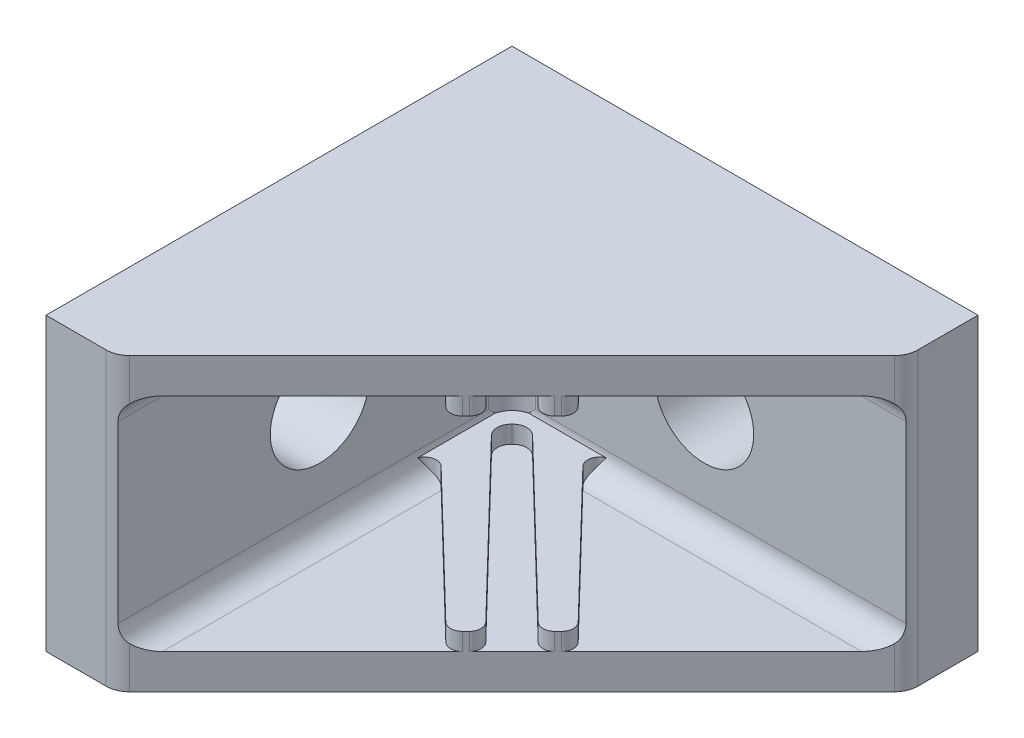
ISO-10303-21;
HEADER;
FILE_DESCRIPTION(('STEP AP214'),'2;1');
FILE_NAME('part.step','',(''),(''),'','','');
FILE_SCHEMA(('AUTOMOTIVE_DESIGN { 1 0 10303 214 1 1 1 1 }'));
ENDSEC;
DATA;
#1=APPLICATION_CONTEXT('core data for automotive mechanical design processes');
#2=APPLICATION_PROTOCOL_DEFINITION('international standard','automotive_design',2000,#1);
#3=PRODUCT_CONTEXT('',#1,'mechanical');
#4=PRODUCT('Part','Part','',(#3));
#5=PRODUCT_RELATED_PRODUCT_CATEGORY('part','',(#4));
#6=PRODUCT_DEFINITION_FORMATION('','',#4);
#7=PRODUCT_DEFINITION_CONTEXT('part definition',#1,'design');
#8=PRODUCT_DEFINITION('design','',#6,#7);
#9=PRODUCT_DEFINITION_SHAPE('','',#8);
#10=(LENGTH_UNIT() NAMED_UNIT(*) SI_UNIT(.MILLI.,.METRE.));
#11=(NAMED_UNIT(*) PLANE_ANGLE_UNIT() SI_UNIT($,.RADIAN.));
#12=(NAMED_UNIT(*) SI_UNIT($,.STERADIAN.) SOLID_ANGLE_UNIT());
#13=UNCERTAINTY_MEASURE_WITH_UNIT(LENGTH_MEASURE(1.E-05),#10,'distance_accuracy_value','');
#14=(GEOMETRIC_REPRESENTATION_CONTEXT(3) GLOBAL_UNCERTAINTY_ASSIGNED_CONTEXT((#13)) GLOBAL_UNIT_ASSIGNED_CONTEXT((#10,
#11,#12)) REPRESENTATION_CONTEXT('',''));
#15=CARTESIAN_POINT('',(0.,0.,0.));
#16=DIRECTION('',(0.,0.,1.));
#17=DIRECTION('',(1.,0.,0.));
#18=AXIS2_PLACEMENT_3D('',#15,#16,#17);
#19=CARTESIAN_POINT('',(8.48309778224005,-6.375,8.4830977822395));
#20=DIRECTION('',(0.,1.,0.));
#21=DIRECTION('',(0.,0.,1.));
#22=AXIS2_PLACEMENT_3D('',#19,#20,#21);
#23=CYLINDRICAL_SURFACE('',#22,1.25);
#24=CARTESIAN_POINT('',(8.48309778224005,-8.,8.4830977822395));
#25=DIRECTION('',(0.,1.,0.));
#26=DIRECTION('',(0.,0.,1.));
#27=AXIS2_PLACEMENT_3D('',#24,#25,#26);
#28=CIRCLE('',#27,1.25);
#29=CARTESIAN_POINT('',(7.59921430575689,-8.,9.36698125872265));
#30=VERTEX_POINT('',#29);
#31=CARTESIAN_POINT('',(7.56365523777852,-8.,9.32993035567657));
#32=VERTEX_POINT('',#31);
#33=EDGE_CURVE('E289',#30,#32,#28,.F.);
#34=ORIENTED_EDGE('',*,*,#33,.F.);
#35=DIRECTION('',(0.,1.,0.));
#36=VECTOR('',#35,1.);
#37=CARTESIAN_POINT('',(7.59921430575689,-7.5,9.36698125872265));
#38=LINE('',#37,#36);
#39=CARTESIAN_POINT('',(7.59921430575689,-9.5,9.36698125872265));
#40=VERTEX_POINT('',#39);
#41=EDGE_CURVE('E287',#30,#40,#38,.F.);
#42=ORIENTED_EDGE('',*,*,#41,.T.);
#43=CARTESIAN_POINT('',(8.48309778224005,-9.5,8.4830977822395));
#44=DIRECTION('',(0.,-1.,0.));
#45=DIRECTION('',(0.,0.,-1.));
#46=AXIS2_PLACEMENT_3D('',#43,#44,#45);
#47=CIRCLE('',#46,1.25);
#48=CARTESIAN_POINT('',(7.56365523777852,-9.5,9.32993035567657));
#49=VERTEX_POINT('',#48);
#50=EDGE_CURVE('E18',#49,#40,#47,.F.);
#51=ORIENTED_EDGE('',*,*,#50,.F.);
#52=DIRECTION('',(0.,1.,0.));
#53=VECTOR('',#52,1.);
#54=CARTESIAN_POINT('',(7.56365523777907,-6.25,9.32993035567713));
#55=LINE('',#54,#53);
#56=EDGE_CURVE('E279',#49,#32,#55,.T.);
#57=ORIENTED_EDGE('',*,*,#56,.T.);
#58=EDGE_LOOP('',(#34,#42,#51,#57));
#59=FACE_BOUND('',#58,.T.);
#60=ADVANCED_FACE('F15',(#59),#23,.F.);
#61=CARTESIAN_POINT('',(8.48309778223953,-8.75,8.48309778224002));
#62=DIRECTION('',(0.,-1.,0.));
#63=DIRECTION('',(0.,0.,-1.));
#64=AXIS2_PLACEMENT_3D('',#61,#62,#63);
#65=CYLINDRICAL_SURFACE('',#64,1.24999999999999);
#66=CARTESIAN_POINT('',(8.48309778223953,-9.5,8.48309778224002));
#67=DIRECTION('',(0.,-1.,0.));
#68=DIRECTION('',(0.,0.,-1.));
#69=AXIS2_PLACEMENT_3D('',#66,#67,#68);
#70=CIRCLE('',#69,1.24999999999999);
#71=CARTESIAN_POINT('',(9.36698125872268,-9.5,7.59921430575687));
#72=VERTEX_POINT('',#71);
#73=CARTESIAN_POINT('',(9.32993035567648,-9.5,7.56365523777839));
#74=VERTEX_POINT('',#73);
#75=EDGE_CURVE('E913',#72,#74,#70,.F.);
#76=ORIENTED_EDGE('',*,*,#75,.F.);
#77=DIRECTION('',(0.,1.,0.));
#78=VECTOR('',#77,1.);
#79=CARTESIAN_POINT('',(9.36698125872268,-8.75,7.59921430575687));
#80=LINE('',#79,#78);
#81=CARTESIAN_POINT('',(9.36698125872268,-8.,7.59921430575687));
#82=VERTEX_POINT('',#81);
#83=EDGE_CURVE('E901',#72,#82,#80,.T.);
#84=ORIENTED_EDGE('',*,*,#83,.T.);
#85=CARTESIAN_POINT('',(8.48309778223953,-8.,8.48309778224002));
#86=DIRECTION('',(0.,1.,0.));
#87=DIRECTION('',(0.,0.,1.));
#88=AXIS2_PLACEMENT_3D('',#85,#86,#87);
#89=CIRCLE('',#88,1.24999999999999);
#90=CARTESIAN_POINT('',(9.32993035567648,-8.,7.56365523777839));
#91=VERTEX_POINT('',#90);
#92=EDGE_CURVE('E922',#91,#82,#89,.F.);
#93=ORIENTED_EDGE('',*,*,#92,.F.);
#94=DIRECTION('',(0.,1.,0.));
#95=VECTOR('',#94,1.);
#96=CARTESIAN_POINT('',(9.32993035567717,-8.75,7.56365523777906));
#97=LINE('',#96,#95);
#98=EDGE_CURVE('E297',#91,#74,#97,.F.);
#99=ORIENTED_EDGE('',*,*,#98,.T.);
#100=EDGE_LOOP('',(#76,#84,#93,#99));
#101=FACE_BOUND('',#100,.T.);
#102=ADVANCED_FACE('F920',(#101),#65,.F.);
#103=CARTESIAN_POINT('',(6.71533082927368,-7.5,8.48309778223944));
#104=DIRECTION('',(-0.707106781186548,0.,0.707106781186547));
#105=DIRECTION('',(0.707106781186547,0.,0.707106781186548));
#106=AXIS2_PLACEMENT_3D('',#103,#104,#105);
#107=PLANE('',#106);
#108=DIRECTION('',(0.707106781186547,0.,0.707106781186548));
#109=VECTOR('',#108,1.);
#110=CARTESIAN_POINT('',(6.71533082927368,-9.5,8.48309778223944));
#111=LINE('',#110,#109);
#112=CARTESIAN_POINT('',(7.60564290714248,-9.5,9.37340986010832));
#113=VERTEX_POINT('',#112);
#114=EDGE_CURVE('E300',#40,#113,#111,.T.);
#115=ORIENTED_EDGE('',*,*,#114,.F.);
#116=ORIENTED_EDGE('',*,*,#41,.F.);
#117=DIRECTION('',(0.707106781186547,0.,0.707106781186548));
#118=VECTOR('',#117,1.);
#119=CARTESIAN_POINT('',(6.71533082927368,-8.,8.48309778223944));
#120=LINE('',#119,#118);
#121=CARTESIAN_POINT('',(7.60564290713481,-8.,9.37340986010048));
#122=VERTEX_POINT('',#121);
#123=EDGE_CURVE('E301',#122,#30,#120,.F.);
#124=ORIENTED_EDGE('',*,*,#123,.F.);
#125=DIRECTION('',(0.,1.,0.));
#126=VECTOR('',#125,1.);
#127=CARTESIAN_POINT('',(7.60564290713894,-6.25,9.3734098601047));
#128=LINE('',#127,#126);
#129=EDGE_CURVE('E885',#122,#113,#128,.F.);
#130=ORIENTED_EDGE('',*,*,#129,.T.);
#131=EDGE_LOOP('',(#115,#116,#124,#130));
#132=FACE_BOUND('',#131,.T.);
#133=ADVANCED_FACE('F1709',(#132),#107,.F.);
#134=CARTESIAN_POINT('',(23.2662589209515,-6.25,25.5904524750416));
#135=DIRECTION('',(-0.719339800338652,0.,0.694658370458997));
#136=DIRECTION('',(0.694658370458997,0.,0.719339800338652));
#137=AXIS2_PLACEMENT_3D('',#134,#135,#136);
#138=PLANE('',#137);
#139=DIRECTION('',(0.694658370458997,0.,0.719339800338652));
#140=VECTOR('',#139,1.);
#141=CARTESIAN_POINT('',(23.2662589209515,-9.5,25.5904524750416));
#142=LINE('',#141,#140);
#143=CARTESIAN_POINT('',(7.54877658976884,-9.5,9.31452306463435));
#144=VERTEX_POINT('',#143);
#145=EDGE_CURVE('E267',#144,#49,#142,.T.);
#146=ORIENTED_EDGE('',*,*,#145,.F.);
#147=DIRECTION('',(0.,-1.,0.));
#148=VECTOR('',#147,1.);
#149=CARTESIAN_POINT('',(7.54877658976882,-6.25,9.31452306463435));
#150=LINE('',#149,#148);
#151=CARTESIAN_POINT('',(7.54877658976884,-8.,9.31452306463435));
#152=VERTEX_POINT('',#151);
#153=EDGE_CURVE('E876',#144,#152,#150,.F.);
#154=ORIENTED_EDGE('',*,*,#153,.T.);
#155=DIRECTION('',(0.694658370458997,0.,0.719339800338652));
#156=VECTOR('',#155,1.);
#157=CARTESIAN_POINT('',(23.2662589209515,-8.,25.5904524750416));
#158=LINE('',#157,#156);
#159=EDGE_CURVE('E280',#32,#152,#158,.F.);
#160=ORIENTED_EDGE('',*,*,#159,.F.);
#161=ORIENTED_EDGE('',*,*,#56,.F.);
#162=EDGE_LOOP('',(#146,#154,#160,#161));
#163=FACE_BOUND('',#162,.T.);
#164=ADVANCED_FACE('F290',(#163),#138,.F.);
#165=CARTESIAN_POINT('',(9.32993035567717,-8.75,7.56365523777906));
#166=DIRECTION('',(0.694658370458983,0.,-0.719339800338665));
#167=DIRECTION('',(-0.719339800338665,0.,-0.694658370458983));
#168=AXIS2_PLACEMENT_3D('',#165,#166,#167);
#169=PLANE('',#168);
#170=DIRECTION('',(-0.719339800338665,0.,-0.694658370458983));
#171=VECTOR('',#170,1.);
#172=CARTESIAN_POINT('',(9.32993035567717,-8.,7.56365523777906));
#173=LINE('',#172,#171);
#174=CARTESIAN_POINT('',(9.31452306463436,-8.,7.54877658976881));
#175=VERTEX_POINT('',#174);
#176=EDGE_CURVE('E293',#175,#91,#173,.F.);
#177=ORIENTED_EDGE('',*,*,#176,.F.);
#178=DIRECTION('',(0.,1.,0.));
#179=VECTOR('',#178,1.);
#180=CARTESIAN_POINT('',(9.31452306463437,-8.75,7.54877658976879));
#181=LINE('',#180,#179);
#182=CARTESIAN_POINT('',(9.31452306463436,-9.5,7.54877658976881));
#183=VERTEX_POINT('',#182);
#184=EDGE_CURVE('E873',#175,#183,#181,.F.);
#185=ORIENTED_EDGE('',*,*,#184,.T.);
#186=DIRECTION('',(-0.719339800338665,0.,-0.694658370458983));
#187=VECTOR('',#186,1.);
#188=CARTESIAN_POINT('',(9.32993035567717,-9.5,7.56365523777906));
#189=LINE('',#188,#187);
#190=EDGE_CURVE('E291',#74,#183,#189,.T.);
#191=ORIENTED_EDGE('',*,*,#190,.F.);
#192=ORIENTED_EDGE('',*,*,#98,.F.);
#193=EDGE_LOOP('',(#177,#185,#191,#192));
#194=FACE_BOUND('',#193,.T.);
#195=ADVANCED_FACE('F1694',(#194),#169,.F.);
#196=CARTESIAN_POINT('',(7.59819980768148,-6.25,7.59766128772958));
#197=DIRECTION('',(-0.707106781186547,0.,-0.707106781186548));
#198=DIRECTION('',(-0.707106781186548,0.,0.707106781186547));
#199=AXIS2_PLACEMENT_3D('',#196,#197,#198);
#200=PLANE('',#199);
#201=DIRECTION('',(0.,1.,0.));
#202=VECTOR('',#201,1.);
#203=CARTESIAN_POINT('',(7.63240488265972,-8.75,7.56345621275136));
#204=LINE('',#203,#202);
#205=CARTESIAN_POINT('',(7.63240488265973,-9.5,7.56345621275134));
#206=VERTEX_POINT('',#205);
#207=CARTESIAN_POINT('',(7.63240488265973,-8.,7.56345621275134));
#208=VERTEX_POINT('',#207);
#209=EDGE_CURVE('E872',#206,#208,#204,.T.);
#210=ORIENTED_EDGE('',*,*,#209,.T.);
#211=DIRECTION('',(-0.707106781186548,0.,0.707106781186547));
#212=VECTOR('',#211,1.);
#213=CARTESIAN_POINT('',(7.59819980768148,-8.,7.59766128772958));
#214=LINE('',#213,#212);
#215=CARTESIAN_POINT('',(7.56345621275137,-8.,7.6324048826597));
#216=VERTEX_POINT('',#215);
#217=EDGE_CURVE('E908',#216,#208,#214,.F.);
#218=ORIENTED_EDGE('',*,*,#217,.F.);
#219=DIRECTION('',(0.,-1.,0.));
#220=VECTOR('',#219,1.);
#221=CARTESIAN_POINT('',(7.56345621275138,-6.25,7.63240488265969));
#222=LINE('',#221,#220);
#223=CARTESIAN_POINT('',(7.56345621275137,-9.5,7.6324048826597));
#224=VERTEX_POINT('',#223);
#225=EDGE_CURVE('E879',#216,#224,#222,.T.);
#226=ORIENTED_EDGE('',*,*,#225,.T.);
#227=DIRECTION('',(-0.707106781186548,0.,0.707106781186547));
#228=VECTOR('',#227,1.);
#229=CARTESIAN_POINT('',(7.59819980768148,-9.5,7.59766128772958));
#230=LINE('',#229,#228);
#231=EDGE_CURVE('E902',#206,#224,#230,.T.);
#232=ORIENTED_EDGE('',*,*,#231,.F.);
#233=EDGE_LOOP('',(#210,#218,#226,#232));
#234=FACE_BOUND('',#233,.T.);
#235=ADVANCED_FACE('F1687',(#234),#200,.F.);
#236=CARTESIAN_POINT('',(9.36698125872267,-8.75,7.59921430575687));
#237=DIRECTION('',(0.707106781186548,0.,-0.707106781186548));
#238=DIRECTION('',(-0.707106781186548,0.,-0.707106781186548));
#239=AXIS2_PLACEMENT_3D('',#236,#237,#238);
#240=PLANE('',#239);
#241=DIRECTION('',(-0.707106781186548,0.,-0.707106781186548));
#242=VECTOR('',#241,1.);
#243=CARTESIAN_POINT('',(9.36698125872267,-8.,7.59921430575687));
#244=LINE('',#243,#242);
#245=CARTESIAN_POINT('',(9.37340986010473,-8.,7.60564290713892));
#246=VERTEX_POINT('',#245);
#247=EDGE_CURVE('E903',#82,#246,#244,.F.);
#248=ORIENTED_EDGE('',*,*,#247,.F.);
#249=ORIENTED_EDGE('',*,*,#83,.F.);
#250=DIRECTION('',(-0.707106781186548,0.,-0.707106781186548));
#251=VECTOR('',#250,1.);
#252=CARTESIAN_POINT('',(9.36698125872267,-9.5,7.59921430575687));
#253=LINE('',#252,#251);
#254=CARTESIAN_POINT('',(9.37340986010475,-9.5,7.60564290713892));
#255=VERTEX_POINT('',#254);
#256=EDGE_CURVE('E899',#255,#72,#253,.T.);
#257=ORIENTED_EDGE('',*,*,#256,.F.);
#258=DIRECTION('',(0.,1.,0.));
#259=VECTOR('',#258,1.);
#260=CARTESIAN_POINT('',(9.37340986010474,-8.75,7.60564290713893));
#261=LINE('',#260,#259);
#262=EDGE_CURVE('E869',#255,#246,#261,.T.);
#263=ORIENTED_EDGE('',*,*,#262,.T.);
#264=EDGE_LOOP('',(#248,#249,#257,#263));
#265=FACE_BOUND('',#264,.T.);
#266=ADVANCED_FACE('F926',(#265),#240,.F.);
#267=CARTESIAN_POINT('',(8.48309778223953,6.375,8.48309778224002));
#268=DIRECTION('',(0.,-1.,0.));
#269=DIRECTION('',(0.,0.,-1.));
#270=AXIS2_PLACEMENT_3D('',#267,#268,#269);
#271=CYLINDRICAL_SURFACE('',#270,1.25);
#272=CARTESIAN_POINT('',(8.48309778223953,8.,8.48309778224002));
#273=DIRECTION('',(0.,-1.,0.));
#274=DIRECTION('',(0.,0.,-1.));
#275=AXIS2_PLACEMENT_3D('',#272,#273,#274);
#276=CIRCLE('',#275,1.25);
#277=CARTESIAN_POINT('',(9.36698125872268,8.,7.59921430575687));
#278=VERTEX_POINT('',#277);
#279=CARTESIAN_POINT('',(9.32993035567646,8.,7.56365523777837));
#280=VERTEX_POINT('',#279);
#281=EDGE_CURVE('E1774',#278,#280,#276,.F.);
#282=ORIENTED_EDGE('',*,*,#281,.F.);
#283=DIRECTION('',(0.,1.,0.));
#284=VECTOR('',#283,1.);
#285=CARTESIAN_POINT('',(9.36698125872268,7.5,7.59921430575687));
#286=LINE('',#285,#284);
#287=CARTESIAN_POINT('',(9.36698125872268,9.5,7.59921430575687));
#288=VERTEX_POINT('',#287);
#289=EDGE_CURVE('E843',#278,#288,#286,.T.);
#290=ORIENTED_EDGE('',*,*,#289,.T.);
#291=CARTESIAN_POINT('',(8.48309778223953,9.5,8.48309778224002));
#292=DIRECTION('',(0.,1.,0.));
#293=DIRECTION('',(0.,0.,1.));
#294=AXIS2_PLACEMENT_3D('',#291,#292,#293);
#295=CIRCLE('',#294,1.25);
#296=CARTESIAN_POINT('',(9.32993035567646,9.5,7.56365523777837));
#297=VERTEX_POINT('',#296);
#298=EDGE_CURVE('E906',#297,#288,#295,.F.);
#299=ORIENTED_EDGE('',*,*,#298,.F.);
#300=DIRECTION('',(0.,1.,0.));
#301=VECTOR('',#300,1.);
#302=CARTESIAN_POINT('',(9.32993035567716,6.25,7.56365523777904));
#303=LINE('',#302,#301);
#304=EDGE_CURVE('E835',#297,#280,#303,.F.);
#305=ORIENTED_EDGE('',*,*,#304,.T.);
#306=EDGE_LOOP('',(#282,#290,#299,#305));
#307=FACE_BOUND('',#306,.T.);
#308=ADVANCED_FACE('F1672',(#307),#271,.F.);
#309=CARTESIAN_POINT('',(8.48309778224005,8.75,8.4830977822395));
#310=DIRECTION('',(0.,1.,0.));
#311=DIRECTION('',(0.,0.,1.));
#312=AXIS2_PLACEMENT_3D('',#309,#310,#311);
#313=CYLINDRICAL_SURFACE('',#312,1.25);
#314=CARTESIAN_POINT('',(8.48309778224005,9.5,8.4830977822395));
#315=DIRECTION('',(0.,1.,0.));
#316=DIRECTION('',(0.,0.,1.));
#317=AXIS2_PLACEMENT_3D('',#314,#315,#316);
#318=CIRCLE('',#317,1.25);
#319=CARTESIAN_POINT('',(7.59921430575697,9.5,9.36698125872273));
#320=VERTEX_POINT('',#319);
#321=CARTESIAN_POINT('',(7.56365523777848,9.5,9.32993035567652));
#322=VERTEX_POINT('',#321);
#323=EDGE_CURVE('E1770',#320,#322,#318,.F.);
#324=ORIENTED_EDGE('',*,*,#323,.F.);
#325=DIRECTION('',(0.,1.,0.));
#326=VECTOR('',#325,1.);
#327=CARTESIAN_POINT('',(7.59921430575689,8.75,9.36698125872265));
#328=LINE('',#327,#326);
#329=CARTESIAN_POINT('',(7.59921430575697,8.,9.36698125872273));
#330=VERTEX_POINT('',#329);
#331=EDGE_CURVE('E821',#320,#330,#328,.F.);
#332=ORIENTED_EDGE('',*,*,#331,.T.);
#333=CARTESIAN_POINT('',(8.48309778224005,8.,8.4830977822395));
#334=DIRECTION('',(0.,-1.,0.));
#335=DIRECTION('',(0.,0.,-1.));
#336=AXIS2_PLACEMENT_3D('',#333,#334,#335);
#337=CIRCLE('',#336,1.25);
#338=CARTESIAN_POINT('',(7.56365523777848,8.,9.32993035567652));
#339=VERTEX_POINT('',#338);
#340=EDGE_CURVE('E1772',#339,#330,#337,.F.);
#341=ORIENTED_EDGE('',*,*,#340,.F.);
#342=DIRECTION('',(0.,1.,0.));
#343=VECTOR('',#342,1.);
#344=CARTESIAN_POINT('',(7.56365523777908,8.75,9.32993035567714));
#345=LINE('',#344,#343);
#346=EDGE_CURVE('E829',#339,#322,#345,.T.);
#347=ORIENTED_EDGE('',*,*,#346,.T.);
#348=EDGE_LOOP('',(#324,#332,#341,#347));
#349=FACE_BOUND('',#348,.T.);
#350=ADVANCED_FACE('F1664',(#349),#313,.F.);
#351=CARTESIAN_POINT('',(25.145788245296,-8.75,19.4646796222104));
#352=DIRECTION('',(0.719339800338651,0.,-0.694658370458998));
#353=DIRECTION('',(-0.694658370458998,0.,-0.719339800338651));
#354=AXIS2_PLACEMENT_3D('',#351,#352,#353);
#355=PLANE('',#354);
#356=DIRECTION('',(0.,1.,0.));
#357=VECTOR('',#356,1.);
#358=CARTESIAN_POINT('',(25.1457882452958,-8.75,19.4646796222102));
#359=LINE('',#358,#357);
#360=CARTESIAN_POINT('',(25.1457882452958,-8.,19.4646796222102));
#361=VERTEX_POINT('',#360);
#362=CARTESIAN_POINT('',(25.1457882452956,-9.5,19.4646796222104));
#363=VERTEX_POINT('',#362);
#364=EDGE_CURVE('E888',#361,#363,#359,.F.);
#365=ORIENTED_EDGE('',*,*,#364,.T.);
#366=DIRECTION('',(-0.694658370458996,0.,-0.719339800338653));
#367=VECTOR('',#366,1.);
#368=CARTESIAN_POINT('',(25.1457882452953,-9.5,19.4646796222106));
#369=LINE('',#368,#367);
#370=CARTESIAN_POINT('',(14.0744758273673,-9.50000000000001,7.99999999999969));
#371=VERTEX_POINT('',#370);
#372=EDGE_CURVE('E766',#363,#371,#369,.T.);
#373=ORIENTED_EDGE('',*,*,#372,.T.);
#374=CARTESIAN_POINT('',(14.0744758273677,-7.50000000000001,7.9999999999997));
#375=DIRECTION('',(0.719339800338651,0.,-0.694658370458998));
#376=DIRECTION('',(-0.694658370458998,0.,-0.719339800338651));
#377=AXIS2_PLACEMENT_3D('',#374,#375,#376);
#378=ELLIPSE('',#377,2.78032718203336,2.);
#379=CARTESIAN_POINT('',(13.7796108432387,-9.47655419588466,7.6946583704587));
#380=VERTEX_POINT('',#379);
#381=EDGE_CURVE('E890',#371,#380,#378,.T.);
#382=ORIENTED_EDGE('',*,*,#381,.T.);
#383=DIRECTION('',(0.,-1.,0.));
#384=VECTOR('',#383,1.);
#385=CARTESIAN_POINT('',(13.7796108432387,-8.73827709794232,7.6946583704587));
#386=LINE('',#385,#384);
#387=CARTESIAN_POINT('',(13.7796108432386,-8.,7.69465837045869));
#388=VERTEX_POINT('',#387);
#389=EDGE_CURVE('E816',#380,#388,#386,.F.);
#390=ORIENTED_EDGE('',*,*,#389,.T.);
#391=DIRECTION('',(-0.694658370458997,0.,-0.719339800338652));
#392=VECTOR('',#391,1.);
#393=CARTESIAN_POINT('',(25.1457882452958,-8.,19.4646796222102));
#394=LINE('',#393,#392);
#395=EDGE_CURVE('E807',#361,#388,#394,.T.);
#396=ORIENTED_EDGE('',*,*,#395,.F.);
#397=EDGE_LOOP('',(#365,#373,#382,#390,#396));
#398=FACE_BOUND('',#397,.T.);
#399=ADVANCED_FACE('F1656',(#398),#355,.T.);
#400=CARTESIAN_POINT('',(23.2662589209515,-6.25,25.5904524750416));
#401=DIRECTION('',(-0.719339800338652,0.,0.694658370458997));
#402=DIRECTION('',(0.694658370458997,0.,0.719339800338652));
#403=AXIS2_PLACEMENT_3D('',#400,#401,#402);
#404=PLANE('',#403);
#405=DIRECTION('',(-0.694658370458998,0.,-0.71933980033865));
#406=VECTOR('',#405,1.);
#407=CARTESIAN_POINT('',(21.1801963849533,-9.5,23.4302714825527));
#408=LINE('',#407,#406);
#409=CARTESIAN_POINT('',(21.1801963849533,-9.5,23.4302714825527));
#410=VERTEX_POINT('',#409);
#411=EDGE_CURVE('E754',#410,#113,#408,.T.);
#412=ORIENTED_EDGE('',*,*,#411,.T.);
#413=ORIENTED_EDGE('',*,*,#129,.F.);
#414=DIRECTION('',(-0.694658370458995,0.,-0.719339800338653));
#415=VECTOR('',#414,1.);
#416=CARTESIAN_POINT('',(21.1801963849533,-8.,23.4302714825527));
#417=LINE('',#416,#415);
#418=CARTESIAN_POINT('',(21.1801963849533,-8.,23.4302714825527));
#419=VERTEX_POINT('',#418);
#420=EDGE_CURVE('E797',#419,#122,#417,.T.);
#421=ORIENTED_EDGE('',*,*,#420,.F.);
#422=DIRECTION('',(0.,1.,0.));
#423=VECTOR('',#422,1.);
#424=CARTESIAN_POINT('',(21.1801963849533,-6.25,23.4302714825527));
#425=LINE('',#424,#423);
#426=EDGE_CURVE('E882',#410,#419,#425,.T.);
#427=ORIENTED_EDGE('',*,*,#426,.F.);
#428=EDGE_LOOP('',(#412,#413,#421,#427));
#429=FACE_BOUND('',#428,.T.);
#430=ADVANCED_FACE('F1648',(#429),#404,.F.);
#431=CARTESIAN_POINT('',(8.41198435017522,-6.25,8.48093302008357));
#432=DIRECTION('',(0.,-1.,0.));
#433=DIRECTION('',(0.,0.,-1.));
#434=AXIS2_PLACEMENT_3D('',#431,#432,#433);
#435=CYLINDRICAL_SURFACE('',#434,1.2);
#436=ORIENTED_EDGE('',*,*,#153,.F.);
#437=CARTESIAN_POINT('',(8.41198435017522,-9.5,8.48093302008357));
#438=DIRECTION('',(0.,-1.,0.));
#439=DIRECTION('',(0.,0.,-1.));
#440=AXIS2_PLACEMENT_3D('',#437,#438,#439);
#441=CIRCLE('',#440,1.2);
#442=EDGE_CURVE('E274',#144,#224,#441,.T.);
#443=ORIENTED_EDGE('',*,*,#442,.T.);
#444=ORIENTED_EDGE('',*,*,#225,.F.);
#445=CARTESIAN_POINT('',(8.41198435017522,-8.,8.48093302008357));
#446=DIRECTION('',(0.,-1.,0.));
#447=DIRECTION('',(0.,0.,-1.));
#448=AXIS2_PLACEMENT_3D('',#445,#446,#447);
#449=CIRCLE('',#448,1.2);
#450=EDGE_CURVE('E796',#152,#216,#449,.T.);
#451=ORIENTED_EDGE('',*,*,#450,.F.);
#452=EDGE_LOOP('',(#436,#443,#444,#451));
#453=FACE_BOUND('',#452,.T.);
#454=ADVANCED_FACE('F1640',(#453),#435,.F.);
#455=CARTESIAN_POINT('',(8.4809330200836,-8.75,8.41198435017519));
#456=DIRECTION('',(0.,1.,0.));
#457=DIRECTION('',(0.,0.,1.));
#458=AXIS2_PLACEMENT_3D('',#455,#456,#457);
#459=CYLINDRICAL_SURFACE('',#458,1.2);
#460=ORIENTED_EDGE('',*,*,#209,.F.);
#461=CARTESIAN_POINT('',(8.4809330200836,-9.5,8.41198435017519));
#462=DIRECTION('',(0.,1.,0.));
#463=DIRECTION('',(0.,0.,1.));
#464=AXIS2_PLACEMENT_3D('',#461,#462,#463);
#465=CIRCLE('',#464,1.2);
#466=EDGE_CURVE('E753',#206,#183,#465,.F.);
#467=ORIENTED_EDGE('',*,*,#466,.T.);
#468=ORIENTED_EDGE('',*,*,#184,.F.);
#469=CARTESIAN_POINT('',(8.4809330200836,-8.,8.41198435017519));
#470=DIRECTION('',(0.,1.,0.));
#471=DIRECTION('',(0.,0.,1.));
#472=AXIS2_PLACEMENT_3D('',#469,#470,#471);
#473=CIRCLE('',#472,1.2);
#474=EDGE_CURVE('E815',#208,#175,#473,.F.);
#475=ORIENTED_EDGE('',*,*,#474,.F.);
#476=EDGE_LOOP('',(#460,#467,#468,#475));
#477=FACE_BOUND('',#476,.T.);
#478=ADVANCED_FACE('F1632',(#477),#459,.F.);
#479=CARTESIAN_POINT('',(23.4302714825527,-8.75,21.1801963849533));
#480=DIRECTION('',(0.694658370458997,0.,-0.719339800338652));
#481=DIRECTION('',(-0.719339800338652,0.,-0.694658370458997));
#482=AXIS2_PLACEMENT_3D('',#479,#480,#481);
#483=PLANE('',#482);
#484=DIRECTION('',(0.719339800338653,0.,0.694658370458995));
#485=VECTOR('',#484,1.);
#486=CARTESIAN_POINT('',(9.37340986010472,-8.,7.60564290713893));
#487=LINE('',#486,#485);
#488=CARTESIAN_POINT('',(23.4302714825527,-8.,21.1801963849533));
#489=VERTEX_POINT('',#488);
#490=EDGE_CURVE('E813',#246,#489,#487,.T.);
#491=ORIENTED_EDGE('',*,*,#490,.F.);
#492=ORIENTED_EDGE('',*,*,#262,.F.);
#493=DIRECTION('',(0.719339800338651,0.,0.694658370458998));
#494=VECTOR('',#493,1.);
#495=CARTESIAN_POINT('',(9.37340986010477,-9.5,7.6056429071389));
#496=LINE('',#495,#494);
#497=CARTESIAN_POINT('',(23.4302714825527,-9.5,21.1801963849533));
#498=VERTEX_POINT('',#497);
#499=EDGE_CURVE('E750',#255,#498,#496,.T.);
#500=ORIENTED_EDGE('',*,*,#499,.T.);
#501=DIRECTION('',(0.,-1.,0.));
#502=VECTOR('',#501,1.);
#503=CARTESIAN_POINT('',(23.4302714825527,-8.75,21.1801963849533));
#504=LINE('',#503,#502);
#505=EDGE_CURVE('E757',#489,#498,#504,.T.);
#506=ORIENTED_EDGE('',*,*,#505,.F.);
#507=EDGE_LOOP('',(#491,#492,#500,#506));
#508=FACE_BOUND('',#507,.T.);
#509=ADVANCED_FACE('F1624',(#508),#483,.F.);
#510=CARTESIAN_POINT('',(21.6102524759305,-6.,27.2177438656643));
#511=DIRECTION('',(-0.694658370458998,0.,0.719339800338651));
#512=DIRECTION('',(0.719339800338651,0.,0.694658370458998));
#513=AXIS2_PLACEMENT_3D('',#510,#511,#512);
#514=PLANE('',#513);
#515=DIRECTION('',(0.719339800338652,0.,0.694658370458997));
#516=VECTOR('',#515,1.);
#517=CARTESIAN_POINT('',(7.69465837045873,-8.,13.7796108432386));
#518=LINE('',#517,#516);
#519=CARTESIAN_POINT('',(7.69465837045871,-8.,13.7796108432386));
#520=VERTEX_POINT('',#519);
#521=CARTESIAN_POINT('',(19.4646796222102,-8.,25.1457882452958));
#522=VERTEX_POINT('',#521);
#523=EDGE_CURVE('E803',#520,#522,#518,.T.);
#524=ORIENTED_EDGE('',*,*,#523,.F.);
#525=DIRECTION('',(0.,1.,0.));
#526=VECTOR('',#525,1.);
#527=CARTESIAN_POINT('',(7.69465837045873,8.25,13.7796108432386));
#528=LINE('',#527,#526);
#529=CARTESIAN_POINT('',(7.69465837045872,-9.47655419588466,13.7796108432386));
#530=VERTEX_POINT('',#529);
#531=EDGE_CURVE('E844',#520,#530,#528,.F.);
#532=ORIENTED_EDGE('',*,*,#531,.T.);
#533=CARTESIAN_POINT('',(7.99999999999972,-7.5,14.0744758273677));
#534=DIRECTION('',(-0.694658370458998,0.,0.719339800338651));
#535=DIRECTION('',(0.719339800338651,0.,0.694658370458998));
#536=AXIS2_PLACEMENT_3D('',#533,#534,#535);
#537=ELLIPSE('',#536,2.78032718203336,2.);
#538=CARTESIAN_POINT('',(7.99999999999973,-9.5,14.0744758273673));
#539=VERTEX_POINT('',#538);
#540=EDGE_CURVE('E861',#530,#539,#537,.T.);
#541=ORIENTED_EDGE('',*,*,#540,.T.);
#542=DIRECTION('',(0.719339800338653,0.,0.694658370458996));
#543=VECTOR('',#542,1.);
#544=CARTESIAN_POINT('',(7.99999999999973,-9.5,14.0744758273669));
#545=LINE('',#544,#543);
#546=CARTESIAN_POINT('',(19.4646796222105,-9.5,25.1457882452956));
#547=VERTEX_POINT('',#546);
#548=EDGE_CURVE('E742',#539,#547,#545,.T.);
#549=ORIENTED_EDGE('',*,*,#548,.T.);
#550=DIRECTION('',(0.,1.,0.));
#551=VECTOR('',#550,1.);
#552=CARTESIAN_POINT('',(19.4646796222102,-6.375,25.1457882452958));
#553=LINE('',#552,#551);
#554=EDGE_CURVE('E745',#522,#547,#553,.F.);
#555=ORIENTED_EDGE('',*,*,#554,.F.);
#556=EDGE_LOOP('',(#524,#532,#541,#549,#555));
#557=FACE_BOUND('',#556,.T.);
#558=ADVANCED_FACE('F1616',(#557),#514,.T.);
#559=CARTESIAN_POINT('',(-1.59099025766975,4.,34.519922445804));
#560=DIRECTION('',(-0.70710678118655,0.,-0.707106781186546));
#561=DIRECTION('',(-0.707106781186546,0.,0.70710678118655));
#562=AXIS2_PLACEMENT_3D('',#559,#560,#561);
#563=PLANE('',#562);
#564=DIRECTION('',(0.,1.,0.));
#565=VECTOR('',#564,1.);
#566=CARTESIAN_POINT('',(-1.94454364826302,4.,34.8734758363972));
#567=LINE('',#566,#565);
#568=CARTESIAN_POINT('',(-1.94454364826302,4.,34.8734758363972));
#569=VERTEX_POINT('',#568);
#570=CARTESIAN_POINT('',(-1.94454364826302,-4.,34.8734758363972));
#571=VERTEX_POINT('',#570);
#572=EDGE_CURVE('E717',#569,#571,#567,.F.);
#573=ORIENTED_EDGE('',*,*,#572,.F.);
#574=DIRECTION('',(-0.707106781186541,0.,0.707106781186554));
#575=VECTOR('',#574,1.);
#576=CARTESIAN_POINT('',(-1.23743686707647,4.,34.1663690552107));
#577=LINE('',#576,#575);
#578=CARTESIAN_POINT('',(-1.23743686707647,4.,34.1663690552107));
#579=VERTEX_POINT('',#578);
#580=EDGE_CURVE('E852',#579,#569,#577,.T.);
#581=ORIENTED_EDGE('',*,*,#580,.F.);
#582=DIRECTION('',(0.,1.,0.));
#583=VECTOR('',#582,1.);
#584=CARTESIAN_POINT('',(-1.23743686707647,4.,34.1663690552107));
#585=LINE('',#584,#583);
#586=CARTESIAN_POINT('',(-1.23743686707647,-4.,34.1663690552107));
#587=VERTEX_POINT('',#586);
#588=EDGE_CURVE('E723',#587,#579,#585,.T.);
#589=ORIENTED_EDGE('',*,*,#588,.F.);
#590=DIRECTION('',(0.707106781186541,0.,-0.707106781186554));
#591=VECTOR('',#590,1.);
#592=CARTESIAN_POINT('',(-1.94454364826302,-4.,34.8734758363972));
#593=LINE('',#592,#591);
#594=EDGE_CURVE('E855',#571,#587,#593,.T.);
#595=ORIENTED_EDGE('',*,*,#594,.F.);
#596=EDGE_LOOP('',(#573,#581,#589,#595));
#597=FACE_BOUND('',#596,.T.);
#598=ADVANCED_FACE('F1609',(#597),#563,.T.);
#599=CARTESIAN_POINT('',(-0.176776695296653,-4.,35.9341360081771));
#600=DIRECTION('',(0.,-1.,0.));
#601=DIRECTION('',(0.,0.,-1.));
#602=AXIS2_PLACEMENT_3D('',#599,#600,#601);
#603=PLANE('',#602);
#604=DIRECTION('',(0.661621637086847,0.,0.749837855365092));
#605=VECTOR('',#604,1.);
#606=CARTESIAN_POINT('',(-0.618718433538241,-4.,36.3760777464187));
#607=LINE('',#606,#605);
#608=CARTESIAN_POINT('',(0.707106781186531,-4.,37.8786796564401));
#609=VERTEX_POINT('',#608);
#610=EDGE_CURVE('E714',#571,#609,#607,.T.);
#611=ORIENTED_EDGE('',*,*,#610,.F.);
#612=ORIENTED_EDGE('',*,*,#594,.T.);
#613=DIRECTION('',(-0.749837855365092,0.,-0.661621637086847));
#614=VECTOR('',#613,1.);
#615=CARTESIAN_POINT('',(0.26516504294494,-4.,35.4921942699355));
#616=LINE('',#615,#614);
#617=CARTESIAN_POINT('',(1.76776695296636,-4.,36.8180194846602));
#618=VERTEX_POINT('',#617);
#619=EDGE_CURVE('E726',#618,#587,#616,.T.);
#620=ORIENTED_EDGE('',*,*,#619,.F.);
#621=DIRECTION('',(-0.707106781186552,0.,0.707106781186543));
#622=VECTOR('',#621,1.);
#623=CARTESIAN_POINT('',(1.76776695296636,-4.,36.8180194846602));
#624=LINE('',#623,#622);
#625=EDGE_CURVE('E858',#618,#609,#624,.T.);
#626=ORIENTED_EDGE('',*,*,#625,.T.);
#627=EDGE_LOOP('',(#611,#612,#620,#626));
#628=FACE_BOUND('',#627,.T.);
#629=ADVANCED_FACE('F1602',(#628),#603,.T.);
#630=CARTESIAN_POINT('',(1.76776695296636,4.,34.1663690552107));
#631=DIRECTION('',(0.,1.,0.));
#632=DIRECTION('',(0.,0.,1.));
#633=AXIS2_PLACEMENT_3D('',#630,#631,#632);
#634=PLANE('',#633);
#635=DIRECTION('',(0.661621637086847,0.,0.749837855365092));
#636=VECTOR('',#635,1.);
#637=CARTESIAN_POINT('',(-0.618718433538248,4.,36.3760777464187));
#638=LINE('',#637,#636);
#639=CARTESIAN_POINT('',(0.707106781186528,4.,37.8786796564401));
#640=VERTEX_POINT('',#639);
#641=EDGE_CURVE('E711',#640,#569,#638,.F.);
#642=ORIENTED_EDGE('',*,*,#641,.F.);
#643=DIRECTION('',(0.707106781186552,0.,-0.707106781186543));
#644=VECTOR('',#643,1.);
#645=CARTESIAN_POINT('',(0.707106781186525,4.,37.8786796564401));
#646=LINE('',#645,#644);
#647=CARTESIAN_POINT('',(1.76776695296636,4.,36.8180194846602));
#648=VERTEX_POINT('',#647);
#649=EDGE_CURVE('E849',#640,#648,#646,.T.);
#650=ORIENTED_EDGE('',*,*,#649,.T.);
#651=DIRECTION('',(-0.749837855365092,0.,-0.661621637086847));
#652=VECTOR('',#651,1.);
#653=CARTESIAN_POINT('',(0.265165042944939,4.,35.4921942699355));
#654=LINE('',#653,#652);
#655=EDGE_CURVE('E720',#579,#648,#654,.F.);
#656=ORIENTED_EDGE('',*,*,#655,.F.);
#657=ORIENTED_EDGE('',*,*,#580,.T.);
#658=EDGE_LOOP('',(#642,#650,#656,#657));
#659=FACE_BOUND('',#658,.T.);
#660=ADVANCED_FACE('F428',(#659),#634,.T.);
#661=CARTESIAN_POINT('',(6.9999999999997,8.25,14.4989506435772));
#662=DIRECTION('',(0.,1.,0.));
#663=DIRECTION('',(0.,0.,1.));
#664=AXIS2_PLACEMENT_3D('',#661,#662,#663);
#665=CYLINDRICAL_SURFACE('',#664,1.);
#666=ORIENTED_EDGE('',*,*,#531,.F.);
#667=CARTESIAN_POINT('',(6.9999999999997,-8.,14.4989506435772));
#668=DIRECTION('',(0.,1.,0.));
#669=DIRECTION('',(0.,0.,1.));
#670=AXIS2_PLACEMENT_3D('',#667,#668,#669);
#671=CIRCLE('',#670,1.);
#672=CARTESIAN_POINT('',(6.06350832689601,-8.,14.148260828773));
#673=VERTEX_POINT('',#672);
#674=EDGE_CURVE('E806',#673,#520,#671,.F.);
#675=ORIENTED_EDGE('',*,*,#674,.F.);
#676=CARTESIAN_POINT('',(6.06350832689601,-8.,14.148260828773));
#677=CARTESIAN_POINT('',(6.07859343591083,-8.05837773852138,14.1080215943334));
#678=CARTESIAN_POINT('',(6.09640000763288,-8.11647725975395,14.0683333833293));
#679=CARTESIAN_POINT('',(6.13774190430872,-8.2319710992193,13.9905549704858));
#680=CARTESIAN_POINT('',(6.16129444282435,-8.28936274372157,13.9524699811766));
#681=CARTESIAN_POINT('',(6.21467308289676,-8.4036786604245,13.8781614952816));
#682=CARTESIAN_POINT('',(6.24457740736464,-8.46058693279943,13.8419689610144));
#683=CARTESIAN_POINT('',(6.31070037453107,-8.57260977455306,13.7729002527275));
#684=CARTESIAN_POINT('',(6.34691001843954,-8.62772676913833,13.7400194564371));
#685=CARTESIAN_POINT('',(6.43131482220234,-8.74297928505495,13.6744323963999));
#686=CARTESIAN_POINT('',(6.48046950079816,-8.80278148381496,13.6423547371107));
#687=CARTESIAN_POINT('',(6.58735947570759,-8.9179488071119,13.5860671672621));
#688=CARTESIAN_POINT('',(6.64505858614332,-8.97333119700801,13.5618253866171));
#689=CARTESIAN_POINT('',(6.75660836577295,-9.06787221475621,13.5276315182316));
#690=CARTESIAN_POINT('',(6.80898474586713,-9.10807960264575,13.5158068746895));
#691=CARTESIAN_POINT('',(6.9183714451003,-9.1835902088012,13.5007652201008));
#692=CARTESIAN_POINT('',(6.97537797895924,-9.21889737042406,13.4975412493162));
#693=CARTESIAN_POINT('',(7.08270186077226,-9.27811083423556,13.5011800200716));
#694=CARTESIAN_POINT('',(7.13256198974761,-9.30293683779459,13.5064596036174));
#695=CARTESIAN_POINT('',(7.23292408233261,-9.3478663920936,13.5251202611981));
#696=CARTESIAN_POINT('',(7.2834258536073,-9.36797132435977,13.5384989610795));
#697=CARTESIAN_POINT('',(7.38338955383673,-9.40331743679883,13.5738368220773));
#698=CARTESIAN_POINT('',(7.43284620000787,-9.41853775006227,13.5958319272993));
#699=CARTESIAN_POINT('',(7.52840383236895,-9.44423308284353,13.6482169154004));
#700=CARTESIAN_POINT('',(7.57450901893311,-9.45471413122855,13.6785960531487));
#701=CARTESIAN_POINT('',(7.63126458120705,-9.46576215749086,13.72319623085));
#702=CARTESIAN_POINT('',(7.6443346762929,-9.46816469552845,13.7340175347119));
#703=CARTESIAN_POINT('',(7.66991584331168,-9.47261538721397,13.7563209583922));
#704=CARTESIAN_POINT('',(7.68242795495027,-9.47466422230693,13.7678017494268));
#705=CARTESIAN_POINT('',(7.69465837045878,-9.4765541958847,13.7796108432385));
#706=B_SPLINE_CURVE_WITH_KNOTS('',3,(#676,#677,#678,#679,#680,#681,#682,#683,#684,#685,#686,
#687,#688,#689,#690,#691,#692,#693,#694,#695,#696,#697,#698,#699,#700,#701,#702,#703,#704,#705),
.UNSPECIFIED.,.F.,.F.,(4,2,2,2,2,2,2,2,2,2,2,2,2,2,4),(0.,0.217468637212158,0.435596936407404,
0.65658584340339,0.877261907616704,1.12787006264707,1.3774457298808,1.57794512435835,
1.77828222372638,1.94541660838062,2.11250202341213,2.28029200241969,2.44786792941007,
2.49926372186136,2.55055936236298),.UNSPECIFIED.);
#707=EDGE_CURVE('E432',#673,#530,#706,.T.);
#708=ORIENTED_EDGE('',*,*,#707,.T.);
#709=EDGE_LOOP('',(#666,#675,#708));
#710=FACE_BOUND('',#709,.T.);
#711=ADVANCED_FACE('F423',(#710),#665,.F.);
#712=CARTESIAN_POINT('',(8.48309778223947,7.5,6.71533082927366));
#713=DIRECTION('',(0.707106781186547,0.,-0.707106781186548));
#714=DIRECTION('',(-0.707106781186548,0.,-0.707106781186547));
#715=AXIS2_PLACEMENT_3D('',#712,#713,#714);
#716=PLANE('',#715);
#717=DIRECTION('',(-0.707106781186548,0.,-0.707106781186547));
#718=VECTOR('',#717,1.);
#719=CARTESIAN_POINT('',(8.48309778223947,9.5,6.71533082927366));
#720=LINE('',#719,#718);
#721=CARTESIAN_POINT('',(9.37340986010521,9.5,7.60564290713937));
#722=VERTEX_POINT('',#721);
#723=EDGE_CURVE('E840',#288,#722,#720,.F.);
#724=ORIENTED_EDGE('',*,*,#723,.F.);
#725=ORIENTED_EDGE('',*,*,#289,.F.);
#726=DIRECTION('',(-0.707106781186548,0.,-0.707106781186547));
#727=VECTOR('',#726,1.);
#728=CARTESIAN_POINT('',(8.48309778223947,8.,6.71533082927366));
#729=LINE('',#728,#727);
#730=CARTESIAN_POINT('',(9.3734098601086,8.,7.60564290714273));
#731=VERTEX_POINT('',#730);
#732=EDGE_CURVE('E841',#731,#278,#729,.T.);
#733=ORIENTED_EDGE('',*,*,#732,.F.);
#734=DIRECTION('',(0.,1.,0.));
#735=VECTOR('',#734,1.);
#736=CARTESIAN_POINT('',(9.37340986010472,6.25,7.60564290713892));
#737=LINE('',#736,#735);
#738=EDGE_CURVE('E694',#731,#722,#737,.T.);
#739=ORIENTED_EDGE('',*,*,#738,.T.);
#740=EDGE_LOOP('',(#724,#725,#733,#739));
#741=FACE_BOUND('',#740,.T.);
#742=ADVANCED_FACE('F419',(#741),#716,.F.);
#743=CARTESIAN_POINT('',(25.5904524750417,6.25,23.2662589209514));
#744=DIRECTION('',(0.694658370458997,0.,-0.719339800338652));
#745=DIRECTION('',(-0.719339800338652,0.,-0.694658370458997));
#746=AXIS2_PLACEMENT_3D('',#743,#744,#745);
#747=PLANE('',#746);
#748=DIRECTION('',(-0.719339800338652,0.,-0.694658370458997));
#749=VECTOR('',#748,1.);
#750=CARTESIAN_POINT('',(25.5904524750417,9.5,23.2662589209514));
#751=LINE('',#750,#749);
#752=CARTESIAN_POINT('',(9.31452306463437,9.5,7.54877658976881));
#753=VERTEX_POINT('',#752);
#754=EDGE_CURVE('E836',#753,#297,#751,.F.);
#755=ORIENTED_EDGE('',*,*,#754,.F.);
#756=DIRECTION('',(0.,1.,0.));
#757=VECTOR('',#756,1.);
#758=CARTESIAN_POINT('',(9.31452306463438,6.25,7.54877658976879));
#759=LINE('',#758,#757);
#760=CARTESIAN_POINT('',(9.31452306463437,8.,7.54877658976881));
#761=VERTEX_POINT('',#760);
#762=EDGE_CURVE('E682',#753,#761,#759,.F.);
#763=ORIENTED_EDGE('',*,*,#762,.T.);
#764=DIRECTION('',(-0.719339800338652,0.,-0.694658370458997));
#765=VECTOR('',#764,1.);
#766=CARTESIAN_POINT('',(25.5904524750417,8.,23.2662589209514));
#767=LINE('',#766,#765);
#768=EDGE_CURVE('E838',#280,#761,#767,.T.);
#769=ORIENTED_EDGE('',*,*,#768,.F.);
#770=ORIENTED_EDGE('',*,*,#304,.F.);
#771=EDGE_LOOP('',(#755,#763,#769,#770));
#772=FACE_BOUND('',#771,.T.);
#773=ADVANCED_FACE('F415',(#772),#747,.F.);
#774=CARTESIAN_POINT('',(7.56365523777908,8.75,9.32993035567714));
#775=DIRECTION('',(-0.71933980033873,0.,0.694658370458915));
#776=DIRECTION('',(0.694658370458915,0.,0.71933980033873));
#777=AXIS2_PLACEMENT_3D('',#774,#775,#776);
#778=PLANE('',#777);
#779=DIRECTION('',(0.694658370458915,0.,0.71933980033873));
#780=VECTOR('',#779,1.);
#781=CARTESIAN_POINT('',(7.56365523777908,8.,9.32993035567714));
#782=LINE('',#781,#780);
#783=CARTESIAN_POINT('',(7.54877658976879,8.,9.31452306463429));
#784=VERTEX_POINT('',#783);
#785=EDGE_CURVE('E830',#784,#339,#782,.T.);
#786=ORIENTED_EDGE('',*,*,#785,.F.);
#787=DIRECTION('',(0.,-1.,0.));
#788=VECTOR('',#787,1.);
#789=CARTESIAN_POINT('',(7.54877658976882,8.75,9.31452306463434));
#790=LINE('',#789,#788);
#791=CARTESIAN_POINT('',(7.54877658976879,9.5,9.31452306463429));
#792=VERTEX_POINT('',#791);
#793=EDGE_CURVE('E679',#784,#792,#790,.F.);
#794=ORIENTED_EDGE('',*,*,#793,.T.);
#795=DIRECTION('',(0.694658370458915,0.,0.71933980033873));
#796=VECTOR('',#795,1.);
#797=CARTESIAN_POINT('',(7.56365523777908,9.5,9.32993035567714));
#798=LINE('',#797,#796);
#799=EDGE_CURVE('E832',#322,#792,#798,.F.);
#800=ORIENTED_EDGE('',*,*,#799,.F.);
#801=ORIENTED_EDGE('',*,*,#346,.F.);
#802=EDGE_LOOP('',(#786,#794,#800,#801));
#803=FACE_BOUND('',#802,.T.);
#804=ADVANCED_FACE('F411',(#803),#778,.F.);
#805=CARTESIAN_POINT('',(7.63240488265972,8.75,7.56345621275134));
#806=DIRECTION('',(-0.70710678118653,0.,-0.707106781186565));
#807=DIRECTION('',(-0.707106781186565,0.,0.70710678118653));
#808=AXIS2_PLACEMENT_3D('',#805,#806,#807);
#809=PLANE('',#808);
#810=DIRECTION('',(0.,-1.,0.));
#811=VECTOR('',#810,1.);
#812=CARTESIAN_POINT('',(7.56345621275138,8.75,7.63240488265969));
#813=LINE('',#812,#811);
#814=CARTESIAN_POINT('',(7.56345621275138,9.5,7.63240488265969));
#815=VERTEX_POINT('',#814);
#816=CARTESIAN_POINT('',(7.56345621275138,8.,7.63240488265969));
#817=VERTEX_POINT('',#816);
#818=EDGE_CURVE('E678',#815,#817,#813,.T.);
#819=ORIENTED_EDGE('',*,*,#818,.T.);
#820=DIRECTION('',(-0.707106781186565,0.,0.70710678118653));
#821=VECTOR('',#820,1.);
#822=CARTESIAN_POINT('',(7.63240488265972,8.,7.56345621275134));
#823=LINE('',#822,#821);
#824=CARTESIAN_POINT('',(7.63240488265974,8.,7.56345621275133));
#825=VERTEX_POINT('',#824);
#826=EDGE_CURVE('E827',#825,#817,#823,.T.);
#827=ORIENTED_EDGE('',*,*,#826,.F.);
#828=DIRECTION('',(0.,1.,0.));
#829=VECTOR('',#828,1.);
#830=CARTESIAN_POINT('',(7.63240488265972,6.25,7.56345621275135));
#831=LINE('',#830,#829);
#832=CARTESIAN_POINT('',(7.63240488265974,9.5,7.56345621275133));
#833=VERTEX_POINT('',#832);
#834=EDGE_CURVE('E685',#825,#833,#831,.T.);
#835=ORIENTED_EDGE('',*,*,#834,.T.);
#836=DIRECTION('',(-0.707106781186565,0.,0.70710678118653));
#837=VECTOR('',#836,1.);
#838=CARTESIAN_POINT('',(7.63240488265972,9.5,7.56345621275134));
#839=LINE('',#838,#837);
#840=EDGE_CURVE('E822',#815,#833,#839,.F.);
#841=ORIENTED_EDGE('',*,*,#840,.F.);
#842=EDGE_LOOP('',(#819,#827,#835,#841));
#843=FACE_BOUND('',#842,.T.);
#844=ADVANCED_FACE('F407',(#843),#809,.F.);
#845=CARTESIAN_POINT('',(7.59921430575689,8.75,9.36698125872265));
#846=DIRECTION('',(-0.707106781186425,0.,0.70710678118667));
#847=DIRECTION('',(0.70710678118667,0.,0.707106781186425));
#848=AXIS2_PLACEMENT_3D('',#845,#846,#847);
#849=PLANE('',#848);
#850=DIRECTION('',(0.70710678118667,0.,0.707106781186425));
#851=VECTOR('',#850,1.);
#852=CARTESIAN_POINT('',(7.59921430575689,8.,9.36698125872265));
#853=LINE('',#852,#851);
#854=CARTESIAN_POINT('',(7.60564290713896,8.,9.3734098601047));
#855=VERTEX_POINT('',#854);
#856=EDGE_CURVE('E818',#330,#855,#853,.T.);
#857=ORIENTED_EDGE('',*,*,#856,.F.);
#858=ORIENTED_EDGE('',*,*,#331,.F.);
#859=DIRECTION('',(0.70710678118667,0.,0.707106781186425));
#860=VECTOR('',#859,1.);
#861=CARTESIAN_POINT('',(7.59921430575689,9.5,9.36698125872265));
#862=LINE('',#861,#860);
#863=CARTESIAN_POINT('',(7.60564290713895,9.5,9.37340986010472));
#864=VERTEX_POINT('',#863);
#865=EDGE_CURVE('E819',#864,#320,#862,.F.);
#866=ORIENTED_EDGE('',*,*,#865,.F.);
#867=DIRECTION('',(0.,1.,0.));
#868=VECTOR('',#867,1.);
#869=CARTESIAN_POINT('',(7.60564290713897,8.75,9.37340986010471));
#870=LINE('',#869,#868);
#871=EDGE_CURVE('E675',#864,#855,#870,.F.);
#872=ORIENTED_EDGE('',*,*,#871,.T.);
#873=EDGE_LOOP('',(#857,#858,#866,#872));
#874=FACE_BOUND('',#873,.T.);
#875=ADVANCED_FACE('F402',(#874),#849,.F.);
#876=CARTESIAN_POINT('',(14.4989506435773,-8.73827709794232,6.99999999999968));
#877=DIRECTION('',(0.,-1.,0.));
#878=DIRECTION('',(0.,0.,-1.));
#879=AXIS2_PLACEMENT_3D('',#876,#877,#878);
#880=CYLINDRICAL_SURFACE('',#879,1.);
#881=CARTESIAN_POINT('',(14.4989506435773,-8.,6.99999999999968));
#882=DIRECTION('',(0.,-1.,0.));
#883=DIRECTION('',(0.,0.,-1.));
#884=AXIS2_PLACEMENT_3D('',#881,#882,#883);
#885=CIRCLE('',#884,1.);
#886=CARTESIAN_POINT('',(14.148260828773,-7.99999999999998,6.06350832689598));
#887=VERTEX_POINT('',#886);
#888=EDGE_CURVE('E810',#388,#887,#885,.T.);
#889=ORIENTED_EDGE('',*,*,#888,.F.);
#890=ORIENTED_EDGE('',*,*,#389,.F.);
#891=CARTESIAN_POINT('',(13.7796108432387,-9.47655419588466,7.6946583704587));
#892=CARTESIAN_POINT('',(13.7613094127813,-9.47362688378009,7.67570845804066));
#893=CARTESIAN_POINT('',(13.7437968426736,-9.47031379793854,7.65607192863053));
#894=CARTESIAN_POINT('',(13.7104426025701,-9.46281657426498,7.61558373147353));
#895=CARTESIAN_POINT('',(13.6946009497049,-9.45863242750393,7.59473205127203));
#896=CARTESIAN_POINT('',(13.6498356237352,-9.44465949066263,7.53075345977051));
#897=CARTESIAN_POINT('',(13.6235320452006,-9.43342957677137,7.48605750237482));
#898=CARTESIAN_POINT('',(13.5784956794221,-9.40664301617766,7.39419141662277));
#899=CARTESIAN_POINT('',(13.5597705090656,-9.39108204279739,7.3470188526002));
#900=CARTESIAN_POINT('',(13.5299315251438,-9.35553504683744,7.25195995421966));
#901=CARTESIAN_POINT('',(13.5188172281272,-9.33554930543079,7.20407366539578));
#902=CARTESIAN_POINT('',(13.5036393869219,-9.29103910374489,7.10836677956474));
#903=CARTESIAN_POINT('',(13.4996934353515,-9.26644612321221,7.06055991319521));
#904=CARTESIAN_POINT('',(13.4983981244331,-9.21343725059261,6.96702742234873));
#905=CARTESIAN_POINT('',(13.5010540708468,-9.18501830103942,6.9213035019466));
#906=CARTESIAN_POINT('',(13.5144475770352,-9.11167027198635,6.81321791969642));
#907=CARTESIAN_POINT('',(13.5282343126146,-9.06498973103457,6.75241853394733));
#908=CARTESIAN_POINT('',(13.564808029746,-8.9665799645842,6.63806325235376));
#909=CARTESIAN_POINT('',(13.5876125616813,-8.91484104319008,6.58452175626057));
#910=CARTESIAN_POINT('',(13.6504014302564,-8.78624249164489,6.46505460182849));
#911=CARTESIAN_POINT('',(13.6936089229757,-8.70761342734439,6.40274308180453));
#912=CARTESIAN_POINT('',(13.788666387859,-8.54568361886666,6.29231326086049));
#913=CARTESIAN_POINT('',(13.8405368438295,-8.46237212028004,6.24422936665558));
#914=CARTESIAN_POINT('',(13.9350992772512,-8.31571064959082,6.17260652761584));
#915=CARTESIAN_POINT('',(13.9765086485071,-8.25301716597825,6.14594426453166));
#916=CARTESIAN_POINT('',(14.0611569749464,-8.12699019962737,6.09964763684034));
#917=CARTESIAN_POINT('',(14.1043805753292,-8.06366459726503,6.07996395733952));
#918=CARTESIAN_POINT('',(14.148260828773,-7.99999999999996,6.06350832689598));
#919=B_SPLINE_CURVE_WITH_KNOTS('',3,(#891,#892,#893,#894,#895,#896,#897,#898,#899,#900,#901,
#902,#903,#904,#905,#906,#907,#908,#909,#910,#911,#912,#913,#914,#915,#916,#917,#918),
.UNSPECIFIED.,.F.,.F.,(4,2,2,2,2,2,2,2,2,2,2,2,2,4),(0.,0.0794739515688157,0.158948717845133,
0.31729821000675,0.47580646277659,0.63430464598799,0.795380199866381,0.956585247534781,
1.1889299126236,1.42172900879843,1.74765664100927,2.07436614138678,2.31322186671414,
2.55035437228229),.UNSPECIFIED.);
#920=EDGE_CURVE('E383',#380,#887,#919,.T.);
#921=ORIENTED_EDGE('',*,*,#920,.T.);
#922=EDGE_LOOP('',(#889,#890,#921));
#923=FACE_BOUND('',#922,.T.);
#924=ADVANCED_FACE('F396',(#923),#880,.F.);
#925=CARTESIAN_POINT('',(27.2426406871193,-8.,21.5857864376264));
#926=DIRECTION('',(0.,1.,0.));
#927=DIRECTION('',(0.,0.,1.));
#928=AXIS2_PLACEMENT_3D('',#925,#926,#927);
#929=PLANE('',#928);
#930=ORIENTED_EDGE('',*,*,#159,.T.);
#931=ORIENTED_EDGE('',*,*,#450,.T.);
#932=ORIENTED_EDGE('',*,*,#217,.T.);
#933=ORIENTED_EDGE('',*,*,#474,.T.);
#934=ORIENTED_EDGE('',*,*,#176,.T.);
#935=ORIENTED_EDGE('',*,*,#92,.T.);
#936=ORIENTED_EDGE('',*,*,#247,.T.);
#937=ORIENTED_EDGE('',*,*,#490,.T.);
#938=CARTESIAN_POINT('',(24.1249298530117,-8.,20.4608565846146));
#939=DIRECTION('',(0.,-1.,0.));
#940=DIRECTION('',(0.,0.,-1.));
#941=AXIS2_PLACEMENT_3D('',#938,#939,#940);
#942=CIRCLE('',#941,0.999999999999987);
#943=CARTESIAN_POINT('',(24.8320366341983,-8.,21.1679633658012));
#944=VERTEX_POINT('',#943);
#945=EDGE_CURVE('E868',#944,#489,#942,.T.);
#946=ORIENTED_EDGE('',*,*,#945,.F.);
#947=DIRECTION('',(0.707106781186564,0.,-0.707106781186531));
#948=VECTOR('',#947,1.);
#949=CARTESIAN_POINT('',(24.8320366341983,-8.,21.1679633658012));
#950=LINE('',#949,#948);
#951=CARTESIAN_POINT('',(25.1335552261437,-8.,20.8664447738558));
#952=VERTEX_POINT('',#951);
#953=EDGE_CURVE('E811',#944,#952,#950,.T.);
#954=ORIENTED_EDGE('',*,*,#953,.T.);
#955=CARTESIAN_POINT('',(24.4264484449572,-8.,20.1593379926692));
#956=DIRECTION('',(0.,-1.,0.));
#957=DIRECTION('',(0.,0.,-1.));
#958=AXIS2_PLACEMENT_3D('',#955,#956,#957);
#959=CIRCLE('',#958,0.99999999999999);
#960=EDGE_CURVE('E769',#361,#952,#959,.T.);
#961=ORIENTED_EDGE('',*,*,#960,.F.);
#962=ORIENTED_EDGE('',*,*,#395,.T.);
#963=ORIENTED_EDGE('',*,*,#888,.T.);
#964=DIRECTION('',(-1.,0.,0.));
#965=VECTOR('',#964,1.);
#966=CARTESIAN_POINT('',(23.660438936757,-7.99999999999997,6.06350832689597));
#967=LINE('',#966,#965);
#968=CARTESIAN_POINT('',(7.49999999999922,-7.99999999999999,6.06350832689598));
#969=VERTEX_POINT('',#968);
#970=EDGE_CURVE('E390',#887,#969,#967,.T.);
#971=ORIENTED_EDGE('',*,*,#970,.T.);
#972=CARTESIAN_POINT('',(7.99999999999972,-8.,7.99999999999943));
#973=DIRECTION('',(0.,-1.,0.));
#974=DIRECTION('',(1.,0.,0.));
#975=AXIS2_PLACEMENT_3D('',#972,#973,#974);
#976=CIRCLE('',#975,2.);
#977=CARTESIAN_POINT('',(6.06350832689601,-8.,7.49999999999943));
#978=VERTEX_POINT('',#977);
#979=EDGE_CURVE('E741',#969,#978,#976,.F.);
#980=ORIENTED_EDGE('',*,*,#979,.T.);
#981=DIRECTION('',(0.,0.,1.));
#982=VECTOR('',#981,1.);
#983=CARTESIAN_POINT('',(6.06350832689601,-8.00000000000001,28.6265876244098));
#984=LINE('',#983,#982);
#985=EDGE_CURVE('E441',#978,#673,#984,.T.);
#986=ORIENTED_EDGE('',*,*,#985,.T.);
#987=ORIENTED_EDGE('',*,*,#674,.T.);
#988=ORIENTED_EDGE('',*,*,#523,.T.);
#989=CARTESIAN_POINT('',(20.1593379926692,-8.,24.4264484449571));
#990=DIRECTION('',(0.,1.,0.));
#991=DIRECTION('',(0.,0.,1.));
#992=AXIS2_PLACEMENT_3D('',#989,#990,#991);
#993=CIRCLE('',#992,1.);
#994=CARTESIAN_POINT('',(20.8664447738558,-8.,25.1335552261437));
#995=VERTEX_POINT('',#994);
#996=EDGE_CURVE('E865',#995,#522,#993,.F.);
#997=ORIENTED_EDGE('',*,*,#996,.F.);
#998=DIRECTION('',(0.707106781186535,0.,-0.70710678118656));
#999=VECTOR('',#998,1.);
#1000=CARTESIAN_POINT('',(20.8664447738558,-8.,25.1335552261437));
#1001=LINE('',#1000,#999);
#1002=CARTESIAN_POINT('',(21.1679633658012,-8.,24.8320366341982));
#1003=VERTEX_POINT('',#1002);
#1004=EDGE_CURVE('E800',#995,#1003,#1001,.T.);
#1005=ORIENTED_EDGE('',*,*,#1004,.T.);
#1006=CARTESIAN_POINT('',(20.4608565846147,-8.,24.1249298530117));
#1007=DIRECTION('',(0.,1.,0.));
#1008=DIRECTION('',(0.,0.,1.));
#1009=AXIS2_PLACEMENT_3D('',#1006,#1007,#1008);
#1010=CIRCLE('',#1009,1.);
#1011=EDGE_CURVE('E1741',#419,#1003,#1010,.F.);
#1012=ORIENTED_EDGE('',*,*,#1011,.F.);
#1013=ORIENTED_EDGE('',*,*,#420,.T.);
#1014=ORIENTED_EDGE('',*,*,#123,.T.);
#1015=ORIENTED_EDGE('',*,*,#33,.T.);
#1016=EDGE_LOOP('',(#930,#931,#932,#933,#934,#935,#936,#937,#946,#954,#961,#962,#963,#971,#980,
#986,#987,#988,#997,#1005,#1012,#1013,#1014,#1015));
#1017=FACE_BOUND('',#1016,.T.);
#1018=ADVANCED_FACE('F401',(#1017),#929,.T.);
#1019=CARTESIAN_POINT('',(0.530330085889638,-4.,1.76776695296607));
#1020=DIRECTION('',(0.,-1.,0.));
#1021=DIRECTION('',(0.,0.,-1.));
#1022=AXIS2_PLACEMENT_3D('',#1019,#1020,#1021);
#1023=PLANE('',#1022);
#1024=DIRECTION('',(-0.749837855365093,0.,-0.661621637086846));
#1025=VECTOR('',#1024,1.);
#1026=CARTESIAN_POINT('',(4.24264068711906,-4.,0.707106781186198));
#1027=LINE('',#1026,#1025);
#1028=CARTESIAN_POINT('',(4.24264068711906,-4.,0.707106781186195));
#1029=VERTEX_POINT('',#1028);
#1030=CARTESIAN_POINT('',(1.23743686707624,-4.,-1.94454364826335));
#1031=VERTEX_POINT('',#1030);
#1032=EDGE_CURVE('E616',#1029,#1031,#1027,.T.);
#1033=ORIENTED_EDGE('',*,*,#1032,.F.);
#1034=DIRECTION('',(-0.707106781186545,0.,0.70710678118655));
#1035=VECTOR('',#1034,1.);
#1036=CARTESIAN_POINT('',(4.24264068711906,-4.,0.707106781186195));
#1037=LINE('',#1036,#1035);
#1038=CARTESIAN_POINT('',(3.1819805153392,-4.,1.76776695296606));
#1039=VERTEX_POINT('',#1038);
#1040=EDGE_CURVE('E793',#1029,#1039,#1037,.T.);
#1041=ORIENTED_EDGE('',*,*,#1040,.T.);
#1042=DIRECTION('',(0.661621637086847,0.,0.749837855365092));
#1043=VECTOR('',#1042,1.);
#1044=CARTESIAN_POINT('',(0.530330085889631,-4.,-1.23743686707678));
#1045=LINE('',#1044,#1043);
#1046=CARTESIAN_POINT('',(0.530330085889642,-4.,-1.23743686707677));
#1047=VERTEX_POINT('',#1046);
#1048=EDGE_CURVE('E622',#1047,#1039,#1045,.T.);
#1049=ORIENTED_EDGE('',*,*,#1048,.F.);
#1050=DIRECTION('',(-0.707106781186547,0.,0.707106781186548));
#1051=VECTOR('',#1050,1.);
#1052=CARTESIAN_POINT('',(1.23743686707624,-4.,-1.94454364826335));
#1053=LINE('',#1052,#1051);
#1054=EDGE_CURVE('E790',#1031,#1047,#1053,.T.);
#1055=ORIENTED_EDGE('',*,*,#1054,.F.);
#1056=EDGE_LOOP('',(#1033,#1041,#1049,#1055));
#1057=FACE_BOUND('',#1056,.T.);
#1058=ADVANCED_FACE('F1383',(#1057),#1023,.T.);
#1059=CARTESIAN_POINT('',(1.23743686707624,-3.5,-1.94454364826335));
#1060=DIRECTION('',(-0.707106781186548,0.,-0.707106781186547));
#1061=DIRECTION('',(-0.707106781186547,0.,0.707106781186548));
#1062=AXIS2_PLACEMENT_3D('',#1059,#1060,#1061);
#1063=PLANE('',#1062);
#1064=DIRECTION('',(0.,1.,0.));
#1065=VECTOR('',#1064,1.);
#1066=CARTESIAN_POINT('',(0.530330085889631,-3.5,-1.23743686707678));
#1067=LINE('',#1066,#1065);
#1068=CARTESIAN_POINT('',(0.530330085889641,4.,-1.23743686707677));
#1069=VERTEX_POINT('',#1068);
#1070=EDGE_CURVE('E625',#1069,#1047,#1067,.F.);
#1071=ORIENTED_EDGE('',*,*,#1070,.F.);
#1072=DIRECTION('',(-0.707106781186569,0.,0.707106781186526));
#1073=VECTOR('',#1072,1.);
#1074=CARTESIAN_POINT('',(1.23743686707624,4.,-1.94454364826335));
#1075=LINE('',#1074,#1073);
#1076=CARTESIAN_POINT('',(1.23743686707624,4.,-1.94454364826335));
#1077=VERTEX_POINT('',#1076);
#1078=EDGE_CURVE('E784',#1077,#1069,#1075,.T.);
#1079=ORIENTED_EDGE('',*,*,#1078,.F.);
#1080=DIRECTION('',(0.,1.,0.));
#1081=VECTOR('',#1080,1.);
#1082=CARTESIAN_POINT('',(1.23743686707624,-3.5,-1.94454364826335));
#1083=LINE('',#1082,#1081);
#1084=EDGE_CURVE('E613',#1031,#1077,#1083,.T.);
#1085=ORIENTED_EDGE('',*,*,#1084,.F.);
#1086=ORIENTED_EDGE('',*,*,#1054,.T.);
#1087=EDGE_LOOP('',(#1071,#1079,#1085,#1086));
#1088=FACE_BOUND('',#1087,.T.);
#1089=ADVANCED_FACE('F1395',(#1088),#1063,.T.);
#1090=CARTESIAN_POINT('',(2.29809703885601,4.,-0.176776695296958));
#1091=DIRECTION('',(0.,1.,0.));
#1092=DIRECTION('',(0.,0.,1.));
#1093=AXIS2_PLACEMENT_3D('',#1090,#1091,#1092);
#1094=PLANE('',#1093);
#1095=DIRECTION('',(-0.749837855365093,0.,-0.661621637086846));
#1096=VECTOR('',#1095,1.);
#1097=CARTESIAN_POINT('',(4.24264068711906,4.,0.707106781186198));
#1098=LINE('',#1097,#1096);
#1099=CARTESIAN_POINT('',(4.24264068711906,4.,0.707106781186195));
#1100=VERTEX_POINT('',#1099);
#1101=EDGE_CURVE('E610',#1077,#1100,#1098,.F.);
#1102=ORIENTED_EDGE('',*,*,#1101,.F.);
#1103=ORIENTED_EDGE('',*,*,#1078,.T.);
#1104=DIRECTION('',(0.661621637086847,0.,0.749837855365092));
#1105=VECTOR('',#1104,1.);
#1106=CARTESIAN_POINT('',(0.530330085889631,4.,-1.23743686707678));
#1107=LINE('',#1106,#1105);
#1108=CARTESIAN_POINT('',(3.1819805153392,4.,1.76776695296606));
#1109=VERTEX_POINT('',#1108);
#1110=EDGE_CURVE('E619',#1109,#1069,#1107,.F.);
#1111=ORIENTED_EDGE('',*,*,#1110,.F.);
#1112=DIRECTION('',(0.707106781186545,0.,-0.70710678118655));
#1113=VECTOR('',#1112,1.);
#1114=CARTESIAN_POINT('',(3.1819805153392,4.,1.76776695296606));
#1115=LINE('',#1114,#1113);
#1116=EDGE_CURVE('E787',#1109,#1100,#1115,.T.);
#1117=ORIENTED_EDGE('',*,*,#1116,.T.);
#1118=EDGE_LOOP('',(#1102,#1103,#1111,#1117));
#1119=FACE_BOUND('',#1118,.T.);
#1120=ADVANCED_FACE('F1392',(#1119),#1094,.T.);
#1121=CARTESIAN_POINT('',(-0.176776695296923,-4.,2.29809703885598));
#1122=DIRECTION('',(0.,-1.,0.));
#1123=DIRECTION('',(0.,0.,-1.));
#1124=AXIS2_PLACEMENT_3D('',#1121,#1122,#1123);
#1125=PLANE('',#1124);
#1126=DIRECTION('',(0.661621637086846,0.,0.749837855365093));
#1127=VECTOR('',#1126,1.);
#1128=CARTESIAN_POINT('',(-0.618718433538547,-4.,2.74003877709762));
#1129=LINE('',#1128,#1127);
#1130=CARTESIAN_POINT('',(-1.94454364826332,-4.,1.23743686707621));
#1131=VERTEX_POINT('',#1130);
#1132=CARTESIAN_POINT('',(0.707106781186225,-4.,4.24264068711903));
#1133=VERTEX_POINT('',#1132);
#1134=EDGE_CURVE('E604',#1131,#1133,#1129,.T.);
#1135=ORIENTED_EDGE('',*,*,#1134,.F.);
#1136=DIRECTION('',(-0.707106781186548,0.,0.707106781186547));
#1137=VECTOR('',#1136,1.);
#1138=CARTESIAN_POINT('',(-1.59099025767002,-4.,0.883883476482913));
#1139=LINE('',#1138,#1137);
#1140=CARTESIAN_POINT('',(-1.23743686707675,-4.,0.530330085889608));
#1141=VERTEX_POINT('',#1140);
#1142=EDGE_CURVE('E778',#1141,#1131,#1139,.T.);
#1143=ORIENTED_EDGE('',*,*,#1142,.F.);
#1144=DIRECTION('',(-0.749837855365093,0.,-0.661621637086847));
#1145=VECTOR('',#1144,1.);
#1146=CARTESIAN_POINT('',(0.265165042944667,-4.,1.85615530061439));
#1147=LINE('',#1146,#1145);
#1148=CARTESIAN_POINT('',(1.76776695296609,-4.,3.18198051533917));
#1149=VERTEX_POINT('',#1148);
#1150=EDGE_CURVE('E598',#1149,#1141,#1147,.T.);
#1151=ORIENTED_EDGE('',*,*,#1150,.F.);
#1152=DIRECTION('',(-0.707106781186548,0.,0.707106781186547));
#1153=VECTOR('',#1152,1.);
#1154=CARTESIAN_POINT('',(1.76776695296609,-4.,3.18198051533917));
#1155=LINE('',#1154,#1153);
#1156=EDGE_CURVE('E781',#1149,#1133,#1155,.T.);
#1157=ORIENTED_EDGE('',*,*,#1156,.T.);
#1158=EDGE_LOOP('',(#1135,#1143,#1151,#1157));
#1159=FACE_BOUND('',#1158,.T.);
#1160=ADVANCED_FACE('F1547',(#1159),#1125,.T.);
#1161=CARTESIAN_POINT('',(-1.59099025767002,4.,0.883883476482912));
#1162=DIRECTION('',(-0.707106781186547,0.,-0.707106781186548));
#1163=DIRECTION('',(-0.707106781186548,0.,0.707106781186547));
#1164=AXIS2_PLACEMENT_3D('',#1161,#1162,#1163);
#1165=PLANE('',#1164);
#1166=DIRECTION('',(0.,1.,0.));
#1167=VECTOR('',#1166,1.);
#1168=CARTESIAN_POINT('',(-1.94454364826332,4.,1.23743686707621));
#1169=LINE('',#1168,#1167);
#1170=CARTESIAN_POINT('',(-1.94454364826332,4.,1.23743686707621));
#1171=VERTEX_POINT('',#1170);
#1172=EDGE_CURVE('E607',#1171,#1131,#1169,.F.);
#1173=ORIENTED_EDGE('',*,*,#1172,.F.);
#1174=DIRECTION('',(-0.707106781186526,0.,0.707106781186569));
#1175=VECTOR('',#1174,1.);
#1176=CARTESIAN_POINT('',(-1.23743686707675,4.,0.530330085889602));
#1177=LINE('',#1176,#1175);
#1178=CARTESIAN_POINT('',(-1.23743686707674,4.,0.530330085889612));
#1179=VERTEX_POINT('',#1178);
#1180=EDGE_CURVE('E775',#1179,#1171,#1177,.T.);
#1181=ORIENTED_EDGE('',*,*,#1180,.F.);
#1182=DIRECTION('',(0.,1.,0.));
#1183=VECTOR('',#1182,1.);
#1184=CARTESIAN_POINT('',(-1.23743686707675,4.,0.530330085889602));
#1185=LINE('',#1184,#1183);
#1186=EDGE_CURVE('E595',#1141,#1179,#1185,.T.);
#1187=ORIENTED_EDGE('',*,*,#1186,.F.);
#1188=ORIENTED_EDGE('',*,*,#1142,.T.);
#1189=EDGE_LOOP('',(#1173,#1181,#1187,#1188));
#1190=FACE_BOUND('',#1189,.T.);
#1191=ADVANCED_FACE('F1540',(#1190),#1165,.T.);
#1192=CARTESIAN_POINT('',(1.7677669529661,4.,0.530330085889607));
#1193=DIRECTION('',(0.,1.,0.));
#1194=DIRECTION('',(0.,0.,1.));
#1195=AXIS2_PLACEMENT_3D('',#1192,#1193,#1194);
#1196=PLANE('',#1195);
#1197=DIRECTION('',(0.661621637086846,0.,0.749837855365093));
#1198=VECTOR('',#1197,1.);
#1199=CARTESIAN_POINT('',(-0.618718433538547,4.,2.74003877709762));
#1200=LINE('',#1199,#1198);
#1201=CARTESIAN_POINT('',(0.707106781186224,4.,4.24264068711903));
#1202=VERTEX_POINT('',#1201);
#1203=EDGE_CURVE('E601',#1202,#1171,#1200,.F.);
#1204=ORIENTED_EDGE('',*,*,#1203,.F.);
#1205=DIRECTION('',(0.707106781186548,0.,-0.707106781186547));
#1206=VECTOR('',#1205,1.);
#1207=CARTESIAN_POINT('',(0.707106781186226,4.,4.24264068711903));
#1208=LINE('',#1207,#1206);
#1209=CARTESIAN_POINT('',(1.76776695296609,4.,3.18198051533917));
#1210=VERTEX_POINT('',#1209);
#1211=EDGE_CURVE('E770',#1202,#1210,#1208,.T.);
#1212=ORIENTED_EDGE('',*,*,#1211,.T.);
#1213=DIRECTION('',(-0.749837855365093,0.,-0.661621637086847));
#1214=VECTOR('',#1213,1.);
#1215=CARTESIAN_POINT('',(0.265165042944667,4.,1.85615530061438));
#1216=LINE('',#1215,#1214);
#1217=EDGE_CURVE('E592',#1179,#1210,#1216,.F.);
#1218=ORIENTED_EDGE('',*,*,#1217,.F.);
#1219=ORIENTED_EDGE('',*,*,#1180,.T.);
#1220=EDGE_LOOP('',(#1204,#1212,#1218,#1219));
#1221=FACE_BOUND('',#1220,.T.);
#1222=ADVANCED_FACE('F1544',(#1221),#1196,.T.);
#1223=CARTESIAN_POINT('',(13.9658614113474,-9.5,14.2225157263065));
#1224=DIRECTION('',(0.,-1.,0.));
#1225=DIRECTION('',(0.,0.,-1.));
#1226=AXIS2_PLACEMENT_3D('',#1223,#1224,#1225);
#1227=PLANE('',#1226);
#1228=ORIENTED_EDGE('',*,*,#372,.F.);
#1229=CARTESIAN_POINT('',(24.4264484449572,-9.5,20.1593379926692));
#1230=DIRECTION('',(0.,-1.,0.));
#1231=DIRECTION('',(0.,0.,-1.));
#1232=AXIS2_PLACEMENT_3D('',#1229,#1230,#1231);
#1233=CIRCLE('',#1232,0.99999999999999);
#1234=CARTESIAN_POINT('',(25.1335552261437,-9.5,20.8664447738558));
#1235=VERTEX_POINT('',#1234);
#1236=EDGE_CURVE('E1755',#1235,#363,#1233,.F.);
#1237=ORIENTED_EDGE('',*,*,#1236,.F.);
#1238=DIRECTION('',(0.707106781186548,0.,-0.707106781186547));
#1239=VECTOR('',#1238,1.);
#1240=CARTESIAN_POINT('',(23.,-9.5,22.9999999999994));
#1241=LINE('',#1240,#1239);
#1242=CARTESIAN_POINT('',(37.9999999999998,-9.5,7.99999999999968));
#1243=VERTEX_POINT('',#1242);
#1244=EDGE_CURVE('E587',#1243,#1235,#1241,.F.);
#1245=ORIENTED_EDGE('',*,*,#1244,.F.);
#1246=DIRECTION('',(-1.,0.,0.));
#1247=VECTOR('',#1246,1.);
#1248=CARTESIAN_POINT('',(23.660438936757,-9.5,7.99999999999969));
#1249=LINE('',#1248,#1247);
#1250=EDGE_CURVE('E391',#1243,#371,#1249,.T.);
#1251=ORIENTED_EDGE('',*,*,#1250,.T.);
#1252=EDGE_LOOP('',(#1228,#1237,#1245,#1251));
#1253=FACE_BOUND('',#1252,.T.);
#1254=ADVANCED_FACE('F1793',(#1253),#1227,.F.);
#1255=CARTESIAN_POINT('',(24.4264484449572,-8.75,20.1593379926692));
#1256=DIRECTION('',(0.,-1.,0.));
#1257=DIRECTION('',(0.,0.,-1.));
#1258=AXIS2_PLACEMENT_3D('',#1255,#1256,#1257);
#1259=CYLINDRICAL_SURFACE('',#1258,0.99999999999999);
#1260=ORIENTED_EDGE('',*,*,#1236,.T.);
#1261=ORIENTED_EDGE('',*,*,#364,.F.);
#1262=ORIENTED_EDGE('',*,*,#960,.T.);
#1263=DIRECTION('',(0.,1.,0.));
#1264=VECTOR('',#1263,1.);
#1265=CARTESIAN_POINT('',(25.1335552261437,-6.75,20.8664447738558));
#1266=LINE('',#1265,#1264);
#1267=EDGE_CURVE('E590',#1235,#952,#1266,.T.);
#1268=ORIENTED_EDGE('',*,*,#1267,.F.);
#1269=EDGE_LOOP('',(#1260,#1261,#1262,#1268));
#1270=FACE_BOUND('',#1269,.T.);
#1271=ADVANCED_FACE('F1787',(#1270),#1259,.T.);
#1272=CARTESIAN_POINT('',(24.1249298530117,-8.75,20.4608565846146));
#1273=DIRECTION('',(0.,-1.,0.));
#1274=DIRECTION('',(0.,0.,-1.));
#1275=AXIS2_PLACEMENT_3D('',#1272,#1273,#1274);
#1276=CYLINDRICAL_SURFACE('',#1275,0.999999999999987);
#1277=CARTESIAN_POINT('',(24.1249298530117,-9.5,20.4608565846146));
#1278=DIRECTION('',(0.,-1.,0.));
#1279=DIRECTION('',(0.,0.,-1.));
#1280=AXIS2_PLACEMENT_3D('',#1277,#1278,#1279);
#1281=CIRCLE('',#1280,0.999999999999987);
#1282=CARTESIAN_POINT('',(24.8320366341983,-9.5,21.1679633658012));
#1283=VERTEX_POINT('',#1282);
#1284=EDGE_CURVE('E752',#498,#1283,#1281,.F.);
#1285=ORIENTED_EDGE('',*,*,#1284,.T.);
#1286=DIRECTION('',(0.,1.,0.));
#1287=VECTOR('',#1286,1.);
#1288=CARTESIAN_POINT('',(24.8320366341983,-6.75,21.1679633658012));
#1289=LINE('',#1288,#1287);
#1290=EDGE_CURVE('E758',#944,#1283,#1289,.F.);
#1291=ORIENTED_EDGE('',*,*,#1290,.F.);
#1292=ORIENTED_EDGE('',*,*,#945,.T.);
#1293=ORIENTED_EDGE('',*,*,#505,.T.);
#1294=EDGE_LOOP('',(#1285,#1291,#1292,#1293));
#1295=FACE_BOUND('',#1294,.T.);
#1296=ADVANCED_FACE('F1783',(#1295),#1276,.T.);
#1297=CARTESIAN_POINT('',(8.48309778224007,-9.5,6.71533082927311));
#1298=DIRECTION('',(0.,-1.,0.));
#1299=DIRECTION('',(0.,0.,-1.));
#1300=AXIS2_PLACEMENT_3D('',#1297,#1298,#1299);
#1301=PLANE('',#1300);
#1302=ORIENTED_EDGE('',*,*,#1284,.F.);
#1303=ORIENTED_EDGE('',*,*,#499,.F.);
#1304=ORIENTED_EDGE('',*,*,#256,.T.);
#1305=ORIENTED_EDGE('',*,*,#75,.T.);
#1306=ORIENTED_EDGE('',*,*,#190,.T.);
#1307=ORIENTED_EDGE('',*,*,#466,.F.);
#1308=ORIENTED_EDGE('',*,*,#231,.T.);
#1309=ORIENTED_EDGE('',*,*,#442,.F.);
#1310=ORIENTED_EDGE('',*,*,#145,.T.);
#1311=ORIENTED_EDGE('',*,*,#50,.T.);
#1312=ORIENTED_EDGE('',*,*,#114,.T.);
#1313=ORIENTED_EDGE('',*,*,#411,.F.);
#1314=CARTESIAN_POINT('',(20.4608565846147,-9.5,24.1249298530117));
#1315=DIRECTION('',(0.,1.,0.));
#1316=DIRECTION('',(0.,0.,1.));
#1317=AXIS2_PLACEMENT_3D('',#1314,#1315,#1316);
#1318=CIRCLE('',#1317,1.);
#1319=CARTESIAN_POINT('',(21.1679633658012,-9.5,24.8320366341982));
#1320=VERTEX_POINT('',#1319);
#1321=EDGE_CURVE('E1735',#1320,#410,#1318,.T.);
#1322=ORIENTED_EDGE('',*,*,#1321,.F.);
#1323=DIRECTION('',(0.707106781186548,0.,-0.707106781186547));
#1324=VECTOR('',#1323,1.);
#1325=CARTESIAN_POINT('',(23.,-9.5,22.9999999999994));
#1326=LINE('',#1325,#1324);
#1327=EDGE_CURVE('E761',#1283,#1320,#1326,.F.);
#1328=ORIENTED_EDGE('',*,*,#1327,.F.);
#1329=EDGE_LOOP('',(#1302,#1303,#1304,#1305,#1306,#1307,#1308,#1309,#1310,#1311,#1312,#1313,
#1322,#1328));
#1330=FACE_BOUND('',#1329,.T.);
#1331=ADVANCED_FACE('F270',(#1330),#1301,.F.);
#1332=CARTESIAN_POINT('',(20.4608565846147,-6.5,24.1249298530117));
#1333=DIRECTION('',(0.,1.,0.));
#1334=DIRECTION('',(0.,0.,1.));
#1335=AXIS2_PLACEMENT_3D('',#1332,#1333,#1334);
#1336=CYLINDRICAL_SURFACE('',#1335,1.);
#1337=ORIENTED_EDGE('',*,*,#1321,.T.);
#1338=ORIENTED_EDGE('',*,*,#426,.T.);
#1339=ORIENTED_EDGE('',*,*,#1011,.T.);
#1340=DIRECTION('',(0.,1.,0.));
#1341=VECTOR('',#1340,1.);
#1342=CARTESIAN_POINT('',(21.1679633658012,-6.75,24.8320366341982));
#1343=LINE('',#1342,#1341);
#1344=EDGE_CURVE('E749',#1320,#1003,#1343,.T.);
#1345=ORIENTED_EDGE('',*,*,#1344,.F.);
#1346=EDGE_LOOP('',(#1337,#1338,#1339,#1345));
#1347=FACE_BOUND('',#1346,.T.);
#1348=ADVANCED_FACE('F1738',(#1347),#1336,.T.);
#1349=CARTESIAN_POINT('',(20.1593379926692,-6.375,24.4264484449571));
#1350=DIRECTION('',(0.,1.,0.));
#1351=DIRECTION('',(0.,0.,1.));
#1352=AXIS2_PLACEMENT_3D('',#1349,#1350,#1351);
#1353=CYLINDRICAL_SURFACE('',#1352,1.);
#1354=CARTESIAN_POINT('',(20.1593379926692,-9.5,24.4264484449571));
#1355=DIRECTION('',(0.,1.,0.));
#1356=DIRECTION('',(0.,0.,1.));
#1357=AXIS2_PLACEMENT_3D('',#1354,#1355,#1356);
#1358=CIRCLE('',#1357,1.);
#1359=CARTESIAN_POINT('',(20.8664447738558,-9.5,25.1335552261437));
#1360=VERTEX_POINT('',#1359);
#1361=EDGE_CURVE('E744',#547,#1360,#1358,.T.);
#1362=ORIENTED_EDGE('',*,*,#1361,.T.);
#1363=DIRECTION('',(0.,1.,0.));
#1364=VECTOR('',#1363,1.);
#1365=CARTESIAN_POINT('',(20.8664447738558,-6.75,25.1335552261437));
#1366=LINE('',#1365,#1364);
#1367=EDGE_CURVE('E586',#995,#1360,#1366,.F.);
#1368=ORIENTED_EDGE('',*,*,#1367,.F.);
#1369=ORIENTED_EDGE('',*,*,#996,.T.);
#1370=ORIENTED_EDGE('',*,*,#554,.T.);
#1371=EDGE_LOOP('',(#1362,#1368,#1369,#1370));
#1372=FACE_BOUND('',#1371,.T.);
#1373=ADVANCED_FACE('F1809',(#1372),#1353,.T.);
#1374=CARTESIAN_POINT('',(17.0498657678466,-9.5,17.2531752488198));
#1375=DIRECTION('',(0.,-1.,0.));
#1376=DIRECTION('',(0.,0.,-1.));
#1377=AXIS2_PLACEMENT_3D('',#1374,#1375,#1376);
#1378=PLANE('',#1377);
#1379=DIRECTION('',(0.707106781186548,0.,-0.707106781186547));
#1380=VECTOR('',#1379,1.);
#1381=CARTESIAN_POINT('',(23.,-9.5,22.9999999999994));
#1382=LINE('',#1381,#1380);
#1383=CARTESIAN_POINT('',(7.99999999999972,-9.5,37.9999999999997));
#1384=VERTEX_POINT('',#1383);
#1385=EDGE_CURVE('E581',#1360,#1384,#1382,.F.);
#1386=ORIENTED_EDGE('',*,*,#1385,.F.);
#1387=ORIENTED_EDGE('',*,*,#1361,.F.);
#1388=ORIENTED_EDGE('',*,*,#548,.F.);
#1389=DIRECTION('',(0.,0.,1.));
#1390=VECTOR('',#1389,1.);
#1391=CARTESIAN_POINT('',(7.99999999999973,-9.5,28.6265876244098));
#1392=LINE('',#1391,#1390);
#1393=EDGE_CURVE('E440',#539,#1384,#1392,.T.);
#1394=ORIENTED_EDGE('',*,*,#1393,.T.);
#1395=EDGE_LOOP('',(#1386,#1387,#1388,#1394));
#1396=FACE_BOUND('',#1395,.T.);
#1397=ADVANCED_FACE('F1813',(#1396),#1378,.F.);
#1398=CARTESIAN_POINT('',(7.99999999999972,0.,7.99999999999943));
#1399=DIRECTION('',(0.,-1.,0.));
#1400=DIRECTION('',(1.,0.,0.));
#1401=AXIS2_PLACEMENT_3D('',#1398,#1399,#1400);
#1402=CYLINDRICAL_SURFACE('',#1401,2.);
#1403=CARTESIAN_POINT('',(7.99999999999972,-7.5,7.99999999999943));
#1404=DIRECTION('',(0.,-0.707106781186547,0.707106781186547));
#1405=DIRECTION('',(0.,-0.707106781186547,-0.707106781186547));
#1406=AXIS2_PLACEMENT_3D('',#1403,#1404,#1405);
#1407=ELLIPSE('',#1406,2.82842712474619,2.);
#1408=CARTESIAN_POINT('',(5.99999999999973,-7.5,7.99999999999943));
#1409=VERTEX_POINT('',#1408);
#1410=EDGE_CURVE('E444',#1409,#978,#1407,.T.);
#1411=ORIENTED_EDGE('',*,*,#1410,.T.);
#1412=ORIENTED_EDGE('',*,*,#979,.F.);
#1413=CARTESIAN_POINT('',(7.99999999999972,-7.50000000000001,7.99999999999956));
#1414=DIRECTION('',(-0.707106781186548,0.707106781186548,0.));
#1415=DIRECTION('',(-0.707106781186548,-0.707106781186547,0.));
#1416=AXIS2_PLACEMENT_3D('',#1413,#1414,#1415);
#1417=ELLIPSE('',#1416,2.82842712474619,2.);
#1418=CARTESIAN_POINT('',(7.99999999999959,-7.50000000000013,5.99999999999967));
#1419=VERTEX_POINT('',#1418);
#1420=EDGE_CURVE('E392',#969,#1419,#1417,.F.);
#1421=ORIENTED_EDGE('',*,*,#1420,.T.);
#1422=DIRECTION('',(0.,1.,0.));
#1423=VECTOR('',#1422,1.);
#1424=CARTESIAN_POINT('',(7.99999999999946,-22.5,5.99999999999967));
#1425=LINE('',#1424,#1423);
#1426=CARTESIAN_POINT('',(7.99999999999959,7.50000000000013,5.99999999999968));
#1427=VERTEX_POINT('',#1426);
#1428=EDGE_CURVE('E634',#1427,#1419,#1425,.F.);
#1429=ORIENTED_EDGE('',*,*,#1428,.F.);
#1430=CARTESIAN_POINT('',(7.99999999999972,7.5,7.99999999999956));
#1431=DIRECTION('',(-0.707106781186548,-0.707106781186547,0.));
#1432=DIRECTION('',(0.707106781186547,-0.707106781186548,0.));
#1433=AXIS2_PLACEMENT_3D('',#1430,#1431,#1432);
#1434=ELLIPSE('',#1433,2.82842712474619,2.);
#1435=CARTESIAN_POINT('',(7.49999999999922,8.,6.06350832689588));
#1436=VERTEX_POINT('',#1435);
#1437=EDGE_CURVE('E1193',#1436,#1427,#1434,.T.);
#1438=ORIENTED_EDGE('',*,*,#1437,.F.);
#1439=CARTESIAN_POINT('',(7.99999999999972,8.,7.99999999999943));
#1440=DIRECTION('',(0.,-1.,0.));
#1441=DIRECTION('',(1.,0.,0.));
#1442=AXIS2_PLACEMENT_3D('',#1439,#1440,#1441);
#1443=CIRCLE('',#1442,2.);
#1444=CARTESIAN_POINT('',(6.06350832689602,8.,7.49999999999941));
#1445=VERTEX_POINT('',#1444);
#1446=EDGE_CURVE('E650',#1445,#1436,#1443,.T.);
#1447=ORIENTED_EDGE('',*,*,#1446,.F.);
#1448=CARTESIAN_POINT('',(7.99999999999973,7.50000000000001,7.99999999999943));
#1449=DIRECTION('',(0.,-0.707106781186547,-0.707106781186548));
#1450=DIRECTION('',(0.,0.707106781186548,-0.707106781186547));
#1451=AXIS2_PLACEMENT_3D('',#1448,#1449,#1450);
#1452=ELLIPSE('',#1451,2.82842712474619,2.);
#1453=CARTESIAN_POINT('',(5.99999999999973,7.5,7.99999999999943));
#1454=VERTEX_POINT('',#1453);
#1455=EDGE_CURVE('E1191',#1454,#1445,#1452,.T.);
#1456=ORIENTED_EDGE('',*,*,#1455,.F.);
#1457=DIRECTION('',(0.,1.,0.));
#1458=VECTOR('',#1457,1.);
#1459=CARTESIAN_POINT('',(5.99999999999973,0.,7.99999999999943));
#1460=LINE('',#1459,#1458);
#1461=EDGE_CURVE('E703',#1409,#1454,#1460,.T.);
#1462=ORIENTED_EDGE('',*,*,#1461,.F.);
#1463=EDGE_LOOP('',(#1411,#1412,#1421,#1429,#1438,#1447,#1456,#1462));
#1464=FACE_BOUND('',#1463,.T.);
#1465=ADVANCED_FACE('F1196',(#1464),#1402,.F.);
#1466=CARTESIAN_POINT('',(34.1663690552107,-4.,1.76776695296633));
#1467=DIRECTION('',(0.,-1.,0.));
#1468=DIRECTION('',(0.,0.,-1.));
#1469=AXIS2_PLACEMENT_3D('',#1466,#1467,#1468);
#1470=PLANE('',#1469);
#1471=DIRECTION('',(-0.749837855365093,0.,-0.661621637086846));
#1472=VECTOR('',#1471,1.);
#1473=CARTESIAN_POINT('',(37.8786796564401,-4.,0.707106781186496));
#1474=LINE('',#1473,#1472);
#1475=CARTESIAN_POINT('',(37.8786796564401,-4.,0.707106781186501));
#1476=VERTEX_POINT('',#1475);
#1477=CARTESIAN_POINT('',(34.8734758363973,-4.,-1.94454364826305));
#1478=VERTEX_POINT('',#1477);
#1479=EDGE_CURVE('E568',#1476,#1478,#1474,.T.);
#1480=ORIENTED_EDGE('',*,*,#1479,.F.);
#1481=DIRECTION('',(-0.707106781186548,0.,0.707106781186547));
#1482=VECTOR('',#1481,1.);
#1483=CARTESIAN_POINT('',(37.8786796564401,-4.,0.707106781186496));
#1484=LINE('',#1483,#1482);
#1485=CARTESIAN_POINT('',(36.8180194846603,-4.,1.76776695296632));
#1486=VERTEX_POINT('',#1485);
#1487=EDGE_CURVE('E738',#1476,#1486,#1484,.T.);
#1488=ORIENTED_EDGE('',*,*,#1487,.T.);
#1489=DIRECTION('',(0.661621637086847,0.,0.749837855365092));
#1490=VECTOR('',#1489,1.);
#1491=CARTESIAN_POINT('',(34.1663690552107,-4.,-1.2374368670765));
#1492=LINE('',#1491,#1490);
#1493=CARTESIAN_POINT('',(34.1663690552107,-4.,-1.23743686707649));
#1494=VERTEX_POINT('',#1493);
#1495=EDGE_CURVE('E574',#1494,#1486,#1492,.T.);
#1496=ORIENTED_EDGE('',*,*,#1495,.F.);
#1497=DIRECTION('',(-0.707106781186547,0.,0.707106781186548));
#1498=VECTOR('',#1497,1.);
#1499=CARTESIAN_POINT('',(34.8734758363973,-4.,-1.94454364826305));
#1500=LINE('',#1499,#1498);
#1501=EDGE_CURVE('E735',#1478,#1494,#1500,.T.);
#1502=ORIENTED_EDGE('',*,*,#1501,.F.);
#1503=EDGE_LOOP('',(#1480,#1488,#1496,#1502));
#1504=FACE_BOUND('',#1503,.T.);
#1505=ADVANCED_FACE('F1497',(#1504),#1470,.T.);
#1506=CARTESIAN_POINT('',(34.8734758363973,-3.5,-1.94454364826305));
#1507=DIRECTION('',(-0.707106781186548,0.,-0.707106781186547));
#1508=DIRECTION('',(-0.707106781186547,0.,0.707106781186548));
#1509=AXIS2_PLACEMENT_3D('',#1506,#1507,#1508);
#1510=PLANE('',#1509);
#1511=DIRECTION('',(0.,1.,0.));
#1512=VECTOR('',#1511,1.);
#1513=CARTESIAN_POINT('',(34.1663690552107,4.,-1.2374368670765));
#1514=LINE('',#1513,#1512);
#1515=CARTESIAN_POINT('',(34.1663690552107,4.,-1.2374368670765));
#1516=VERTEX_POINT('',#1515);
#1517=EDGE_CURVE('E577',#1516,#1494,#1514,.F.);
#1518=ORIENTED_EDGE('',*,*,#1517,.F.);
#1519=DIRECTION('',(-0.707106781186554,0.,0.707106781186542));
#1520=VECTOR('',#1519,1.);
#1521=CARTESIAN_POINT('',(34.8734758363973,4.,-1.94454364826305));
#1522=LINE('',#1521,#1520);
#1523=CARTESIAN_POINT('',(34.8734758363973,4.,-1.94454364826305));
#1524=VERTEX_POINT('',#1523);
#1525=EDGE_CURVE('E729',#1524,#1516,#1522,.T.);
#1526=ORIENTED_EDGE('',*,*,#1525,.F.);
#1527=DIRECTION('',(0.,1.,0.));
#1528=VECTOR('',#1527,1.);
#1529=CARTESIAN_POINT('',(34.8734758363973,-3.5,-1.94454364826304));
#1530=LINE('',#1529,#1528);
#1531=EDGE_CURVE('E565',#1478,#1524,#1530,.T.);
#1532=ORIENTED_EDGE('',*,*,#1531,.F.);
#1533=ORIENTED_EDGE('',*,*,#1501,.T.);
#1534=EDGE_LOOP('',(#1518,#1526,#1532,#1533));
#1535=FACE_BOUND('',#1534,.T.);
#1536=ADVANCED_FACE('F1507',(#1535),#1510,.T.);
#1537=CARTESIAN_POINT('',(35.9341360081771,4.,-0.176776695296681));
#1538=DIRECTION('',(0.,1.,0.));
#1539=DIRECTION('',(0.,0.,1.));
#1540=AXIS2_PLACEMENT_3D('',#1537,#1538,#1539);
#1541=PLANE('',#1540);
#1542=DIRECTION('',(-0.749837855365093,0.,-0.661621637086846));
#1543=VECTOR('',#1542,1.);
#1544=CARTESIAN_POINT('',(37.8786796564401,4.,0.707106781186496));
#1545=LINE('',#1544,#1543);
#1546=CARTESIAN_POINT('',(37.8786796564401,4.,0.7071067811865));
#1547=VERTEX_POINT('',#1546);
#1548=EDGE_CURVE('E552',#1524,#1547,#1545,.F.);
#1549=ORIENTED_EDGE('',*,*,#1548,.F.);
#1550=ORIENTED_EDGE('',*,*,#1525,.T.);
#1551=DIRECTION('',(0.661621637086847,0.,0.749837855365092));
#1552=VECTOR('',#1551,1.);
#1553=CARTESIAN_POINT('',(34.1663690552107,4.,-1.2374368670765));
#1554=LINE('',#1553,#1552);
#1555=CARTESIAN_POINT('',(36.8180194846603,4.,1.76776695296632));
#1556=VERTEX_POINT('',#1555);
#1557=EDGE_CURVE('E571',#1556,#1516,#1554,.F.);
#1558=ORIENTED_EDGE('',*,*,#1557,.F.);
#1559=DIRECTION('',(0.707106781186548,0.,-0.707106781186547));
#1560=VECTOR('',#1559,1.);
#1561=CARTESIAN_POINT('',(36.8180194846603,4.,1.76776695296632));
#1562=LINE('',#1561,#1560);
#1563=EDGE_CURVE('E732',#1556,#1547,#1562,.T.);
#1564=ORIENTED_EDGE('',*,*,#1563,.T.);
#1565=EDGE_LOOP('',(#1549,#1550,#1558,#1564));
#1566=FACE_BOUND('',#1565,.T.);
#1567=ADVANCED_FACE('F1504',(#1566),#1541,.T.);
#1568=CARTESIAN_POINT('',(0.265165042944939,4.,35.4921942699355));
#1569=DIRECTION('',(0.661621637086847,0.,-0.749837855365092));
#1570=DIRECTION('',(-0.749837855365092,0.,-0.661621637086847));
#1571=AXIS2_PLACEMENT_3D('',#1568,#1569,#1570);
#1572=PLANE('',#1571);
#1573=ORIENTED_EDGE('',*,*,#588,.T.);
#1574=ORIENTED_EDGE('',*,*,#655,.T.);
#1575=DIRECTION('',(0.,1.,0.));
#1576=VECTOR('',#1575,1.);
#1577=CARTESIAN_POINT('',(1.76776695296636,6.50000000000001,36.8180194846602));
#1578=LINE('',#1577,#1576);
#1579=EDGE_CURVE('E549',#648,#618,#1578,.F.);
#1580=ORIENTED_EDGE('',*,*,#1579,.T.);
#1581=ORIENTED_EDGE('',*,*,#619,.T.);
#1582=EDGE_LOOP('',(#1573,#1574,#1580,#1581));
#1583=FACE_BOUND('',#1582,.T.);
#1584=ADVANCED_FACE('F2144',(#1583),#1572,.T.);
#1585=CARTESIAN_POINT('',(-0.618718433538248,4.,36.3760777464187));
#1586=DIRECTION('',(-0.749837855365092,0.,0.661621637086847));
#1587=DIRECTION('',(0.661621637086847,0.,0.749837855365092));
#1588=AXIS2_PLACEMENT_3D('',#1585,#1586,#1587);
#1589=PLANE('',#1588);
#1590=DIRECTION('',(0.,1.,0.));
#1591=VECTOR('',#1590,1.);
#1592=CARTESIAN_POINT('',(0.707106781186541,6.50000000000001,37.8786796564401));
#1593=LINE('',#1592,#1591);
#1594=EDGE_CURVE('E546',#609,#640,#1593,.T.);
#1595=ORIENTED_EDGE('',*,*,#1594,.T.);
#1596=ORIENTED_EDGE('',*,*,#641,.T.);
#1597=ORIENTED_EDGE('',*,*,#572,.T.);
#1598=ORIENTED_EDGE('',*,*,#610,.T.);
#1599=EDGE_LOOP('',(#1595,#1596,#1597,#1598));
#1600=FACE_BOUND('',#1599,.T.);
#1601=ADVANCED_FACE('F452',(#1600),#1589,.T.);
#1602=CARTESIAN_POINT('',(7.99999999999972,-7.5,28.6265876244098));
#1603=DIRECTION('',(0.,0.,1.));
#1604=DIRECTION('',(1.,0.,0.));
#1605=AXIS2_PLACEMENT_3D('',#1602,#1603,#1604);
#1606=CYLINDRICAL_SURFACE('',#1605,2.);
#1607=CARTESIAN_POINT('',(7.99999999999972,-7.5,37.9999999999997));
#1608=DIRECTION('',(0.707106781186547,0.,0.707106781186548));
#1609=DIRECTION('',(-0.707106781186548,0.,0.707106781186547));
#1610=AXIS2_PLACEMENT_3D('',#1607,#1608,#1609);
#1611=ELLIPSE('',#1610,2.82842712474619,2.);
#1612=CARTESIAN_POINT('',(6.58578643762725,-8.91421356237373,39.4142135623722));
#1613=VERTEX_POINT('',#1612);
#1614=EDGE_CURVE('E585',#1384,#1613,#1611,.F.);
#1615=ORIENTED_EDGE('',*,*,#1614,.F.);
#1616=ORIENTED_EDGE('',*,*,#1393,.F.);
#1617=ORIENTED_EDGE('',*,*,#540,.F.);
#1618=ORIENTED_EDGE('',*,*,#707,.F.);
#1619=ORIENTED_EDGE('',*,*,#985,.F.);
#1620=ORIENTED_EDGE('',*,*,#1410,.F.);
#1621=DIRECTION('',(0.,0.,-1.));
#1622=VECTOR('',#1621,1.);
#1623=CARTESIAN_POINT('',(5.99999999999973,-7.5,7.99999999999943));
#1624=LINE('',#1623,#1622);
#1625=CARTESIAN_POINT('',(5.99999999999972,-7.5,39.8203594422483));
#1626=VERTEX_POINT('',#1625);
#1627=EDGE_CURVE('E700',#1626,#1409,#1624,.T.);
#1628=ORIENTED_EDGE('',*,*,#1627,.F.);
#1629=CARTESIAN_POINT('',(6.58578643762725,-8.91421356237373,39.4142135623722));
#1630=CARTESIAN_POINT('',(6.55934707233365,-8.88779157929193,39.4406621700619));
#1631=CARTESIAN_POINT('',(6.53291686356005,-8.85986254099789,39.4656001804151));
#1632=CARTESIAN_POINT('',(6.48061817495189,-8.80115738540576,39.5124899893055));
#1633=CARTESIAN_POINT('',(6.45474938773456,-8.77038287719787,39.5344434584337));
#1634=CARTESIAN_POINT('',(6.40425708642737,-8.70634070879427,39.5752904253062));
#1635=CARTESIAN_POINT('',(6.37962634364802,-8.67309128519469,39.5942035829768));
#1636=CARTESIAN_POINT('',(6.33188491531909,-8.6041530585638,39.6292797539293));
#1637=CARTESIAN_POINT('',(6.30877433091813,-8.56846409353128,39.6454425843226));
#1638=CARTESIAN_POINT('',(6.24239183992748,-8.45819516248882,39.6900274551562));
#1639=CARTESIAN_POINT('',(6.2019687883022,-8.3802880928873,39.7146232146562));
#1640=CARTESIAN_POINT('',(6.13113857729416,-8.21780405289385,39.7552547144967));
#1641=CARTESIAN_POINT('',(6.10075351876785,-8.13321286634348,39.7712716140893));
#1642=CARTESIAN_POINT('',(6.06359037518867,-8.00242669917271,39.790109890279));
#1643=CARTESIAN_POINT('',(6.05254467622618,-7.95775923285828,39.7955496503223));
#1644=CARTESIAN_POINT('',(6.03353199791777,-7.86759172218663,39.8047547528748));
#1645=CARTESIAN_POINT('',(6.02556520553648,-7.82209162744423,39.808519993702));
#1646=CARTESIAN_POINT('',(6.01280556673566,-7.73062336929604,39.814491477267));
#1647=CARTESIAN_POINT('',(6.00800780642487,-7.68465604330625,39.8167001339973));
#1648=CARTESIAN_POINT('',(6.00160284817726,-7.59245922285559,39.8196297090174));
#1649=CARTESIAN_POINT('',(5.99999517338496,-7.546229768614,39.8203508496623));
#1650=CARTESIAN_POINT('',(5.99999999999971,-7.5,39.8203594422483));
#1651=B_SPLINE_CURVE_WITH_KNOTS('',3,(#1629,#1630,#1631,#1632,#1633,#1634,#1635,#1636,#1637,
#1638,#1639,#1640,#1641,#1642,#1643,#1644,#1645,#1646,#1647,#1648,#1649,#1650),.UNSPECIFIED.,
.F.,.F.,(4,2,2,2,2,2,2,2,2,2,4),(0.,0.137308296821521,0.274539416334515,0.410843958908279,
0.547157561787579,0.819257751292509,1.09195309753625,1.2308361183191,1.36972757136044,
1.5084031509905,1.64705799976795),.UNSPECIFIED.);
#1652=EDGE_CURVE('E459',#1613,#1626,#1651,.T.);
#1653=ORIENTED_EDGE('',*,*,#1652,.F.);
#1654=EDGE_LOOP('',(#1615,#1616,#1617,#1618,#1619,#1620,#1628,#1653));
#1655=FACE_BOUND('',#1654,.T.);
#1656=ADVANCED_FACE('F446',(#1655),#1606,.F.);
#1657=CARTESIAN_POINT('',(6.99999999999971,8.73827709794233,14.4989506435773));
#1658=DIRECTION('',(0.,1.,0.));
#1659=DIRECTION('',(0.,0.,1.));
#1660=AXIS2_PLACEMENT_3D('',#1657,#1658,#1659);
#1661=CYLINDRICAL_SURFACE('',#1660,1.);
#1662=CARTESIAN_POINT('',(6.99999999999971,8.,14.4989506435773));
#1663=DIRECTION('',(0.,1.,0.));
#1664=DIRECTION('',(0.,0.,1.));
#1665=AXIS2_PLACEMENT_3D('',#1662,#1663,#1664);
#1666=CIRCLE('',#1665,1.);
#1667=CARTESIAN_POINT('',(7.69465837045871,8.,13.7796108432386));
#1668=VERTEX_POINT('',#1667);
#1669=CARTESIAN_POINT('',(6.06350832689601,8.,14.148260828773));
#1670=VERTEX_POINT('',#1669);
#1671=EDGE_CURVE('E654',#1668,#1670,#1666,.T.);
#1672=ORIENTED_EDGE('',*,*,#1671,.F.);
#1673=DIRECTION('',(0.,1.,0.));
#1674=VECTOR('',#1673,1.);
#1675=CARTESIAN_POINT('',(7.69465837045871,8.74999999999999,13.7796108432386));
#1676=LINE('',#1675,#1674);
#1677=CARTESIAN_POINT('',(7.69465837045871,9.47655419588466,13.7796108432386));
#1678=VERTEX_POINT('',#1677);
#1679=EDGE_CURVE('E698',#1678,#1668,#1676,.F.);
#1680=ORIENTED_EDGE('',*,*,#1679,.F.);
#1681=CARTESIAN_POINT('',(7.69465837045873,9.47655419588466,13.7796108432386));
#1682=CARTESIAN_POINT('',(7.67570845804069,9.47362688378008,13.7613094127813));
#1683=CARTESIAN_POINT('',(7.65607192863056,9.47031379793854,13.7437968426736));
#1684=CARTESIAN_POINT('',(7.61558373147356,9.46281657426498,13.7104426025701));
#1685=CARTESIAN_POINT('',(7.59473205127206,9.45863242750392,13.6946009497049));
#1686=CARTESIAN_POINT('',(7.53075345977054,9.44465949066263,13.6498356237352));
#1687=CARTESIAN_POINT('',(7.48605750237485,9.43342957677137,13.6235320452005));
#1688=CARTESIAN_POINT('',(7.3941914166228,9.40664301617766,13.578495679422));
#1689=CARTESIAN_POINT('',(7.34701885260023,9.39108204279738,13.5597705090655));
#1690=CARTESIAN_POINT('',(7.25195995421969,9.35553504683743,13.5299315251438));
#1691=CARTESIAN_POINT('',(7.20407366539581,9.33554930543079,13.5188172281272));
#1692=CARTESIAN_POINT('',(7.10836677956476,9.29103910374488,13.5036393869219));
#1693=CARTESIAN_POINT('',(7.06055991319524,9.2664461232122,13.4996934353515));
#1694=CARTESIAN_POINT('',(6.96702742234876,9.21343725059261,13.498398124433));
#1695=CARTESIAN_POINT('',(6.92130350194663,9.18501830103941,13.5010540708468));
#1696=CARTESIAN_POINT('',(6.81321791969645,9.11167027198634,13.5144475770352));
#1697=CARTESIAN_POINT('',(6.75241853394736,9.06498973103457,13.5282343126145));
#1698=CARTESIAN_POINT('',(6.63806325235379,8.9665799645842,13.564808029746));
#1699=CARTESIAN_POINT('',(6.5845217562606,8.91484104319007,13.5876125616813));
#1700=CARTESIAN_POINT('',(6.46505460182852,8.78624249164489,13.6504014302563));
#1701=CARTESIAN_POINT('',(6.40274308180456,8.70761342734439,13.6936089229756));
#1702=CARTESIAN_POINT('',(6.29231326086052,8.54568361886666,13.788666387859));
#1703=CARTESIAN_POINT('',(6.24422936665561,8.46237212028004,13.8405368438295));
#1704=CARTESIAN_POINT('',(6.17260652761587,8.31571064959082,13.9350992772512));
#1705=CARTESIAN_POINT('',(6.14594426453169,8.25301716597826,13.976508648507));
#1706=CARTESIAN_POINT('',(6.09964763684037,8.12699019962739,14.0611569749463));
#1707=CARTESIAN_POINT('',(6.07996395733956,8.06366459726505,14.1043805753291));
#1708=CARTESIAN_POINT('',(6.06350832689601,7.99999999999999,14.148260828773));
#1709=B_SPLINE_CURVE_WITH_KNOTS('',3,(#1681,#1682,#1683,#1684,#1685,#1686,#1687,#1688,#1689,
#1690,#1691,#1692,#1693,#1694,#1695,#1696,#1697,#1698,#1699,#1700,#1701,#1702,#1703,#1704,#1705,
#1706,#1707,#1708),.UNSPECIFIED.,.F.,.F.,(4,2,2,2,2,2,2,2,2,2,2,2,2,4),(0.,0.0794739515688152,
0.158948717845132,0.317298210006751,0.475806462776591,0.63430464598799,0.795380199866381,
0.956585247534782,1.1889299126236,1.42172900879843,1.74765664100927,2.07436614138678,
2.31322186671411,2.55035437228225),.UNSPECIFIED.);
#1710=EDGE_CURVE('E496',#1678,#1670,#1709,.T.);
#1711=ORIENTED_EDGE('',*,*,#1710,.T.);
#1712=EDGE_LOOP('',(#1672,#1680,#1711));
#1713=FACE_BOUND('',#1712,.T.);
#1714=ADVANCED_FACE('F451',(#1713),#1661,.F.);
#1715=CARTESIAN_POINT('',(5.99999999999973,0.,7.99999999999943));
#1716=DIRECTION('',(1.,0.,0.));
#1717=DIRECTION('',(0.,0.,-1.));
#1718=AXIS2_PLACEMENT_3D('',#1715,#1716,#1717);
#1719=PLANE('',#1718);
#1720=CARTESIAN_POINT('',(5.9999999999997,0.,22.5));
#1721=DIRECTION('',(-1.,0.,0.));
#1722=DIRECTION('',(0.,0.,1.));
#1723=AXIS2_PLACEMENT_3D('',#1720,#1721,#1722);
#1724=CIRCLE('',#1723,4.25);
#1725=CARTESIAN_POINT('',(5.99999999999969,0.,18.25));
#1726=VERTEX_POINT('',#1725);
#1727=EDGE_CURVE('E31',#1726,#1726,#1724,.T.);
#1728=ORIENTED_EDGE('',*,*,#1727,.T.);
#1729=EDGE_LOOP('',(#1728));
#1730=FACE_BOUND('',#1729,.T.);
#1731=DIRECTION('',(0.,-1.,0.));
#1732=VECTOR('',#1731,1.);
#1733=CARTESIAN_POINT('',(5.99999999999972,0.,39.8203594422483));
#1734=LINE('',#1733,#1732);
#1735=CARTESIAN_POINT('',(5.99999999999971,7.5,39.8203594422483));
#1736=VERTEX_POINT('',#1735);
#1737=EDGE_CURVE('E467',#1626,#1736,#1734,.F.);
#1738=ORIENTED_EDGE('',*,*,#1737,.F.);
#1739=ORIENTED_EDGE('',*,*,#1627,.T.);
#1740=ORIENTED_EDGE('',*,*,#1461,.T.);
#1741=DIRECTION('',(0.,0.,-1.));
#1742=VECTOR('',#1741,1.);
#1743=CARTESIAN_POINT('',(5.99999999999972,7.5,23.660438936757));
#1744=LINE('',#1743,#1742);
#1745=EDGE_CURVE('E493',#1454,#1736,#1744,.F.);
#1746=ORIENTED_EDGE('',*,*,#1745,.T.);
#1747=EDGE_LOOP('',(#1738,#1739,#1740,#1746));
#1748=FACE_BOUND('',#1747,.T.);
#1749=ADVANCED_FACE('F1891',(#1730,#1748),#1719,.T.);
#1750=CARTESIAN_POINT('',(19.4646796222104,8.74999999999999,25.145788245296));
#1751=DIRECTION('',(-0.694658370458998,0.,0.719339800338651));
#1752=DIRECTION('',(0.719339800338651,0.,0.694658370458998));
#1753=AXIS2_PLACEMENT_3D('',#1750,#1751,#1752);
#1754=PLANE('',#1753);
#1755=DIRECTION('',(0.,1.,0.));
#1756=VECTOR('',#1755,1.);
#1757=CARTESIAN_POINT('',(19.4646796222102,8.74999999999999,25.1457882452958));
#1758=LINE('',#1757,#1756);
#1759=CARTESIAN_POINT('',(19.4646796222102,8.,25.1457882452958));
#1760=VERTEX_POINT('',#1759);
#1761=CARTESIAN_POINT('',(19.4646796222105,9.5,25.1457882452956));
#1762=VERTEX_POINT('',#1761);
#1763=EDGE_CURVE('E697',#1760,#1762,#1758,.T.);
#1764=ORIENTED_EDGE('',*,*,#1763,.T.);
#1765=DIRECTION('',(-0.719339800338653,0.,-0.694658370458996));
#1766=VECTOR('',#1765,1.);
#1767=CARTESIAN_POINT('',(19.4646796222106,9.5,25.1457882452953));
#1768=LINE('',#1767,#1766);
#1769=CARTESIAN_POINT('',(7.99999999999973,9.5,14.0744758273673));
#1770=VERTEX_POINT('',#1769);
#1771=EDGE_CURVE('E492',#1762,#1770,#1768,.T.);
#1772=ORIENTED_EDGE('',*,*,#1771,.T.);
#1773=CARTESIAN_POINT('',(7.99999999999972,7.5,14.0744758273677));
#1774=DIRECTION('',(-0.694658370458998,0.,0.719339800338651));
#1775=DIRECTION('',(-0.719339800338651,0.,-0.694658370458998));
#1776=AXIS2_PLACEMENT_3D('',#1773,#1774,#1775);
#1777=ELLIPSE('',#1776,2.78032718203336,2.);
#1778=EDGE_CURVE('E501',#1770,#1678,#1777,.T.);
#1779=ORIENTED_EDGE('',*,*,#1778,.T.);
#1780=ORIENTED_EDGE('',*,*,#1679,.T.);
#1781=DIRECTION('',(-0.719339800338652,0.,-0.694658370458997));
#1782=VECTOR('',#1781,1.);
#1783=CARTESIAN_POINT('',(19.4646796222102,8.,25.1457882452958));
#1784=LINE('',#1783,#1782);
#1785=EDGE_CURVE('E651',#1760,#1668,#1784,.T.);
#1786=ORIENTED_EDGE('',*,*,#1785,.F.);
#1787=EDGE_LOOP('',(#1764,#1772,#1779,#1780,#1786));
#1788=FACE_BOUND('',#1787,.T.);
#1789=ADVANCED_FACE('F1888',(#1788),#1754,.T.);
#1790=CARTESIAN_POINT('',(25.5904524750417,6.25,23.2662589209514));
#1791=DIRECTION('',(0.694658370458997,0.,-0.719339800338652));
#1792=DIRECTION('',(-0.719339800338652,0.,-0.694658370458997));
#1793=AXIS2_PLACEMENT_3D('',#1790,#1791,#1792);
#1794=PLANE('',#1793);
#1795=DIRECTION('',(-0.719339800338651,0.,-0.694658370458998));
#1796=VECTOR('',#1795,1.);
#1797=CARTESIAN_POINT('',(23.4302714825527,9.5,21.1801963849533));
#1798=LINE('',#1797,#1796);
#1799=CARTESIAN_POINT('',(23.4302714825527,9.5,21.1801963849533));
#1800=VERTEX_POINT('',#1799);
#1801=EDGE_CURVE('E673',#1800,#722,#1798,.T.);
#1802=ORIENTED_EDGE('',*,*,#1801,.T.);
#1803=ORIENTED_EDGE('',*,*,#738,.F.);
#1804=DIRECTION('',(-0.719339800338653,0.,-0.694658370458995));
#1805=VECTOR('',#1804,1.);
#1806=CARTESIAN_POINT('',(23.4302714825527,8.,21.1801963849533));
#1807=LINE('',#1806,#1805);
#1808=CARTESIAN_POINT('',(23.4302714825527,8.,21.1801963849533));
#1809=VERTEX_POINT('',#1808);
#1810=EDGE_CURVE('E637',#1809,#731,#1807,.T.);
#1811=ORIENTED_EDGE('',*,*,#1810,.F.);
#1812=DIRECTION('',(0.,1.,0.));
#1813=VECTOR('',#1812,1.);
#1814=CARTESIAN_POINT('',(23.4302714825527,6.25,21.1801963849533));
#1815=LINE('',#1814,#1813);
#1816=EDGE_CURVE('E688',#1800,#1809,#1815,.F.);
#1817=ORIENTED_EDGE('',*,*,#1816,.F.);
#1818=EDGE_LOOP('',(#1802,#1803,#1811,#1817));
#1819=FACE_BOUND('',#1818,.T.);
#1820=ADVANCED_FACE('F1152',(#1819),#1794,.F.);
#1821=CARTESIAN_POINT('',(8.4809330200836,6.25,8.41198435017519));
#1822=DIRECTION('',(0.,1.,0.));
#1823=DIRECTION('',(0.,0.,1.));
#1824=AXIS2_PLACEMENT_3D('',#1821,#1822,#1823);
#1825=CYLINDRICAL_SURFACE('',#1824,1.2);
#1826=ORIENTED_EDGE('',*,*,#762,.F.);
#1827=CARTESIAN_POINT('',(8.4809330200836,9.5,8.41198435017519));
#1828=DIRECTION('',(0.,1.,0.));
#1829=DIRECTION('',(0.,0.,1.));
#1830=AXIS2_PLACEMENT_3D('',#1827,#1828,#1829);
#1831=CIRCLE('',#1830,1.2);
#1832=EDGE_CURVE('E1153',#753,#833,#1831,.T.);
#1833=ORIENTED_EDGE('',*,*,#1832,.T.);
#1834=ORIENTED_EDGE('',*,*,#834,.F.);
#1835=CARTESIAN_POINT('',(8.4809330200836,8.,8.41198435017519));
#1836=DIRECTION('',(0.,1.,0.));
#1837=DIRECTION('',(0.,0.,1.));
#1838=AXIS2_PLACEMENT_3D('',#1835,#1836,#1837);
#1839=CIRCLE('',#1838,1.2);
#1840=EDGE_CURVE('E641',#761,#825,#1839,.T.);
#1841=ORIENTED_EDGE('',*,*,#1840,.F.);
#1842=EDGE_LOOP('',(#1826,#1833,#1834,#1841));
#1843=FACE_BOUND('',#1842,.T.);
#1844=ADVANCED_FACE('F1831',(#1843),#1825,.F.);
#1845=CARTESIAN_POINT('',(8.41198435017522,8.75,8.48093302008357));
#1846=DIRECTION('',(0.,-1.,0.));
#1847=DIRECTION('',(0.,0.,-1.));
#1848=AXIS2_PLACEMENT_3D('',#1845,#1846,#1847);
#1849=CYLINDRICAL_SURFACE('',#1848,1.2);
#1850=ORIENTED_EDGE('',*,*,#818,.F.);
#1851=CARTESIAN_POINT('',(8.41198435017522,9.5,8.48093302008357));
#1852=DIRECTION('',(0.,-1.,0.));
#1853=DIRECTION('',(0.,0.,-1.));
#1854=AXIS2_PLACEMENT_3D('',#1851,#1852,#1853);
#1855=CIRCLE('',#1854,1.2);
#1856=EDGE_CURVE('E1156',#815,#792,#1855,.F.);
#1857=ORIENTED_EDGE('',*,*,#1856,.T.);
#1858=ORIENTED_EDGE('',*,*,#793,.F.);
#1859=CARTESIAN_POINT('',(8.41198435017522,8.,8.48093302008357));
#1860=DIRECTION('',(0.,-1.,0.));
#1861=DIRECTION('',(0.,0.,-1.));
#1862=AXIS2_PLACEMENT_3D('',#1859,#1860,#1861);
#1863=CIRCLE('',#1862,1.2);
#1864=EDGE_CURVE('E661',#817,#784,#1863,.F.);
#1865=ORIENTED_EDGE('',*,*,#1864,.F.);
#1866=EDGE_LOOP('',(#1850,#1857,#1858,#1865));
#1867=FACE_BOUND('',#1866,.T.);
#1868=ADVANCED_FACE('F1838',(#1867),#1849,.F.);
#1869=CARTESIAN_POINT('',(21.1801963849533,8.75,23.4302714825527));
#1870=DIRECTION('',(-0.719339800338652,0.,0.694658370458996));
#1871=DIRECTION('',(0.694658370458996,0.,0.719339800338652));
#1872=AXIS2_PLACEMENT_3D('',#1869,#1870,#1871);
#1873=PLANE('',#1872);
#1874=DIRECTION('',(0.694658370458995,0.,0.719339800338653));
#1875=VECTOR('',#1874,1.);
#1876=CARTESIAN_POINT('',(7.60564290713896,8.,9.37340986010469));
#1877=LINE('',#1876,#1875);
#1878=CARTESIAN_POINT('',(21.1801963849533,8.,23.4302714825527));
#1879=VERTEX_POINT('',#1878);
#1880=EDGE_CURVE('E658',#855,#1879,#1877,.T.);
#1881=ORIENTED_EDGE('',*,*,#1880,.F.);
#1882=ORIENTED_EDGE('',*,*,#871,.F.);
#1883=DIRECTION('',(0.694658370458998,0.,0.71933980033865));
#1884=VECTOR('',#1883,1.);
#1885=CARTESIAN_POINT('',(7.60564290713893,9.5,9.37340986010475));
#1886=LINE('',#1885,#1884);
#1887=CARTESIAN_POINT('',(21.1801963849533,9.5,23.4302714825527));
#1888=VERTEX_POINT('',#1887);
#1889=EDGE_CURVE('E1160',#864,#1888,#1886,.T.);
#1890=ORIENTED_EDGE('',*,*,#1889,.T.);
#1891=DIRECTION('',(0.,1.,0.));
#1892=VECTOR('',#1891,1.);
#1893=CARTESIAN_POINT('',(21.1801963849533,8.75,23.4302714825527));
#1894=LINE('',#1893,#1892);
#1895=EDGE_CURVE('E670',#1879,#1888,#1894,.T.);
#1896=ORIENTED_EDGE('',*,*,#1895,.F.);
#1897=EDGE_LOOP('',(#1881,#1882,#1890,#1896));
#1898=FACE_BOUND('',#1897,.T.);
#1899=ADVANCED_FACE('F1852',(#1898),#1873,.F.);
#1900=CARTESIAN_POINT('',(27.2177438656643,6.,21.6102524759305));
#1901=DIRECTION('',(0.719339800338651,0.,-0.694658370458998));
#1902=DIRECTION('',(-0.694658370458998,0.,-0.719339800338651));
#1903=AXIS2_PLACEMENT_3D('',#1900,#1901,#1902);
#1904=PLANE('',#1903);
#1905=DIRECTION('',(0.694658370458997,0.,0.719339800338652));
#1906=VECTOR('',#1905,1.);
#1907=CARTESIAN_POINT('',(13.7796108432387,8.,7.6946583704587));
#1908=LINE('',#1907,#1906);
#1909=CARTESIAN_POINT('',(13.7796108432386,7.99999999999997,7.69465837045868));
#1910=VERTEX_POINT('',#1909);
#1911=CARTESIAN_POINT('',(25.1457882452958,8.,19.4646796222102));
#1912=VERTEX_POINT('',#1911);
#1913=EDGE_CURVE('E646',#1910,#1912,#1908,.T.);
#1914=ORIENTED_EDGE('',*,*,#1913,.F.);
#1915=DIRECTION('',(0.,-1.,0.));
#1916=VECTOR('',#1915,1.);
#1917=CARTESIAN_POINT('',(13.7796108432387,-8.25000000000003,7.6946583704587));
#1918=LINE('',#1917,#1916);
#1919=CARTESIAN_POINT('',(13.7796108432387,9.47655419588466,7.6946583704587));
#1920=VERTEX_POINT('',#1919);
#1921=EDGE_CURVE('E631',#1910,#1920,#1918,.F.);
#1922=ORIENTED_EDGE('',*,*,#1921,.T.);
#1923=CARTESIAN_POINT('',(14.0744758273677,7.5,7.99999999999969));
#1924=DIRECTION('',(0.719339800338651,0.,-0.694658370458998));
#1925=DIRECTION('',(0.694658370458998,0.,0.719339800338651));
#1926=AXIS2_PLACEMENT_3D('',#1923,#1924,#1925);
#1927=ELLIPSE('',#1926,2.78032718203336,2.);
#1928=CARTESIAN_POINT('',(14.0744758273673,9.5,7.9999999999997));
#1929=VERTEX_POINT('',#1928);
#1930=EDGE_CURVE('E442',#1920,#1929,#1927,.T.);
#1931=ORIENTED_EDGE('',*,*,#1930,.T.);
#1932=DIRECTION('',(0.694658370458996,0.,0.719339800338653));
#1933=VECTOR('',#1932,1.);
#1934=CARTESIAN_POINT('',(14.0744758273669,9.5,7.9999999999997));
#1935=LINE('',#1934,#1933);
#1936=CARTESIAN_POINT('',(25.1457882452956,9.5,19.4646796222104));
#1937=VERTEX_POINT('',#1936);
#1938=EDGE_CURVE('E668',#1929,#1937,#1935,.T.);
#1939=ORIENTED_EDGE('',*,*,#1938,.T.);
#1940=DIRECTION('',(0.,-1.,0.));
#1941=VECTOR('',#1940,1.);
#1942=CARTESIAN_POINT('',(25.1457882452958,6.375,19.4646796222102));
#1943=LINE('',#1942,#1941);
#1944=EDGE_CURVE('E664',#1912,#1937,#1943,.F.);
#1945=ORIENTED_EDGE('',*,*,#1944,.F.);
#1946=EDGE_LOOP('',(#1914,#1922,#1931,#1939,#1945));
#1947=FACE_BOUND('',#1946,.T.);
#1948=ADVANCED_FACE('F1204',(#1947),#1904,.T.);
#1949=CARTESIAN_POINT('',(25.4264484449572,8.,25.4264484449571));
#1950=DIRECTION('',(0.,-1.,0.));
#1951=DIRECTION('',(0.,0.,-1.));
#1952=AXIS2_PLACEMENT_3D('',#1949,#1950,#1951);
#1953=PLANE('',#1952);
#1954=ORIENTED_EDGE('',*,*,#768,.T.);
#1955=ORIENTED_EDGE('',*,*,#1840,.T.);
#1956=ORIENTED_EDGE('',*,*,#826,.T.);
#1957=ORIENTED_EDGE('',*,*,#1864,.T.);
#1958=ORIENTED_EDGE('',*,*,#785,.T.);
#1959=ORIENTED_EDGE('',*,*,#340,.T.);
#1960=ORIENTED_EDGE('',*,*,#856,.T.);
#1961=ORIENTED_EDGE('',*,*,#1880,.T.);
#1962=CARTESIAN_POINT('',(20.4608565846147,8.,24.1249298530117));
#1963=DIRECTION('',(0.,1.,0.));
#1964=DIRECTION('',(0.,0.,1.));
#1965=AXIS2_PLACEMENT_3D('',#1962,#1963,#1964);
#1966=CIRCLE('',#1965,0.999999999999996);
#1967=CARTESIAN_POINT('',(21.1679633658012,8.,24.8320366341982));
#1968=VERTEX_POINT('',#1967);
#1969=EDGE_CURVE('E674',#1968,#1879,#1966,.T.);
#1970=ORIENTED_EDGE('',*,*,#1969,.F.);
#1971=DIRECTION('',(-0.707106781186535,0.,0.70710678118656));
#1972=VECTOR('',#1971,1.);
#1973=CARTESIAN_POINT('',(21.1679633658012,8.,24.8320366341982));
#1974=LINE('',#1973,#1972);
#1975=CARTESIAN_POINT('',(20.8664447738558,8.,25.1335552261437));
#1976=VERTEX_POINT('',#1975);
#1977=EDGE_CURVE('E655',#1968,#1976,#1974,.T.);
#1978=ORIENTED_EDGE('',*,*,#1977,.T.);
#1979=CARTESIAN_POINT('',(20.1593379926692,8.,24.4264484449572));
#1980=DIRECTION('',(0.,1.,0.));
#1981=DIRECTION('',(0.,0.,1.));
#1982=AXIS2_PLACEMENT_3D('',#1979,#1980,#1981);
#1983=CIRCLE('',#1982,1.);
#1984=EDGE_CURVE('E494',#1760,#1976,#1983,.T.);
#1985=ORIENTED_EDGE('',*,*,#1984,.F.);
#1986=ORIENTED_EDGE('',*,*,#1785,.T.);
#1987=ORIENTED_EDGE('',*,*,#1671,.T.);
#1988=DIRECTION('',(0.,0.,-1.));
#1989=VECTOR('',#1988,1.);
#1990=CARTESIAN_POINT('',(6.06350832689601,8.,23.660438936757));
#1991=LINE('',#1990,#1989);
#1992=EDGE_CURVE('E500',#1670,#1445,#1991,.T.);
#1993=ORIENTED_EDGE('',*,*,#1992,.T.);
#1994=ORIENTED_EDGE('',*,*,#1446,.T.);
#1995=DIRECTION('',(1.,0.,0.));
#1996=VECTOR('',#1995,1.);
#1997=CARTESIAN_POINT('',(28.6265876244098,8.,6.06350832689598));
#1998=LINE('',#1997,#1996);
#1999=CARTESIAN_POINT('',(14.148260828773,7.99999999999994,6.06350832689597));
#2000=VERTEX_POINT('',#1999);
#2001=EDGE_CURVE('E1224',#1436,#2000,#1998,.T.);
#2002=ORIENTED_EDGE('',*,*,#2001,.T.);
#2003=CARTESIAN_POINT('',(14.4989506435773,7.99999999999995,6.99999999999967));
#2004=DIRECTION('',(0.,-1.,0.));
#2005=DIRECTION('',(0.,0.,-1.));
#2006=AXIS2_PLACEMENT_3D('',#2003,#2004,#2005);
#2007=CIRCLE('',#2006,1.);
#2008=EDGE_CURVE('E394',#2000,#1910,#2007,.F.);
#2009=ORIENTED_EDGE('',*,*,#2008,.T.);
#2010=ORIENTED_EDGE('',*,*,#1913,.T.);
#2011=CARTESIAN_POINT('',(24.4264484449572,8.,20.1593379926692));
#2012=DIRECTION('',(0.,-1.,0.));
#2013=DIRECTION('',(0.,0.,-1.));
#2014=AXIS2_PLACEMENT_3D('',#2011,#2012,#2013);
#2015=CIRCLE('',#2014,1.);
#2016=CARTESIAN_POINT('',(25.1335552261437,8.,20.8664447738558));
#2017=VERTEX_POINT('',#2016);
#2018=EDGE_CURVE('E669',#2017,#1912,#2015,.F.);
#2019=ORIENTED_EDGE('',*,*,#2018,.F.);
#2020=DIRECTION('',(-0.707106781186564,0.,0.707106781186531));
#2021=VECTOR('',#2020,1.);
#2022=CARTESIAN_POINT('',(25.1335552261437,8.,20.8664447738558));
#2023=LINE('',#2022,#2021);
#2024=CARTESIAN_POINT('',(24.8320366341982,8.,21.1679633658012));
#2025=VERTEX_POINT('',#2024);
#2026=EDGE_CURVE('E642',#2017,#2025,#2023,.T.);
#2027=ORIENTED_EDGE('',*,*,#2026,.T.);
#2028=CARTESIAN_POINT('',(24.1249298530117,8.,20.4608565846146));
#2029=DIRECTION('',(0.,-1.,0.));
#2030=DIRECTION('',(0.,0.,-1.));
#2031=AXIS2_PLACEMENT_3D('',#2028,#2029,#2030);
#2032=CIRCLE('',#2031,1.);
#2033=EDGE_CURVE('E1863',#1809,#2025,#2032,.F.);
#2034=ORIENTED_EDGE('',*,*,#2033,.F.);
#2035=ORIENTED_EDGE('',*,*,#1810,.T.);
#2036=ORIENTED_EDGE('',*,*,#732,.T.);
#2037=ORIENTED_EDGE('',*,*,#281,.T.);
#2038=EDGE_LOOP('',(#1954,#1955,#1956,#1957,#1958,#1959,#1960,#1961,#1970,#1978,#1985,#1986,
#1987,#1993,#1994,#2002,#2009,#2010,#2019,#2027,#2034,#2035,#2036,#2037));
#2039=FACE_BOUND('',#2038,.T.);
#2040=ADVANCED_FACE('F1186',(#2039),#1953,.T.);
#2041=CARTESIAN_POINT('',(14.4989506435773,-8.25000000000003,6.99999999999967));
#2042=DIRECTION('',(0.,-1.,0.));
#2043=DIRECTION('',(0.,0.,-1.));
#2044=AXIS2_PLACEMENT_3D('',#2041,#2042,#2043);
#2045=CYLINDRICAL_SURFACE('',#2044,1.);
#2046=ORIENTED_EDGE('',*,*,#1921,.F.);
#2047=ORIENTED_EDGE('',*,*,#2008,.F.);
#2048=CARTESIAN_POINT('',(14.1482608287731,7.99999999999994,6.06350832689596));
#2049=CARTESIAN_POINT('',(14.1080215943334,8.05837773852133,6.07859343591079));
#2050=CARTESIAN_POINT('',(14.0683333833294,8.11647725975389,6.09640000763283));
#2051=CARTESIAN_POINT('',(13.9905549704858,8.23197109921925,6.13774190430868));
#2052=CARTESIAN_POINT('',(13.9524699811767,8.28936274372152,6.16129444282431));
#2053=CARTESIAN_POINT('',(13.8781614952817,8.40367866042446,6.21467308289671));
#2054=CARTESIAN_POINT('',(13.8419689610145,8.46058693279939,6.24457740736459));
#2055=CARTESIAN_POINT('',(13.7729002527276,8.57260977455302,6.31070037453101));
#2056=CARTESIAN_POINT('',(13.7400194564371,8.62772676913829,6.34691001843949));
#2057=CARTESIAN_POINT('',(13.6744323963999,8.74297928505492,6.43131482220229));
#2058=CARTESIAN_POINT('',(13.6423547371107,8.80278148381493,6.48046950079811));
#2059=CARTESIAN_POINT('',(13.5860671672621,8.91794880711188,6.58735947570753));
#2060=CARTESIAN_POINT('',(13.5618253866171,8.97333119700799,6.64505858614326));
#2061=CARTESIAN_POINT('',(13.5276315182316,9.06787221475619,6.7566083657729));
#2062=CARTESIAN_POINT('',(13.5158068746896,9.10807960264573,6.80898474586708));
#2063=CARTESIAN_POINT('',(13.5007652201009,9.18359020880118,6.91837144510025));
#2064=CARTESIAN_POINT('',(13.4975412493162,9.21889737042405,6.97537797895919));
#2065=CARTESIAN_POINT('',(13.5011800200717,9.27811083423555,7.08270186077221));
#2066=CARTESIAN_POINT('',(13.5064596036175,9.30293683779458,7.13256198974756));
#2067=CARTESIAN_POINT('',(13.5251202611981,9.34786639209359,7.23292408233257));
#2068=CARTESIAN_POINT('',(13.5384989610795,9.36797132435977,7.28342585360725));
#2069=CARTESIAN_POINT('',(13.5738368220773,9.40331743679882,7.38338955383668));
#2070=CARTESIAN_POINT('',(13.5958319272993,9.41853775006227,7.43284620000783));
#2071=CARTESIAN_POINT('',(13.6482169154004,9.44423308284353,7.52840383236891));
#2072=CARTESIAN_POINT('',(13.6785960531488,9.45471413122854,7.57450901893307));
#2073=CARTESIAN_POINT('',(13.7231962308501,9.46576215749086,7.63126458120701));
#2074=CARTESIAN_POINT('',(13.7340175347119,9.46816469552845,7.64433467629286));
#2075=CARTESIAN_POINT('',(13.7563209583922,9.47261538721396,7.66991584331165));
#2076=CARTESIAN_POINT('',(13.7678017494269,9.47466422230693,7.68242795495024));
#2077=CARTESIAN_POINT('',(13.7796108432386,9.4765541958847,7.69465837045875));
#2078=B_SPLINE_CURVE_WITH_KNOTS('',3,(#2048,#2049,#2050,#2051,#2052,#2053,#2054,#2055,#2056,
#2057,#2058,#2059,#2060,#2061,#2062,#2063,#2064,#2065,#2066,#2067,#2068,#2069,#2070,#2071,#2072,
#2073,#2074,#2075,#2076,#2077),.UNSPECIFIED.,.F.,.F.,(4,2,2,2,2,2,2,2,2,2,2,2,2,2,4),(0.,
0.217468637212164,0.435596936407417,0.656585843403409,0.877261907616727,1.1278700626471,
1.37744572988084,1.57794512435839,1.77828222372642,1.94541660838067,2.11250202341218,
2.28029200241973,2.44786792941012,2.49926372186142,2.55055936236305),.UNSPECIFIED.);
#2079=EDGE_CURVE('E365',#2000,#1920,#2078,.T.);
#2080=ORIENTED_EDGE('',*,*,#2079,.T.);
#2081=EDGE_LOOP('',(#2046,#2047,#2080));
#2082=FACE_BOUND('',#2081,.T.);
#2083=ADVANCED_FACE('F376',(#2082),#2045,.F.);
#2084=CARTESIAN_POINT('',(23.660438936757,-7.5,7.99999999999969));
#2085=DIRECTION('',(-1.,0.,0.));
#2086=DIRECTION('',(0.,0.,1.));
#2087=AXIS2_PLACEMENT_3D('',#2084,#2085,#2086);
#2088=CYLINDRICAL_SURFACE('',#2087,2.);
#2089=DIRECTION('',(1.,0.,0.));
#2090=VECTOR('',#2089,1.);
#2091=CARTESIAN_POINT('',(39.9999999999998,-7.5,5.99999999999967));
#2092=LINE('',#2091,#2090);
#2093=CARTESIAN_POINT('',(39.8203594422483,-7.5,5.99999999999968));
#2094=VERTEX_POINT('',#2093);
#2095=EDGE_CURVE('E580',#1419,#2094,#2092,.T.);
#2096=ORIENTED_EDGE('',*,*,#2095,.F.);
#2097=ORIENTED_EDGE('',*,*,#1420,.F.);
#2098=ORIENTED_EDGE('',*,*,#970,.F.);
#2099=ORIENTED_EDGE('',*,*,#920,.F.);
#2100=ORIENTED_EDGE('',*,*,#381,.F.);
#2101=ORIENTED_EDGE('',*,*,#1250,.F.);
#2102=CARTESIAN_POINT('',(37.9999999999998,-7.5,7.99999999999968));
#2103=DIRECTION('',(0.707106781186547,0.,0.707106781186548));
#2104=DIRECTION('',(-0.707106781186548,0.,0.707106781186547));
#2105=AXIS2_PLACEMENT_3D('',#2102,#2103,#2104);
#2106=ELLIPSE('',#2105,2.82842712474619,2.);
#2107=CARTESIAN_POINT('',(39.4142135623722,-8.91421356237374,6.58578643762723));
#2108=VERTEX_POINT('',#2107);
#2109=EDGE_CURVE('E591',#2108,#1243,#2106,.F.);
#2110=ORIENTED_EDGE('',*,*,#2109,.F.);
#2111=CARTESIAN_POINT('',(39.8203594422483,-7.5,5.99999999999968));
#2112=CARTESIAN_POINT('',(39.8203483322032,-7.54925369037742,5.99999386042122));
#2113=CARTESIAN_POINT('',(39.8195310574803,-7.59850695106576,6.00181942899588));
#2114=CARTESIAN_POINT('',(39.8162039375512,-7.69669692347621,6.00908861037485));
#2115=CARTESIAN_POINT('',(39.813693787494,-7.74563357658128,6.01453287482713));
#2116=CARTESIAN_POINT('',(39.8068924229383,-7.84297401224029,6.02901149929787));
#2117=CARTESIAN_POINT('',(39.8025969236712,-7.89137622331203,6.03805449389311));
#2118=CARTESIAN_POINT('',(39.7920707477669,-7.98716834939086,6.05961806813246));
#2119=CARTESIAN_POINT('',(39.7858402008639,-8.03455833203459,6.07213841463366));
#2120=CARTESIAN_POINT('',(39.7639055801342,-8.17497155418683,6.11480372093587));
#2121=CARTESIAN_POINT('',(39.7449705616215,-8.26604096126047,6.15002311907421));
#2122=CARTESIAN_POINT('',(39.6964939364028,-8.43953915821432,6.23182865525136));
#2123=CARTESIAN_POINT('',(39.6669852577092,-8.5219937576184,6.27837936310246));
#2124=CARTESIAN_POINT('',(39.6031634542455,-8.65876934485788,6.36831212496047));
#2125=CARTESIAN_POINT('',(39.5713462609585,-8.71528398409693,6.4101277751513));
#2126=CARTESIAN_POINT('',(39.5173047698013,-8.7942762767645,6.4748699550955));
#2127=CARTESIAN_POINT('',(39.4981801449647,-8.81970243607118,6.4968470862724));
#2128=CARTESIAN_POINT('',(39.4578003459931,-8.86851071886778,6.54114176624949));
#2129=CARTESIAN_POINT('',(39.4365441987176,-8.89189189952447,6.56345946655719));
#2130=CARTESIAN_POINT('',(39.4142135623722,-8.91421356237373,6.58578643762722));
#2131=B_SPLINE_CURVE_WITH_KNOTS('',3,(#2111,#2112,#2113,#2114,#2115,#2116,#2117,#2118,#2119,
#2120,#2121,#2122,#2123,#2124,#2125,#2126,#2127,#2128,#2129,#2130),.UNSPECIFIED.,.F.,.F.,(4,2,2,
2,2,2,2,2,2,4),(0.,0.147719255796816,0.295465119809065,0.443567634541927,0.591660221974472,
0.88843705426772,1.18429759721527,1.41489047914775,1.53079283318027,1.64674834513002),.UNSPECIFIED.);
#2132=EDGE_CURVE('E356',#2094,#2108,#2131,.T.);
#2133=ORIENTED_EDGE('',*,*,#2132,.F.);
#2134=EDGE_LOOP('',(#2096,#2097,#2098,#2099,#2100,#2101,#2110,#2133));
#2135=FACE_BOUND('',#2134,.T.);
#2136=ADVANCED_FACE('F371',(#2135),#2088,.F.);
#2137=CARTESIAN_POINT('',(0.530330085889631,-3.5,-1.23743686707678));
#2138=DIRECTION('',(-0.749837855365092,0.,0.661621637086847));
#2139=DIRECTION('',(0.661621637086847,0.,0.749837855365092));
#2140=AXIS2_PLACEMENT_3D('',#2137,#2138,#2139);
#2141=PLANE('',#2140);
#2142=DIRECTION('',(0.,1.,0.));
#2143=VECTOR('',#2142,1.);
#2144=CARTESIAN_POINT('',(3.1819805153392,6.50000000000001,1.76776695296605));
#2145=LINE('',#2144,#2143);
#2146=EDGE_CURVE('E342',#1039,#1109,#2145,.T.);
#2147=ORIENTED_EDGE('',*,*,#2146,.T.);
#2148=ORIENTED_EDGE('',*,*,#1110,.T.);
#2149=ORIENTED_EDGE('',*,*,#1070,.T.);
#2150=ORIENTED_EDGE('',*,*,#1048,.T.);
#2151=EDGE_LOOP('',(#2147,#2148,#2149,#2150));
#2152=FACE_BOUND('',#2151,.T.);
#2153=ADVANCED_FACE('F375',(#2152),#2141,.T.);
#2154=CARTESIAN_POINT('',(4.24264068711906,-3.5,0.707106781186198));
#2155=DIRECTION('',(0.661621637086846,0.,-0.749837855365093));
#2156=DIRECTION('',(-0.749837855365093,0.,-0.661621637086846));
#2157=AXIS2_PLACEMENT_3D('',#2154,#2155,#2156);
#2158=PLANE('',#2157);
#2159=ORIENTED_EDGE('',*,*,#1084,.T.);
#2160=ORIENTED_EDGE('',*,*,#1101,.T.);
#2161=DIRECTION('',(0.,1.,0.));
#2162=VECTOR('',#2161,1.);
#2163=CARTESIAN_POINT('',(4.24264068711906,6.50000000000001,0.707106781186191));
#2164=LINE('',#2163,#2162);
#2165=EDGE_CURVE('E1312',#1100,#1029,#2164,.F.);
#2166=ORIENTED_EDGE('',*,*,#2165,.T.);
#2167=ORIENTED_EDGE('',*,*,#1032,.T.);
#2168=EDGE_LOOP('',(#2159,#2160,#2166,#2167));
#2169=FACE_BOUND('',#2168,.T.);
#2170=ADVANCED_FACE('F1397',(#2169),#2158,.T.);
#2171=CARTESIAN_POINT('',(-0.618718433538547,4.,2.74003877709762));
#2172=DIRECTION('',(-0.749837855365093,0.,0.661621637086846));
#2173=DIRECTION('',(0.661621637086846,0.,0.749837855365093));
#2174=AXIS2_PLACEMENT_3D('',#2171,#2172,#2173);
#2175=PLANE('',#2174);
#2176=DIRECTION('',(0.,1.,0.));
#2177=VECTOR('',#2176,1.);
#2178=CARTESIAN_POINT('',(0.707106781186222,6.50000000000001,4.24264068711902));
#2179=LINE('',#2178,#2177);
#2180=EDGE_CURVE('E1309',#1133,#1202,#2179,.T.);
#2181=ORIENTED_EDGE('',*,*,#2180,.T.);
#2182=ORIENTED_EDGE('',*,*,#1203,.T.);
#2183=ORIENTED_EDGE('',*,*,#1172,.T.);
#2184=ORIENTED_EDGE('',*,*,#1134,.T.);
#2185=EDGE_LOOP('',(#2181,#2182,#2183,#2184));
#2186=FACE_BOUND('',#2185,.T.);
#2187=ADVANCED_FACE('F1399',(#2186),#2175,.T.);
#2188=CARTESIAN_POINT('',(0.265165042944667,4.,1.85615530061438));
#2189=DIRECTION('',(0.661621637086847,0.,-0.749837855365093));
#2190=DIRECTION('',(-0.749837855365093,0.,-0.661621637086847));
#2191=AXIS2_PLACEMENT_3D('',#2188,#2189,#2190);
#2192=PLANE('',#2191);
#2193=ORIENTED_EDGE('',*,*,#1186,.T.);
#2194=ORIENTED_EDGE('',*,*,#1217,.T.);
#2195=DIRECTION('',(0.,1.,0.));
#2196=VECTOR('',#2195,1.);
#2197=CARTESIAN_POINT('',(1.76776695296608,6.50000000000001,3.18198051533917));
#2198=LINE('',#2197,#2196);
#2199=EDGE_CURVE('E1304',#1210,#1149,#2198,.F.);
#2200=ORIENTED_EDGE('',*,*,#2199,.T.);
#2201=ORIENTED_EDGE('',*,*,#1150,.T.);
#2202=EDGE_LOOP('',(#2193,#2194,#2200,#2201));
#2203=FACE_BOUND('',#2202,.T.);
#2204=ADVANCED_FACE('F1405',(#2203),#2192,.T.);
#2205=CARTESIAN_POINT('',(23.,-6.75,22.9999999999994));
#2206=DIRECTION('',(0.707106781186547,0.,0.707106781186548));
#2207=DIRECTION('',(0.707106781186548,0.,-0.707106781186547));
#2208=AXIS2_PLACEMENT_3D('',#2205,#2206,#2207);
#2209=PLANE('',#2208);
#2210=ORIENTED_EDGE('',*,*,#1614,.T.);
#2211=DIRECTION('',(0.,-1.,0.));
#2212=VECTOR('',#2211,1.);
#2213=CARTESIAN_POINT('',(6.58578643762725,0.,39.4142135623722));
#2214=LINE('',#2213,#2212);
#2215=CARTESIAN_POINT('',(6.58578643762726,-12.5,39.4142135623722));
#2216=VERTEX_POINT('',#2215);
#2217=EDGE_CURVE('E468',#2216,#1613,#2214,.F.);
#2218=ORIENTED_EDGE('',*,*,#2217,.F.);
#2219=DIRECTION('',(-0.707106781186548,0.,0.707106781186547));
#2220=VECTOR('',#2219,1.);
#2221=CARTESIAN_POINT('',(39.4142135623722,-12.5,6.58578643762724));
#2222=LINE('',#2221,#2220);
#2223=CARTESIAN_POINT('',(39.4142135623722,-12.5,6.58578643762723));
#2224=VERTEX_POINT('',#2223);
#2225=EDGE_CURVE('E329',#2224,#2216,#2222,.T.);
#2226=ORIENTED_EDGE('',*,*,#2225,.F.);
#2227=DIRECTION('',(0.,1.,0.));
#2228=VECTOR('',#2227,1.);
#2229=CARTESIAN_POINT('',(39.4142135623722,-27.5,6.58578643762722));
#2230=LINE('',#2229,#2228);
#2231=EDGE_CURVE('E363',#2108,#2224,#2230,.F.);
#2232=ORIENTED_EDGE('',*,*,#2231,.F.);
#2233=ORIENTED_EDGE('',*,*,#2109,.T.);
#2234=ORIENTED_EDGE('',*,*,#1244,.T.);
#2235=ORIENTED_EDGE('',*,*,#1267,.T.);
#2236=ORIENTED_EDGE('',*,*,#953,.F.);
#2237=ORIENTED_EDGE('',*,*,#1290,.T.);
#2238=ORIENTED_EDGE('',*,*,#1327,.T.);
#2239=ORIENTED_EDGE('',*,*,#1344,.T.);
#2240=ORIENTED_EDGE('',*,*,#1004,.F.);
#2241=ORIENTED_EDGE('',*,*,#1367,.T.);
#2242=ORIENTED_EDGE('',*,*,#1385,.T.);
#2243=EDGE_LOOP('',(#2210,#2218,#2226,#2232,#2233,#2234,#2235,#2236,#2237,#2238,#2239,#2240,
#2241,#2242));
#2244=FACE_BOUND('',#2243,.T.);
#2245=ADVANCED_FACE('F1526',(#2244),#2209,.T.);
#2246=CARTESIAN_POINT('',(39.9999999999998,-22.5,5.99999999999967));
#2247=DIRECTION('',(0.,0.,1.));
#2248=DIRECTION('',(1.,0.,0.));
#2249=AXIS2_PLACEMENT_3D('',#2246,#2247,#2248);
#2250=PLANE('',#2249);
#2251=CARTESIAN_POINT('',(22.5,0.,5.99999999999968));
#2252=DIRECTION('',(0.,0.,1.));
#2253=DIRECTION('',(1.,0.,0.));
#2254=AXIS2_PLACEMENT_3D('',#2251,#2252,#2253);
#2255=CIRCLE('',#2254,4.25);
#2256=CARTESIAN_POINT('',(18.25,0.,5.99999999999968));
#2257=VERTEX_POINT('',#2256);
#2258=EDGE_CURVE('E322',#2257,#2257,#2255,.F.);
#2259=ORIENTED_EDGE('',*,*,#2258,.T.);
#2260=EDGE_LOOP('',(#2259));
#2261=FACE_BOUND('',#2260,.T.);
#2262=DIRECTION('',(0.,1.,0.));
#2263=VECTOR('',#2262,1.);
#2264=CARTESIAN_POINT('',(39.8203594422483,-27.5,5.9999999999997));
#2265=LINE('',#2264,#2263);
#2266=CARTESIAN_POINT('',(39.8203594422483,7.5,5.99999999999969));
#2267=VERTEX_POINT('',#2266);
#2268=EDGE_CURVE('E364',#2267,#2094,#2265,.F.);
#2269=ORIENTED_EDGE('',*,*,#2268,.F.);
#2270=DIRECTION('',(1.,0.,0.));
#2271=VECTOR('',#2270,1.);
#2272=CARTESIAN_POINT('',(28.6265876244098,7.5,5.99999999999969));
#2273=LINE('',#2272,#2271);
#2274=EDGE_CURVE('E1228',#2267,#1427,#2273,.F.);
#2275=ORIENTED_EDGE('',*,*,#2274,.T.);
#2276=ORIENTED_EDGE('',*,*,#1428,.T.);
#2277=ORIENTED_EDGE('',*,*,#2095,.T.);
#2278=EDGE_LOOP('',(#2269,#2275,#2276,#2277));
#2279=FACE_BOUND('',#2278,.T.);
#2280=ADVANCED_FACE('F1520',(#2261,#2279),#2250,.T.);
#2281=CARTESIAN_POINT('',(34.1663690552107,4.,-1.2374368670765));
#2282=DIRECTION('',(-0.749837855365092,0.,0.661621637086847));
#2283=DIRECTION('',(0.661621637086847,0.,0.749837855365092));
#2284=AXIS2_PLACEMENT_3D('',#2281,#2282,#2283);
#2285=PLANE('',#2284);
#2286=DIRECTION('',(0.,1.,0.));
#2287=VECTOR('',#2286,1.);
#2288=CARTESIAN_POINT('',(36.8180194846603,-1.,1.76776695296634));
#2289=LINE('',#2288,#2287);
#2290=EDGE_CURVE('E324',#1486,#1556,#2289,.T.);
#2291=ORIENTED_EDGE('',*,*,#2290,.T.);
#2292=ORIENTED_EDGE('',*,*,#1557,.T.);
#2293=ORIENTED_EDGE('',*,*,#1517,.T.);
#2294=ORIENTED_EDGE('',*,*,#1495,.T.);
#2295=EDGE_LOOP('',(#2291,#2292,#2293,#2294));
#2296=FACE_BOUND('',#2295,.T.);
#2297=ADVANCED_FACE('F1499',(#2296),#2285,.T.);
#2298=CARTESIAN_POINT('',(37.8786796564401,-3.5,0.707106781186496));
#2299=DIRECTION('',(0.661621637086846,0.,-0.749837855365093));
#2300=DIRECTION('',(-0.749837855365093,0.,-0.661621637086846));
#2301=AXIS2_PLACEMENT_3D('',#2298,#2299,#2300);
#2302=PLANE('',#2301);
#2303=ORIENTED_EDGE('',*,*,#1531,.T.);
#2304=ORIENTED_EDGE('',*,*,#1548,.T.);
#2305=DIRECTION('',(0.,1.,0.));
#2306=VECTOR('',#2305,1.);
#2307=CARTESIAN_POINT('',(37.8786796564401,-1.,0.707106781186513));
#2308=LINE('',#2307,#2306);
#2309=EDGE_CURVE('E1283',#1547,#1476,#2308,.F.);
#2310=ORIENTED_EDGE('',*,*,#2309,.T.);
#2311=ORIENTED_EDGE('',*,*,#1479,.T.);
#2312=EDGE_LOOP('',(#2303,#2304,#2310,#2311));
#2313=FACE_BOUND('',#2312,.T.);
#2314=ADVANCED_FACE('F1509',(#2313),#2302,.T.);
#2315=CARTESIAN_POINT('',(1.86676190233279,6.50000000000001,36.7190245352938));
#2316=DIRECTION('',(0.707106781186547,0.,0.707106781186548));
#2317=DIRECTION('',(0.707106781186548,0.,-0.707106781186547));
#2318=AXIS2_PLACEMENT_3D('',#2315,#2316,#2317);
#2319=PLANE('',#2318);
#2320=ORIENTED_EDGE('',*,*,#625,.F.);
#2321=ORIENTED_EDGE('',*,*,#1579,.F.);
#2322=ORIENTED_EDGE('',*,*,#649,.F.);
#2323=ORIENTED_EDGE('',*,*,#1594,.F.);
#2324=EDGE_LOOP('',(#2320,#2321,#2322,#2323));
#2325=FACE_BOUND('',#2324,.T.);
#2326=DIRECTION('',(-0.70710678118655,0.,0.707106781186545));
#2327=VECTOR('',#2326,1.);
#2328=CARTESIAN_POINT('',(3.73352380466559,6.50000000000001,34.852262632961));
#2329=LINE('',#2328,#2327);
#2330=CARTESIAN_POINT('',(3.73352380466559,6.5,34.852262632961));
#2331=VERTEX_POINT('',#2330);
#2332=CARTESIAN_POINT('',(0.,6.5,38.5857864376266));
#2333=VERTEX_POINT('',#2332);
#2334=EDGE_CURVE('E531',#2331,#2333,#2329,.T.);
#2335=ORIENTED_EDGE('',*,*,#2334,.F.);
#2336=DIRECTION('',(0.,1.,0.));
#2337=VECTOR('',#2336,1.);
#2338=CARTESIAN_POINT('',(3.73352380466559,6.50000000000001,34.852262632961));
#2339=LINE('',#2338,#2337);
#2340=CARTESIAN_POINT('',(3.7335238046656,-6.5,34.852262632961));
#2341=VERTEX_POINT('',#2340);
#2342=EDGE_CURVE('E540',#2331,#2341,#2339,.F.);
#2343=ORIENTED_EDGE('',*,*,#2342,.T.);
#2344=DIRECTION('',(0.70710678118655,0.,-0.707106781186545));
#2345=VECTOR('',#2344,1.);
#2346=CARTESIAN_POINT('',(0.,-6.5,38.5857864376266));
#2347=LINE('',#2346,#2345);
#2348=CARTESIAN_POINT('',(0.,-6.5,38.5857864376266));
#2349=VERTEX_POINT('',#2348);
#2350=EDGE_CURVE('E543',#2349,#2341,#2347,.T.);
#2351=ORIENTED_EDGE('',*,*,#2350,.F.);
#2352=DIRECTION('',(0.,1.,0.));
#2353=VECTOR('',#2352,1.);
#2354=CARTESIAN_POINT('',(0.,0.,38.5857864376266));
#2355=LINE('',#2354,#2353);
#2356=EDGE_CURVE('E1261',#2333,#2349,#2355,.F.);
#2357=ORIENTED_EDGE('',*,*,#2356,.F.);
#2358=EDGE_LOOP('',(#2335,#2343,#2351,#2357));
#2359=FACE_BOUND('',#2358,.T.);
#2360=ADVANCED_FACE('F1511',(#2325,#2359),#2319,.F.);
#2361=CARTESIAN_POINT('',(-4.99958121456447,-6.5,33.1657380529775));
#2362=DIRECTION('',(0.,1.,0.));
#2363=DIRECTION('',(0.,0.,1.));
#2364=AXIS2_PLACEMENT_3D('',#2361,#2362,#2363);
#2365=PLANE('',#2364);
#2366=ORIENTED_EDGE('',*,*,#2350,.T.);
#2367=DIRECTION('',(-0.707106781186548,0.,-0.707106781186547));
#2368=VECTOR('',#2367,1.);
#2369=CARTESIAN_POINT('',(1.86676190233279,-6.5,32.9855007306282));
#2370=LINE('',#2369,#2368);
#2371=CARTESIAN_POINT('',(0.,-6.5,31.1187388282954));
#2372=VERTEX_POINT('',#2371);
#2373=EDGE_CURVE('E537',#2341,#2372,#2370,.T.);
#2374=ORIENTED_EDGE('',*,*,#2373,.T.);
#2375=DIRECTION('',(0.,0.,1.));
#2376=VECTOR('',#2375,1.);
#2377=CARTESIAN_POINT('',(0.,-6.5,0.));
#2378=LINE('',#2377,#2376);
#2379=EDGE_CURVE('E1258',#2349,#2372,#2378,.F.);
#2380=ORIENTED_EDGE('',*,*,#2379,.F.);
#2381=EDGE_LOOP('',(#2366,#2374,#2380));
#2382=FACE_BOUND('',#2381,.T.);
#2383=ADVANCED_FACE('F1517',(#2382),#2365,.T.);
#2384=CARTESIAN_POINT('',(1.86676190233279,6.50000000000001,32.9855007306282));
#2385=DIRECTION('',(0.707106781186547,0.,-0.707106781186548));
#2386=DIRECTION('',(-0.707106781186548,0.,-0.707106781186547));
#2387=AXIS2_PLACEMENT_3D('',#2384,#2385,#2386);
#2388=PLANE('',#2387);
#2389=ORIENTED_EDGE('',*,*,#2373,.F.);
#2390=ORIENTED_EDGE('',*,*,#2342,.F.);
#2391=DIRECTION('',(0.707106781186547,0.,0.707106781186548));
#2392=VECTOR('',#2391,1.);
#2393=CARTESIAN_POINT('',(0.,6.50000000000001,31.1187388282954));
#2394=LINE('',#2393,#2392);
#2395=CARTESIAN_POINT('',(0.,6.5,31.1187388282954));
#2396=VERTEX_POINT('',#2395);
#2397=EDGE_CURVE('E534',#2396,#2331,#2394,.T.);
#2398=ORIENTED_EDGE('',*,*,#2397,.F.);
#2399=DIRECTION('',(0.,1.,0.));
#2400=VECTOR('',#2399,1.);
#2401=CARTESIAN_POINT('',(0.,0.,31.1187388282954));
#2402=LINE('',#2401,#2400);
#2403=EDGE_CURVE('E1255',#2372,#2396,#2402,.T.);
#2404=ORIENTED_EDGE('',*,*,#2403,.F.);
#2405=EDGE_LOOP('',(#2389,#2390,#2398,#2404));
#2406=FACE_BOUND('',#2405,.T.);
#2407=ADVANCED_FACE('F1956',(#2406),#2388,.F.);
#2408=CARTESIAN_POINT('',(4.66690475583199,6.50000000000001,32.0521197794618));
#2409=DIRECTION('',(0.,-1.,0.));
#2410=DIRECTION('',(0.,0.,-1.));
#2411=AXIS2_PLACEMENT_3D('',#2408,#2409,#2410);
#2412=PLANE('',#2411);
#2413=ORIENTED_EDGE('',*,*,#2397,.T.);
#2414=ORIENTED_EDGE('',*,*,#2334,.T.);
#2415=DIRECTION('',(0.,0.,1.));
#2416=VECTOR('',#2415,1.);
#2417=CARTESIAN_POINT('',(0.,6.5,0.));
#2418=LINE('',#2417,#2416);
#2419=EDGE_CURVE('E321',#2396,#2333,#2418,.T.);
#2420=ORIENTED_EDGE('',*,*,#2419,.F.);
#2421=EDGE_LOOP('',(#2413,#2414,#2420));
#2422=FACE_BOUND('',#2421,.T.);
#2423=ADVANCED_FACE('F1963',(#2422),#2412,.T.);
#2424=CARTESIAN_POINT('',(2.99999999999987,0.,22.5));
#2425=DIRECTION('',(-1.,0.,0.));
#2426=DIRECTION('',(0.,0.,1.));
#2427=AXIS2_PLACEMENT_3D('',#2424,#2425,#2426);
#2428=CYLINDRICAL_SURFACE('',#2427,4.25);
#2429=CARTESIAN_POINT('',(0.,0.,22.5));
#2430=DIRECTION('',(-1.,0.,0.));
#2431=DIRECTION('',(0.,0.,1.));
#2432=AXIS2_PLACEMENT_3D('',#2429,#2430,#2431);
#2433=CIRCLE('',#2432,4.25);
#2434=CARTESIAN_POINT('',(0.,0.,18.25));
#2435=VERTEX_POINT('',#2434);
#2436=EDGE_CURVE('E317',#2435,#2435,#2433,.F.);
#2437=ORIENTED_EDGE('',*,*,#2436,.F.);
#2438=EDGE_LOOP('',(#2437));
#2439=FACE_BOUND('',#2438,.T.);
#2440=ORIENTED_EDGE('',*,*,#1727,.F.);
#2441=EDGE_LOOP('',(#2440));
#2442=FACE_BOUND('',#2441,.T.);
#2443=ADVANCED_FACE('F478',(#2439,#2442),#2428,.F.);
#2444=CARTESIAN_POINT('',(5.17157287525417,0.,37.9999999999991));
#2445=DIRECTION('',(0.,-1.,0.));
#2446=DIRECTION('',(1.,0.,0.));
#2447=AXIS2_PLACEMENT_3D('',#2444,#2445,#2446);
#2448=CYLINDRICAL_SURFACE('',#2447,2.);
#2449=DIRECTION('',(0.,1.,0.));
#2450=VECTOR('',#2449,1.);
#2451=CARTESIAN_POINT('',(6.58578643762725,12.5,39.4142135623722));
#2452=LINE('',#2451,#2450);
#2453=CARTESIAN_POINT('',(6.58578643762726,12.5,39.4142135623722));
#2454=VERTEX_POINT('',#2453);
#2455=CARTESIAN_POINT('',(6.58578643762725,8.91421356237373,39.4142135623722));
#2456=VERTEX_POINT('',#2455);
#2457=EDGE_CURVE('E316',#2454,#2456,#2452,.F.);
#2458=ORIENTED_EDGE('',*,*,#2457,.F.);
#2459=CARTESIAN_POINT('',(5.17157287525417,12.5,37.9999999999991));
#2460=DIRECTION('',(0.,-1.,0.));
#2461=DIRECTION('',(1.,0.,0.));
#2462=AXIS2_PLACEMENT_3D('',#2459,#2460,#2461);
#2463=CIRCLE('',#2462,2.);
#2464=CARTESIAN_POINT('',(5.17157287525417,12.5,39.9999999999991));
#2465=VERTEX_POINT('',#2464);
#2466=EDGE_CURVE('E469',#2454,#2465,#2463,.T.);
#2467=ORIENTED_EDGE('',*,*,#2466,.T.);
#2468=DIRECTION('',(0.,1.,0.));
#2469=VECTOR('',#2468,1.);
#2470=CARTESIAN_POINT('',(5.17157287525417,12.5,39.9999999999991));
#2471=LINE('',#2470,#2469);
#2472=CARTESIAN_POINT('',(5.17157287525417,-12.5,39.9999999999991));
#2473=VERTEX_POINT('',#2472);
#2474=EDGE_CURVE('E525',#2473,#2465,#2471,.T.);
#2475=ORIENTED_EDGE('',*,*,#2474,.F.);
#2476=CARTESIAN_POINT('',(5.17157287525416,-12.5,37.9999999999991));
#2477=DIRECTION('',(0.,-1.,0.));
#2478=DIRECTION('',(1.,0.,0.));
#2479=AXIS2_PLACEMENT_3D('',#2476,#2477,#2478);
#2480=CIRCLE('',#2479,2.);
#2481=EDGE_CURVE('E326',#2216,#2473,#2480,.T.);
#2482=ORIENTED_EDGE('',*,*,#2481,.F.);
#2483=ORIENTED_EDGE('',*,*,#2217,.T.);
#2484=ORIENTED_EDGE('',*,*,#1652,.T.);
#2485=ORIENTED_EDGE('',*,*,#1737,.T.);
#2486=CARTESIAN_POINT('',(5.99999999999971,7.5,39.8203594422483));
#2487=CARTESIAN_POINT('',(5.99999386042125,7.54925369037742,39.8203483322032));
#2488=CARTESIAN_POINT('',(6.00181942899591,7.59850695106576,39.8195310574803));
#2489=CARTESIAN_POINT('',(6.00908861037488,7.69669692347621,39.8162039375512));
#2490=CARTESIAN_POINT('',(6.01453287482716,7.74563357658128,39.813693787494));
#2491=CARTESIAN_POINT('',(6.02901149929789,7.84297401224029,39.8068924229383));
#2492=CARTESIAN_POINT('',(6.03805449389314,7.89137622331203,39.8025969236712));
#2493=CARTESIAN_POINT('',(6.05961806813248,7.98716834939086,39.7920707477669));
#2494=CARTESIAN_POINT('',(6.07213841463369,8.03455833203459,39.7858402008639));
#2495=CARTESIAN_POINT('',(6.1148037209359,8.17497155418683,39.7639055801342));
#2496=CARTESIAN_POINT('',(6.15002311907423,8.26604096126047,39.7449705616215));
#2497=CARTESIAN_POINT('',(6.23182865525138,8.43953915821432,39.6964939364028));
#2498=CARTESIAN_POINT('',(6.27837936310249,8.5219937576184,39.6669852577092));
#2499=CARTESIAN_POINT('',(6.36831212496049,8.65876934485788,39.6031634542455));
#2500=CARTESIAN_POINT('',(6.41012777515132,8.71528398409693,39.5713462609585));
#2501=CARTESIAN_POINT('',(6.47486995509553,8.7942762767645,39.5173047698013));
#2502=CARTESIAN_POINT('',(6.49684708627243,8.81970243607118,39.4981801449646));
#2503=CARTESIAN_POINT('',(6.54114176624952,8.86851071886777,39.4578003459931));
#2504=CARTESIAN_POINT('',(6.56345946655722,8.89189189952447,39.4365441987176));
#2505=CARTESIAN_POINT('',(6.58578643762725,8.91421356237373,39.4142135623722));
#2506=B_SPLINE_CURVE_WITH_KNOTS('',3,(#2486,#2487,#2488,#2489,#2490,#2491,#2492,#2493,#2494,
#2495,#2496,#2497,#2498,#2499,#2500,#2501,#2502,#2503,#2504,#2505),.UNSPECIFIED.,.F.,.F.,(4,2,2,
2,2,2,2,2,2,4),(0.,0.147719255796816,0.295465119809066,0.443567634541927,0.591660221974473,
0.888437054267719,1.18429759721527,1.41489047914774,1.53079283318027,1.64674834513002),.UNSPECIFIED.);
#2507=EDGE_CURVE('E485',#1736,#2456,#2506,.T.);
#2508=ORIENTED_EDGE('',*,*,#2507,.T.);
#2509=EDGE_LOOP('',(#2458,#2467,#2475,#2482,#2483,#2484,#2485,#2508));
#2510=FACE_BOUND('',#2509,.T.);
#2511=ADVANCED_FACE('F472',(#2510),#2448,.T.);
#2512=CARTESIAN_POINT('',(7.99999999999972,7.5,23.660438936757));
#2513=DIRECTION('',(0.,0.,-1.));
#2514=DIRECTION('',(-1.,0.,0.));
#2515=AXIS2_PLACEMENT_3D('',#2512,#2513,#2514);
#2516=CYLINDRICAL_SURFACE('',#2515,2.);
#2517=ORIENTED_EDGE('',*,*,#1745,.F.);
#2518=ORIENTED_EDGE('',*,*,#1455,.T.);
#2519=ORIENTED_EDGE('',*,*,#1992,.F.);
#2520=ORIENTED_EDGE('',*,*,#1710,.F.);
#2521=ORIENTED_EDGE('',*,*,#1778,.F.);
#2522=DIRECTION('',(0.,0.,1.));
#2523=VECTOR('',#2522,1.);
#2524=CARTESIAN_POINT('',(7.99999999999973,9.5,13.9658614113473));
#2525=LINE('',#2524,#2523);
#2526=CARTESIAN_POINT('',(7.99999999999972,9.5,37.9999999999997));
#2527=VERTEX_POINT('',#2526);
#2528=EDGE_CURVE('E1176',#1770,#2527,#2525,.T.);
#2529=ORIENTED_EDGE('',*,*,#2528,.T.);
#2530=CARTESIAN_POINT('',(7.99999999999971,7.5,37.9999999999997));
#2531=DIRECTION('',(0.707106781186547,0.,0.707106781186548));
#2532=DIRECTION('',(0.707106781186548,0.,-0.707106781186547));
#2533=AXIS2_PLACEMENT_3D('',#2530,#2531,#2532);
#2534=ELLIPSE('',#2533,2.82842712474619,2.);
#2535=EDGE_CURVE('E312',#2456,#2527,#2534,.F.);
#2536=ORIENTED_EDGE('',*,*,#2535,.F.);
#2537=ORIENTED_EDGE('',*,*,#2507,.F.);
#2538=EDGE_LOOP('',(#2517,#2518,#2519,#2520,#2521,#2529,#2536,#2537));
#2539=FACE_BOUND('',#2538,.T.);
#2540=ADVANCED_FACE('F477',(#2539),#2516,.F.);
#2541=CARTESIAN_POINT('',(14.2225157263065,9.5,13.9658614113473));
#2542=DIRECTION('',(0.,1.,0.));
#2543=DIRECTION('',(0.,0.,1.));
#2544=AXIS2_PLACEMENT_3D('',#2541,#2542,#2543);
#2545=PLANE('',#2544);
#2546=ORIENTED_EDGE('',*,*,#1771,.F.);
#2547=CARTESIAN_POINT('',(20.1593379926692,9.5,24.4264484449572));
#2548=DIRECTION('',(0.,1.,0.));
#2549=DIRECTION('',(0.,0.,1.));
#2550=AXIS2_PLACEMENT_3D('',#2547,#2548,#2549);
#2551=CIRCLE('',#2550,1.);
#2552=CARTESIAN_POINT('',(20.8664447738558,9.5,25.1335552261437));
#2553=VERTEX_POINT('',#2552);
#2554=EDGE_CURVE('E1856',#2553,#1762,#2551,.F.);
#2555=ORIENTED_EDGE('',*,*,#2554,.F.);
#2556=DIRECTION('',(0.707106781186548,0.,-0.707106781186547));
#2557=VECTOR('',#2556,1.);
#2558=CARTESIAN_POINT('',(22.9999999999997,9.5,22.9999999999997));
#2559=LINE('',#2558,#2557);
#2560=EDGE_CURVE('E315',#2527,#2553,#2559,.T.);
#2561=ORIENTED_EDGE('',*,*,#2560,.F.);
#2562=ORIENTED_EDGE('',*,*,#2528,.F.);
#2563=EDGE_LOOP('',(#2546,#2555,#2561,#2562));
#2564=FACE_BOUND('',#2563,.T.);
#2565=ADVANCED_FACE('F1987',(#2564),#2545,.F.);
#2566=CARTESIAN_POINT('',(20.1593379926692,8.75,24.4264484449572));
#2567=DIRECTION('',(0.,1.,0.));
#2568=DIRECTION('',(0.,0.,1.));
#2569=AXIS2_PLACEMENT_3D('',#2566,#2567,#2568);
#2570=CYLINDRICAL_SURFACE('',#2569,1.);
#2571=ORIENTED_EDGE('',*,*,#2554,.T.);
#2572=ORIENTED_EDGE('',*,*,#1763,.F.);
#2573=ORIENTED_EDGE('',*,*,#1984,.T.);
#2574=DIRECTION('',(0.,1.,0.));
#2575=VECTOR('',#2574,1.);
#2576=CARTESIAN_POINT('',(20.8664447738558,12.5,25.1335552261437));
#2577=LINE('',#2576,#2575);
#2578=EDGE_CURVE('E1166',#2553,#1976,#2577,.F.);
#2579=ORIENTED_EDGE('',*,*,#2578,.F.);
#2580=EDGE_LOOP('',(#2571,#2572,#2573,#2579));
#2581=FACE_BOUND('',#2580,.T.);
#2582=ADVANCED_FACE('F1885',(#2581),#2570,.T.);
#2583=CARTESIAN_POINT('',(20.4608565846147,8.75,24.1249298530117));
#2584=DIRECTION('',(0.,1.,0.));
#2585=DIRECTION('',(0.,0.,1.));
#2586=AXIS2_PLACEMENT_3D('',#2583,#2584,#2585);
#2587=CYLINDRICAL_SURFACE('',#2586,0.999999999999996);
#2588=CARTESIAN_POINT('',(20.4608565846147,9.5,24.1249298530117));
#2589=DIRECTION('',(0.,1.,0.));
#2590=DIRECTION('',(0.,0.,1.));
#2591=AXIS2_PLACEMENT_3D('',#2588,#2589,#2590);
#2592=CIRCLE('',#2591,0.999999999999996);
#2593=CARTESIAN_POINT('',(21.1679633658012,9.5,24.8320366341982));
#2594=VERTEX_POINT('',#2593);
#2595=EDGE_CURVE('E1861',#1888,#2594,#2592,.F.);
#2596=ORIENTED_EDGE('',*,*,#2595,.T.);
#2597=DIRECTION('',(0.,1.,0.));
#2598=VECTOR('',#2597,1.);
#2599=CARTESIAN_POINT('',(21.1679633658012,12.5,24.8320366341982));
#2600=LINE('',#2599,#2598);
#2601=EDGE_CURVE('E1162',#1968,#2594,#2600,.T.);
#2602=ORIENTED_EDGE('',*,*,#2601,.F.);
#2603=ORIENTED_EDGE('',*,*,#1969,.T.);
#2604=ORIENTED_EDGE('',*,*,#1895,.T.);
#2605=EDGE_LOOP('',(#2596,#2602,#2603,#2604));
#2606=FACE_BOUND('',#2605,.T.);
#2607=ADVANCED_FACE('F1855',(#2606),#2587,.T.);
#2608=CARTESIAN_POINT('',(7.21198435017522,9.5,7.21198435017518));
#2609=DIRECTION('',(0.,1.,0.));
#2610=DIRECTION('',(0.,0.,1.));
#2611=AXIS2_PLACEMENT_3D('',#2608,#2609,#2610);
#2612=PLANE('',#2611);
#2613=ORIENTED_EDGE('',*,*,#2595,.F.);
#2614=ORIENTED_EDGE('',*,*,#1889,.F.);
#2615=ORIENTED_EDGE('',*,*,#865,.T.);
#2616=ORIENTED_EDGE('',*,*,#323,.T.);
#2617=ORIENTED_EDGE('',*,*,#799,.T.);
#2618=ORIENTED_EDGE('',*,*,#1856,.F.);
#2619=ORIENTED_EDGE('',*,*,#840,.T.);
#2620=ORIENTED_EDGE('',*,*,#1832,.F.);
#2621=ORIENTED_EDGE('',*,*,#754,.T.);
#2622=ORIENTED_EDGE('',*,*,#298,.T.);
#2623=ORIENTED_EDGE('',*,*,#723,.T.);
#2624=ORIENTED_EDGE('',*,*,#1801,.F.);
#2625=CARTESIAN_POINT('',(24.1249298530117,9.5,20.4608565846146));
#2626=DIRECTION('',(0.,-1.,0.));
#2627=DIRECTION('',(0.,0.,-1.));
#2628=AXIS2_PLACEMENT_3D('',#2625,#2626,#2627);
#2629=CIRCLE('',#2628,1.);
#2630=CARTESIAN_POINT('',(24.8320366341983,9.5,21.1679633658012));
#2631=VERTEX_POINT('',#2630);
#2632=EDGE_CURVE('E1866',#2631,#1800,#2629,.T.);
#2633=ORIENTED_EDGE('',*,*,#2632,.F.);
#2634=DIRECTION('',(0.707106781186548,0.,-0.707106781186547));
#2635=VECTOR('',#2634,1.);
#2636=CARTESIAN_POINT('',(22.9999999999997,9.5,22.9999999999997));
#2637=LINE('',#2636,#2635);
#2638=EDGE_CURVE('E1165',#2594,#2631,#2637,.T.);
#2639=ORIENTED_EDGE('',*,*,#2638,.F.);
#2640=EDGE_LOOP('',(#2613,#2614,#2615,#2616,#2617,#2618,#2619,#2620,#2621,#2622,#2623,#2624,
#2633,#2639));
#2641=FACE_BOUND('',#2640,.T.);
#2642=ADVANCED_FACE('F1143',(#2641),#2612,.F.);
#2643=CARTESIAN_POINT('',(24.1249298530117,6.5,20.4608565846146));
#2644=DIRECTION('',(0.,-1.,0.));
#2645=DIRECTION('',(0.,0.,-1.));
#2646=AXIS2_PLACEMENT_3D('',#2643,#2644,#2645);
#2647=CYLINDRICAL_SURFACE('',#2646,1.);
#2648=ORIENTED_EDGE('',*,*,#2632,.T.);
#2649=ORIENTED_EDGE('',*,*,#1816,.T.);
#2650=ORIENTED_EDGE('',*,*,#2033,.T.);
#2651=DIRECTION('',(0.,1.,0.));
#2652=VECTOR('',#2651,1.);
#2653=CARTESIAN_POINT('',(24.8320366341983,12.5,21.1679633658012));
#2654=LINE('',#2653,#2652);
#2655=EDGE_CURVE('E1170',#2631,#2025,#2654,.F.);
#2656=ORIENTED_EDGE('',*,*,#2655,.F.);
#2657=EDGE_LOOP('',(#2648,#2649,#2650,#2656));
#2658=FACE_BOUND('',#2657,.T.);
#2659=ADVANCED_FACE('F1877',(#2658),#2647,.T.);
#2660=CARTESIAN_POINT('',(24.4264484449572,6.375,20.1593379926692));
#2661=DIRECTION('',(0.,-1.,0.));
#2662=DIRECTION('',(0.,0.,-1.));
#2663=AXIS2_PLACEMENT_3D('',#2660,#2661,#2662);
#2664=CYLINDRICAL_SURFACE('',#2663,1.);
#2665=CARTESIAN_POINT('',(24.4264484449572,9.5,20.1593379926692));
#2666=DIRECTION('',(0.,-1.,0.));
#2667=DIRECTION('',(0.,0.,-1.));
#2668=AXIS2_PLACEMENT_3D('',#2665,#2666,#2667);
#2669=CIRCLE('',#2668,1.);
#2670=CARTESIAN_POINT('',(25.1335552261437,9.5,20.8664447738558));
#2671=VERTEX_POINT('',#2670);
#2672=EDGE_CURVE('E1217',#1937,#2671,#2669,.T.);
#2673=ORIENTED_EDGE('',*,*,#2672,.T.);
#2674=DIRECTION('',(0.,1.,0.));
#2675=VECTOR('',#2674,1.);
#2676=CARTESIAN_POINT('',(25.1335552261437,12.5,20.8664447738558));
#2677=LINE('',#2676,#2675);
#2678=EDGE_CURVE('E1174',#2017,#2671,#2677,.T.);
#2679=ORIENTED_EDGE('',*,*,#2678,.F.);
#2680=ORIENTED_EDGE('',*,*,#2018,.T.);
#2681=ORIENTED_EDGE('',*,*,#1944,.T.);
#2682=EDGE_LOOP('',(#2673,#2679,#2680,#2681));
#2683=FACE_BOUND('',#2682,.T.);
#2684=ADVANCED_FACE('F1872',(#2683),#2664,.T.);
#2685=CARTESIAN_POINT('',(17.2531752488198,9.5,17.0498657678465));
#2686=DIRECTION('',(0.,1.,0.));
#2687=DIRECTION('',(0.,0.,1.));
#2688=AXIS2_PLACEMENT_3D('',#2685,#2686,#2687);
#2689=PLANE('',#2688);
#2690=DIRECTION('',(0.707106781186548,0.,-0.707106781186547));
#2691=VECTOR('',#2690,1.);
#2692=CARTESIAN_POINT('',(22.9999999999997,9.5,22.9999999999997));
#2693=LINE('',#2692,#2691);
#2694=CARTESIAN_POINT('',(37.9999999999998,9.5,7.99999999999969));
#2695=VERTEX_POINT('',#2694);
#2696=EDGE_CURVE('E311',#2671,#2695,#2693,.T.);
#2697=ORIENTED_EDGE('',*,*,#2696,.F.);
#2698=ORIENTED_EDGE('',*,*,#2672,.F.);
#2699=ORIENTED_EDGE('',*,*,#1938,.F.);
#2700=DIRECTION('',(1.,0.,0.));
#2701=VECTOR('',#2700,1.);
#2702=CARTESIAN_POINT('',(28.6265876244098,9.5,7.9999999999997));
#2703=LINE('',#2702,#2701);
#2704=EDGE_CURVE('E1215',#1929,#2695,#2703,.T.);
#2705=ORIENTED_EDGE('',*,*,#2704,.T.);
#2706=EDGE_LOOP('',(#2697,#2698,#2699,#2705));
#2707=FACE_BOUND('',#2706,.T.);
#2708=ADVANCED_FACE('F1214',(#2707),#2689,.F.);
#2709=CARTESIAN_POINT('',(28.6265876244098,7.5,7.99999999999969));
#2710=DIRECTION('',(1.,0.,0.));
#2711=DIRECTION('',(0.,0.,-1.));
#2712=AXIS2_PLACEMENT_3D('',#2709,#2710,#2711);
#2713=CYLINDRICAL_SURFACE('',#2712,2.);
#2714=CARTESIAN_POINT('',(37.9999999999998,7.5,7.99999999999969));
#2715=DIRECTION('',(0.707106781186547,0.,0.707106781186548));
#2716=DIRECTION('',(0.707106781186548,0.,-0.707106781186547));
#2717=AXIS2_PLACEMENT_3D('',#2714,#2715,#2716);
#2718=ELLIPSE('',#2717,2.82842712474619,2.);
#2719=CARTESIAN_POINT('',(39.4142135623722,8.91421356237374,6.58578643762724));
#2720=VERTEX_POINT('',#2719);
#2721=EDGE_CURVE('E307',#2695,#2720,#2718,.F.);
#2722=ORIENTED_EDGE('',*,*,#2721,.F.);
#2723=ORIENTED_EDGE('',*,*,#2704,.F.);
#2724=ORIENTED_EDGE('',*,*,#1930,.F.);
#2725=ORIENTED_EDGE('',*,*,#2079,.F.);
#2726=ORIENTED_EDGE('',*,*,#2001,.F.);
#2727=ORIENTED_EDGE('',*,*,#1437,.T.);
#2728=ORIENTED_EDGE('',*,*,#2274,.F.);
#2729=CARTESIAN_POINT('',(39.4142135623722,8.91421356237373,6.58578643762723));
#2730=CARTESIAN_POINT('',(39.440662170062,8.88779157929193,6.55934707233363));
#2731=CARTESIAN_POINT('',(39.4656001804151,8.8598625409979,6.53291686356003));
#2732=CARTESIAN_POINT('',(39.5124899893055,8.80115738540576,6.48061817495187));
#2733=CARTESIAN_POINT('',(39.5344434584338,8.77038287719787,6.45474938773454));
#2734=CARTESIAN_POINT('',(39.5752904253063,8.70634070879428,6.40425708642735));
#2735=CARTESIAN_POINT('',(39.5942035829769,8.6730912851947,6.379626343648));
#2736=CARTESIAN_POINT('',(39.6292797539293,8.6041530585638,6.33188491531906));
#2737=CARTESIAN_POINT('',(39.6454425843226,8.56846409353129,6.30877433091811));
#2738=CARTESIAN_POINT('',(39.6900274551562,8.45819516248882,6.24239183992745));
#2739=CARTESIAN_POINT('',(39.7146232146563,8.3802880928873,6.20196878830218));
#2740=CARTESIAN_POINT('',(39.7552547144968,8.21780405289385,6.13113857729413));
#2741=CARTESIAN_POINT('',(39.7712716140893,8.13321286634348,6.10075351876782));
#2742=CARTESIAN_POINT('',(39.790109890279,8.00242669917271,6.06359037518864));
#2743=CARTESIAN_POINT('',(39.7955496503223,7.95775923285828,6.05254467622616));
#2744=CARTESIAN_POINT('',(39.8047547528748,7.86759172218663,6.03353199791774));
#2745=CARTESIAN_POINT('',(39.808519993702,7.82209162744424,6.02556520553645));
#2746=CARTESIAN_POINT('',(39.814491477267,7.73062336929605,6.01280556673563));
#2747=CARTESIAN_POINT('',(39.8167001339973,7.68465604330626,6.00800780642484));
#2748=CARTESIAN_POINT('',(39.8196297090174,7.59245922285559,6.00160284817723));
#2749=CARTESIAN_POINT('',(39.8203508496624,7.546229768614,5.99999517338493));
#2750=CARTESIAN_POINT('',(39.8203594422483,7.5,5.99999999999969));
#2751=B_SPLINE_CURVE_WITH_KNOTS('',3,(#2729,#2730,#2731,#2732,#2733,#2734,#2735,#2736,#2737,
#2738,#2739,#2740,#2741,#2742,#2743,#2744,#2745,#2746,#2747,#2748,#2749,#2750),.UNSPECIFIED.,
.F.,.F.,(4,2,2,2,2,2,2,2,2,2,4),(0.,0.137308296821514,0.274539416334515,0.41084395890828,
0.54715756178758,0.819257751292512,1.09195309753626,1.2308361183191,1.36972757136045,
1.5084031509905,1.64705799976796),.UNSPECIFIED.);
#2752=EDGE_CURVE('E334',#2720,#2267,#2751,.T.);
#2753=ORIENTED_EDGE('',*,*,#2752,.F.);
#2754=EDGE_LOOP('',(#2722,#2723,#2724,#2725,#2726,#2727,#2728,#2753));
#2755=FACE_BOUND('',#2754,.T.);
#2756=ADVANCED_FACE('F345',(#2755),#2713,.F.);
#2757=CARTESIAN_POINT('',(37.9999999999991,-27.5,5.17157287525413));
#2758=DIRECTION('',(0.,1.,0.));
#2759=DIRECTION('',(0.,0.,1.));
#2760=AXIS2_PLACEMENT_3D('',#2757,#2758,#2759);
#2761=CYLINDRICAL_SURFACE('',#2760,2.);
#2762=DIRECTION('',(0.,1.,0.));
#2763=VECTOR('',#2762,1.);
#2764=CARTESIAN_POINT('',(39.4142135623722,12.5,6.58578643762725));
#2765=LINE('',#2764,#2763);
#2766=CARTESIAN_POINT('',(39.4142135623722,12.5,6.58578643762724));
#2767=VERTEX_POINT('',#2766);
#2768=EDGE_CURVE('E310',#2720,#2767,#2765,.T.);
#2769=ORIENTED_EDGE('',*,*,#2768,.F.);
#2770=ORIENTED_EDGE('',*,*,#2752,.T.);
#2771=ORIENTED_EDGE('',*,*,#2268,.T.);
#2772=ORIENTED_EDGE('',*,*,#2132,.T.);
#2773=ORIENTED_EDGE('',*,*,#2231,.T.);
#2774=CARTESIAN_POINT('',(37.9999999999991,-12.5,5.17157287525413));
#2775=DIRECTION('',(0.,1.,0.));
#2776=DIRECTION('',(0.,0.,1.));
#2777=AXIS2_PLACEMENT_3D('',#2774,#2775,#2776);
#2778=CIRCLE('',#2777,2.);
#2779=CARTESIAN_POINT('',(39.9999999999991,-12.5,5.17157287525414));
#2780=VERTEX_POINT('',#2779);
#2781=EDGE_CURVE('E330',#2780,#2224,#2778,.F.);
#2782=ORIENTED_EDGE('',*,*,#2781,.F.);
#2783=DIRECTION('',(0.,1.,0.));
#2784=VECTOR('',#2783,1.);
#2785=CARTESIAN_POINT('',(39.9999999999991,-27.5,5.17157287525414));
#2786=LINE('',#2785,#2784);
#2787=CARTESIAN_POINT('',(39.9999999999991,12.5,5.17157287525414));
#2788=VERTEX_POINT('',#2787);
#2789=EDGE_CURVE('E1295',#2788,#2780,#2786,.F.);
#2790=ORIENTED_EDGE('',*,*,#2789,.F.);
#2791=CARTESIAN_POINT('',(37.9999999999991,12.5,5.17157287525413));
#2792=DIRECTION('',(0.,1.,0.));
#2793=DIRECTION('',(0.,0.,1.));
#2794=AXIS2_PLACEMENT_3D('',#2791,#2792,#2793);
#2795=CIRCLE('',#2794,2.);
#2796=EDGE_CURVE('E343',#2788,#2767,#2795,.F.);
#2797=ORIENTED_EDGE('',*,*,#2796,.T.);
#2798=EDGE_LOOP('',(#2769,#2770,#2771,#2772,#2773,#2782,#2790,#2797));
#2799=FACE_BOUND('',#2798,.T.);
#2800=ADVANCED_FACE('F348',(#2799),#2761,.T.);
#2801=CARTESIAN_POINT('',(2.47487373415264,6.50000000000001,2.47487373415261));
#2802=DIRECTION('',(0.707106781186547,0.,0.707106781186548));
#2803=DIRECTION('',(0.707106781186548,0.,-0.707106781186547));
#2804=AXIS2_PLACEMENT_3D('',#2801,#2802,#2803);
#2805=PLANE('',#2804);
#2806=ORIENTED_EDGE('',*,*,#1211,.F.);
#2807=ORIENTED_EDGE('',*,*,#2180,.F.);
#2808=ORIENTED_EDGE('',*,*,#1156,.F.);
#2809=ORIENTED_EDGE('',*,*,#2199,.F.);
#2810=EDGE_LOOP('',(#2806,#2807,#2808,#2809));
#2811=FACE_BOUND('',#2810,.T.);
#2812=ORIENTED_EDGE('',*,*,#1116,.F.);
#2813=ORIENTED_EDGE('',*,*,#2146,.F.);
#2814=ORIENTED_EDGE('',*,*,#1040,.F.);
#2815=ORIENTED_EDGE('',*,*,#2165,.F.);
#2816=EDGE_LOOP('',(#2812,#2813,#2814,#2815));
#2817=FACE_BOUND('',#2816,.T.);
#2818=DIRECTION('',(0.707106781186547,0.,-0.707106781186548));
#2819=VECTOR('',#2818,1.);
#2820=CARTESIAN_POINT('',(0.,-6.5,4.94974746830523));
#2821=LINE('',#2820,#2819);
#2822=CARTESIAN_POINT('',(0.,-6.5,4.94974746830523));
#2823=VERTEX_POINT('',#2822);
#2824=CARTESIAN_POINT('',(4.94974746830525,-6.5,0.));
#2825=VERTEX_POINT('',#2824);
#2826=EDGE_CURVE('E325',#2823,#2825,#2821,.T.);
#2827=ORIENTED_EDGE('',*,*,#2826,.F.);
#2828=DIRECTION('',(0.,1.,0.));
#2829=VECTOR('',#2828,1.);
#2830=CARTESIAN_POINT('',(0.,0.,4.94974746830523));
#2831=LINE('',#2830,#2829);
#2832=CARTESIAN_POINT('',(0.,6.5,4.94974746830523));
#2833=VERTEX_POINT('',#2832);
#2834=EDGE_CURVE('E553',#2833,#2823,#2831,.F.);
#2835=ORIENTED_EDGE('',*,*,#2834,.F.);
#2836=DIRECTION('',(-0.707106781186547,0.,0.707106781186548));
#2837=VECTOR('',#2836,1.);
#2838=CARTESIAN_POINT('',(4.94974746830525,6.5,0.));
#2839=LINE('',#2838,#2837);
#2840=CARTESIAN_POINT('',(4.94974746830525,6.5,0.));
#2841=VERTEX_POINT('',#2840);
#2842=EDGE_CURVE('E333',#2841,#2833,#2839,.T.);
#2843=ORIENTED_EDGE('',*,*,#2842,.F.);
#2844=DIRECTION('',(0.,1.,0.));
#2845=VECTOR('',#2844,1.);
#2846=CARTESIAN_POINT('',(4.94974746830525,-27.5,0.));
#2847=LINE('',#2846,#2845);
#2848=EDGE_CURVE('E1294',#2825,#2841,#2847,.T.);
#2849=ORIENTED_EDGE('',*,*,#2848,.F.);
#2850=EDGE_LOOP('',(#2827,#2835,#2843,#2849));
#2851=FACE_BOUND('',#2850,.T.);
#2852=ADVANCED_FACE('F352',(#2811,#2817,#2851),#2805,.F.);
#2853=CARTESIAN_POINT('',(4.94974746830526,6.5,0.));
#2854=DIRECTION('',(0.,-1.,0.));
#2855=DIRECTION('',(0.,0.,-1.));
#2856=AXIS2_PLACEMENT_3D('',#2853,#2854,#2855);
#2857=PLANE('',#2856);
#2858=DIRECTION('',(0.,0.,1.));
#2859=VECTOR('',#2858,1.);
#2860=CARTESIAN_POINT('',(0.,6.5,0.));
#2861=LINE('',#2860,#2859);
#2862=CARTESIAN_POINT('',(0.,6.5,0.));
#2863=VERTEX_POINT('',#2862);
#2864=EDGE_CURVE('E529',#2863,#2833,#2861,.T.);
#2865=ORIENTED_EDGE('',*,*,#2864,.F.);
#2866=DIRECTION('',(-1.,0.,0.));
#2867=VECTOR('',#2866,1.);
#2868=CARTESIAN_POINT('',(-5.400125E-13,6.5,0.));
#2869=LINE('',#2868,#2867);
#2870=EDGE_CURVE('E1268',#2841,#2863,#2869,.T.);
#2871=ORIENTED_EDGE('',*,*,#2870,.F.);
#2872=ORIENTED_EDGE('',*,*,#2842,.T.);
#2873=EDGE_LOOP('',(#2865,#2871,#2872));
#2874=FACE_BOUND('',#2873,.T.);
#2875=ADVANCED_FACE('F1454',(#2874),#2857,.T.);
#2876=CARTESIAN_POINT('',(39.9999999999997,-12.5,1.136868E-13));
#2877=DIRECTION('',(0.,-1.,0.));
#2878=DIRECTION('',(0.,0.,-1.));
#2879=AXIS2_PLACEMENT_3D('',#2876,#2877,#2878);
#2880=PLANE('',#2879);
#2881=ORIENTED_EDGE('',*,*,#2481,.T.);
#2882=DIRECTION('',(1.,0.,0.));
#2883=VECTOR('',#2882,1.);
#2884=CARTESIAN_POINT('',(2.5857864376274,-12.5,39.9999999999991));
#2885=LINE('',#2884,#2883);
#2886=CARTESIAN_POINT('',(4.15432559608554E-13,-12.5,39.9999999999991));
#2887=VERTEX_POINT('',#2886);
#2888=EDGE_CURVE('E522',#2887,#2473,#2885,.T.);
#2889=ORIENTED_EDGE('',*,*,#2888,.F.);
#2890=DIRECTION('',(0.,0.,1.));
#2891=VECTOR('',#2890,1.);
#2892=CARTESIAN_POINT('',(0.,-12.5,0.));
#2893=LINE('',#2892,#2891);
#2894=CARTESIAN_POINT('',(1.67771284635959E-13,-12.5,0.));
#2895=VERTEX_POINT('',#2894);
#2896=EDGE_CURVE('E526',#2895,#2887,#2893,.T.);
#2897=ORIENTED_EDGE('',*,*,#2896,.F.);
#2898=DIRECTION('',(-1.,0.,0.));
#2899=VECTOR('',#2898,1.);
#2900=CARTESIAN_POINT('',(-5.400125E-13,-12.5,0.));
#2901=LINE('',#2900,#2899);
#2902=CARTESIAN_POINT('',(39.9999999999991,-12.5,0.));
#2903=VERTEX_POINT('',#2902);
#2904=EDGE_CURVE('E560',#2903,#2895,#2901,.T.);
#2905=ORIENTED_EDGE('',*,*,#2904,.F.);
#2906=DIRECTION('',(0.,0.,-1.));
#2907=VECTOR('',#2906,1.);
#2908=CARTESIAN_POINT('',(39.9999999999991,-12.5,5.968559E-13));
#2909=LINE('',#2908,#2907);
#2910=EDGE_CURVE('E1291',#2780,#2903,#2909,.T.);
#2911=ORIENTED_EDGE('',*,*,#2910,.F.);
#2912=ORIENTED_EDGE('',*,*,#2781,.T.);
#2913=ORIENTED_EDGE('',*,*,#2225,.T.);
#2914=EDGE_LOOP('',(#2881,#2889,#2897,#2905,#2911,#2912,#2913));
#2915=FACE_BOUND('',#2914,.T.);
#2916=ADVANCED_FACE('F1451',(#2915),#2880,.T.);
#2917=CARTESIAN_POINT('',(-1.87971890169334,-6.5,-1.87971890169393));
#2918=DIRECTION('',(0.,1.,0.));
#2919=DIRECTION('',(0.,0.,1.));
#2920=AXIS2_PLACEMENT_3D('',#2917,#2918,#2919);
#2921=PLANE('',#2920);
#2922=DIRECTION('',(-1.,0.,0.));
#2923=VECTOR('',#2922,1.);
#2924=CARTESIAN_POINT('',(-5.400125E-13,-6.5,0.));
#2925=LINE('',#2924,#2923);
#2926=CARTESIAN_POINT('',(0.,-6.5,0.));
#2927=VERTEX_POINT('',#2926);
#2928=EDGE_CURVE('E306',#2927,#2825,#2925,.F.);
#2929=ORIENTED_EDGE('',*,*,#2928,.F.);
#2930=DIRECTION('',(0.,0.,1.));
#2931=VECTOR('',#2930,1.);
#2932=CARTESIAN_POINT('',(0.,-6.5,0.));
#2933=LINE('',#2932,#2931);
#2934=EDGE_CURVE('E530',#2823,#2927,#2933,.F.);
#2935=ORIENTED_EDGE('',*,*,#2934,.F.);
#2936=ORIENTED_EDGE('',*,*,#2826,.T.);
#2937=EDGE_LOOP('',(#2929,#2935,#2936));
#2938=FACE_BOUND('',#2937,.T.);
#2939=ADVANCED_FACE('F1447',(#2938),#2921,.T.);
#2940=CARTESIAN_POINT('',(22.5,0.,-2.1861925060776));
#2941=DIRECTION('',(0.,0.,1.));
#2942=DIRECTION('',(1.,0.,0.));
#2943=AXIS2_PLACEMENT_3D('',#2940,#2941,#2942);
#2944=CYLINDRICAL_SURFACE('',#2943,4.25);
#2945=CARTESIAN_POINT('',(22.5,0.,0.));
#2946=DIRECTION('',(0.,0.,1.));
#2947=DIRECTION('',(1.,0.,0.));
#2948=AXIS2_PLACEMENT_3D('',#2945,#2946,#2947);
#2949=CIRCLE('',#2948,4.25);
#2950=CARTESIAN_POINT('',(18.25,0.,0.));
#2951=VERTEX_POINT('',#2950);
#2952=EDGE_CURVE('E302',#2951,#2951,#2949,.T.);
#2953=ORIENTED_EDGE('',*,*,#2952,.F.);
#2954=EDGE_LOOP('',(#2953));
#2955=FACE_BOUND('',#2954,.T.);
#2956=ORIENTED_EDGE('',*,*,#2258,.F.);
#2957=EDGE_LOOP('',(#2956));
#2958=FACE_BOUND('',#2957,.T.);
#2959=ADVANCED_FACE('F1443',(#2955,#2958),#2944,.F.);
#2960=CARTESIAN_POINT('',(34.8522626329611,-1.,3.73352380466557));
#2961=DIRECTION('',(0.707106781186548,0.,0.707106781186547));
#2962=DIRECTION('',(0.707106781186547,0.,-0.707106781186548));
#2963=AXIS2_PLACEMENT_3D('',#2960,#2961,#2962);
#2964=PLANE('',#2963);
#2965=ORIENTED_EDGE('',*,*,#1563,.F.);
#2966=ORIENTED_EDGE('',*,*,#2290,.F.);
#2967=ORIENTED_EDGE('',*,*,#1487,.F.);
#2968=ORIENTED_EDGE('',*,*,#2309,.F.);
#2969=EDGE_LOOP('',(#2965,#2966,#2967,#2968));
#2970=FACE_BOUND('',#2969,.T.);
#2971=DIRECTION('',(0.707106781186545,0.,-0.70710678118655));
#2972=VECTOR('',#2971,1.);
#2973=CARTESIAN_POINT('',(34.8522626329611,-6.50000000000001,3.73352380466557));
#2974=LINE('',#2973,#2972);
#2975=CARTESIAN_POINT('',(34.8522626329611,-6.5,3.73352380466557));
#2976=VERTEX_POINT('',#2975);
#2977=CARTESIAN_POINT('',(38.5857864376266,-6.5,0.));
#2978=VERTEX_POINT('',#2977);
#2979=EDGE_CURVE('E556',#2976,#2978,#2974,.T.);
#2980=ORIENTED_EDGE('',*,*,#2979,.F.);
#2981=DIRECTION('',(0.,1.,0.));
#2982=VECTOR('',#2981,1.);
#2983=CARTESIAN_POINT('',(34.8522626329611,6.5,3.73352380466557));
#2984=LINE('',#2983,#2982);
#2985=CARTESIAN_POINT('',(34.8522626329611,6.5,3.73352380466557));
#2986=VERTEX_POINT('',#2985);
#2987=EDGE_CURVE('E1274',#2976,#2986,#2984,.T.);
#2988=ORIENTED_EDGE('',*,*,#2987,.T.);
#2989=DIRECTION('',(-0.707106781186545,0.,0.70710678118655));
#2990=VECTOR('',#2989,1.);
#2991=CARTESIAN_POINT('',(38.5857864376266,6.5,0.));
#2992=LINE('',#2991,#2990);
#2993=CARTESIAN_POINT('',(38.5857864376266,6.5,0.));
#2994=VERTEX_POINT('',#2993);
#2995=EDGE_CURVE('E1280',#2994,#2986,#2992,.T.);
#2996=ORIENTED_EDGE('',*,*,#2995,.F.);
#2997=DIRECTION('',(0.,1.,0.));
#2998=VECTOR('',#2997,1.);
#2999=CARTESIAN_POINT('',(38.5857864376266,-27.5,0.));
#3000=LINE('',#2999,#2998);
#3001=EDGE_CURVE('E305',#2978,#2994,#3000,.T.);
#3002=ORIENTED_EDGE('',*,*,#3001,.F.);
#3003=EDGE_LOOP('',(#2980,#2988,#2996,#3002));
#3004=FACE_BOUND('',#3003,.T.);
#3005=ADVANCED_FACE('F1439',(#2970,#3004),#2964,.F.);
#3006=CARTESIAN_POINT('',(33.1657380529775,6.5,-4.9995812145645));
#3007=DIRECTION('',(0.,-1.,0.));
#3008=DIRECTION('',(0.,0.,-1.));
#3009=AXIS2_PLACEMENT_3D('',#3006,#3007,#3008);
#3010=PLANE('',#3009);
#3011=ORIENTED_EDGE('',*,*,#2995,.T.);
#3012=DIRECTION('',(0.707106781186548,0.,0.707106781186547));
#3013=VECTOR('',#3012,1.);
#3014=CARTESIAN_POINT('',(24.4326330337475,6.5,-6.68610579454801));
#3015=LINE('',#3014,#3013);
#3016=CARTESIAN_POINT('',(31.1187388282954,6.5,0.));
#3017=VERTEX_POINT('',#3016);
#3018=EDGE_CURVE('E1277',#2986,#3017,#3015,.F.);
#3019=ORIENTED_EDGE('',*,*,#3018,.T.);
#3020=DIRECTION('',(-1.,0.,0.));
#3021=VECTOR('',#3020,1.);
#3022=CARTESIAN_POINT('',(-5.400125E-13,6.5,0.));
#3023=LINE('',#3022,#3021);
#3024=EDGE_CURVE('E1345',#2994,#3017,#3023,.T.);
#3025=ORIENTED_EDGE('',*,*,#3024,.F.);
#3026=EDGE_LOOP('',(#3011,#3019,#3025));
#3027=FACE_BOUND('',#3026,.T.);
#3028=ADVANCED_FACE('F1435',(#3027),#3010,.T.);
#3029=CARTESIAN_POINT('',(24.4326330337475,6.5,-6.68610579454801));
#3030=DIRECTION('',(-0.707106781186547,0.,0.707106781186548));
#3031=DIRECTION('',(0.707106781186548,0.,0.707106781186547));
#3032=AXIS2_PLACEMENT_3D('',#3029,#3030,#3031);
#3033=PLANE('',#3032);
#3034=DIRECTION('',(0.707106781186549,0.,0.707106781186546));
#3035=VECTOR('',#3034,1.);
#3036=CARTESIAN_POINT('',(31.1187388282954,-6.50000000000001,0.));
#3037=LINE('',#3036,#3035);
#3038=CARTESIAN_POINT('',(31.1187388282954,-6.5,0.));
#3039=VERTEX_POINT('',#3038);
#3040=EDGE_CURVE('E1271',#3039,#2976,#3037,.T.);
#3041=ORIENTED_EDGE('',*,*,#3040,.F.);
#3042=DIRECTION('',(0.,1.,0.));
#3043=VECTOR('',#3042,1.);
#3044=CARTESIAN_POINT('',(31.1187388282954,-27.5,0.));
#3045=LINE('',#3044,#3043);
#3046=EDGE_CURVE('E1342',#3017,#3039,#3045,.F.);
#3047=ORIENTED_EDGE('',*,*,#3046,.F.);
#3048=ORIENTED_EDGE('',*,*,#3018,.F.);
#3049=ORIENTED_EDGE('',*,*,#2987,.F.);
#3050=EDGE_LOOP('',(#3041,#3047,#3048,#3049));
#3051=FACE_BOUND('',#3050,.T.);
#3052=ADVANCED_FACE('F1431',(#3051),#3033,.F.);
#3053=CARTESIAN_POINT('',(32.0521197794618,-6.50000000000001,4.66690475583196));
#3054=DIRECTION('',(0.,1.,0.));
#3055=DIRECTION('',(0.,0.,1.));
#3056=AXIS2_PLACEMENT_3D('',#3053,#3054,#3055);
#3057=PLANE('',#3056);
#3058=ORIENTED_EDGE('',*,*,#3040,.T.);
#3059=ORIENTED_EDGE('',*,*,#2979,.T.);
#3060=DIRECTION('',(-1.,0.,0.));
#3061=VECTOR('',#3060,1.);
#3062=CARTESIAN_POINT('',(-5.400125E-13,-6.5,0.));
#3063=LINE('',#3062,#3061);
#3064=EDGE_CURVE('E1252',#3039,#2978,#3063,.F.);
#3065=ORIENTED_EDGE('',*,*,#3064,.F.);
#3066=EDGE_LOOP('',(#3058,#3059,#3065));
#3067=FACE_BOUND('',#3066,.T.);
#3068=ADVANCED_FACE('F1427',(#3067),#3057,.T.);
#3069=CARTESIAN_POINT('',(0.,0.,0.));
#3070=DIRECTION('',(-1.,0.,0.));
#3071=DIRECTION('',(0.,0.,1.));
#3072=AXIS2_PLACEMENT_3D('',#3069,#3070,#3071);
#3073=PLANE('',#3072);
#3074=ORIENTED_EDGE('',*,*,#2436,.T.);
#3075=EDGE_LOOP('',(#3074));
#3076=FACE_BOUND('',#3075,.T.);
#3077=ORIENTED_EDGE('',*,*,#2403,.T.);
#3078=ORIENTED_EDGE('',*,*,#2419,.T.);
#3079=ORIENTED_EDGE('',*,*,#2356,.T.);
#3080=ORIENTED_EDGE('',*,*,#2379,.T.);
#3081=EDGE_LOOP('',(#3077,#3078,#3079,#3080));
#3082=FACE_BOUND('',#3081,.T.);
#3083=DIRECTION('',(0.,1.,0.));
#3084=VECTOR('',#3083,1.);
#3085=CARTESIAN_POINT('',(0.,-27.5,0.));
#3086=LINE('',#3085,#3084);
#3087=CARTESIAN_POINT('',(0.,12.5,2.84217075E-13));
#3088=VERTEX_POINT('',#3087);
#3089=EDGE_CURVE('E1264',#2863,#3088,#3086,.T.);
#3090=ORIENTED_EDGE('',*,*,#3089,.F.);
#3091=ORIENTED_EDGE('',*,*,#2864,.T.);
#3092=ORIENTED_EDGE('',*,*,#2834,.T.);
#3093=ORIENTED_EDGE('',*,*,#2934,.T.);
#3094=DIRECTION('',(0.,1.,0.));
#3095=VECTOR('',#3094,1.);
#3096=CARTESIAN_POINT('',(0.,-27.5,0.));
#3097=LINE('',#3096,#3095);
#3098=EDGE_CURVE('E557',#2895,#2927,#3097,.T.);
#3099=ORIENTED_EDGE('',*,*,#3098,.F.);
#3100=ORIENTED_EDGE('',*,*,#2896,.T.);
#3101=DIRECTION('',(0.,1.,0.));
#3102=VECTOR('',#3101,1.);
#3103=CARTESIAN_POINT('',(6.1105634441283E-13,12.5,39.9999999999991));
#3104=LINE('',#3103,#3102);
#3105=CARTESIAN_POINT('',(2.0368544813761E-13,12.5,39.9999999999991));
#3106=VERTEX_POINT('',#3105);
#3107=EDGE_CURVE('E320',#3106,#2887,#3104,.F.);
#3108=ORIENTED_EDGE('',*,*,#3107,.F.);
#3109=DIRECTION('',(0.,0.,1.));
#3110=VECTOR('',#3109,1.);
#3111=CARTESIAN_POINT('',(0.,12.5,0.));
#3112=LINE('',#3111,#3110);
#3113=EDGE_CURVE('E1248',#3088,#3106,#3112,.T.);
#3114=ORIENTED_EDGE('',*,*,#3113,.F.);
#3115=EDGE_LOOP('',(#3090,#3091,#3092,#3093,#3099,#3100,#3108,#3114));
#3116=FACE_BOUND('',#3115,.T.);
#3117=ADVANCED_FACE('F1423',(#3076,#3082,#3116),#3073,.T.);
#3118=CARTESIAN_POINT('',(2.5857864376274,12.5,39.9999999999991));
#3119=DIRECTION('',(0.,0.,1.));
#3120=DIRECTION('',(1.,0.,0.));
#3121=AXIS2_PLACEMENT_3D('',#3118,#3119,#3120);
#3122=PLANE('',#3121);
#3123=ORIENTED_EDGE('',*,*,#2474,.T.);
#3124=DIRECTION('',(1.,0.,0.));
#3125=VECTOR('',#3124,1.);
#3126=CARTESIAN_POINT('',(19.9999999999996,12.5,39.9999999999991));
#3127=LINE('',#3126,#3125);
#3128=EDGE_CURVE('E1251',#3106,#2465,#3127,.T.);
#3129=ORIENTED_EDGE('',*,*,#3128,.F.);
#3130=ORIENTED_EDGE('',*,*,#3107,.T.);
#3131=ORIENTED_EDGE('',*,*,#2888,.T.);
#3132=EDGE_LOOP('',(#3123,#3129,#3130,#3131));
#3133=FACE_BOUND('',#3132,.T.);
#3134=ADVANCED_FACE('F1420',(#3133),#3122,.T.);
#3135=CARTESIAN_POINT('',(22.9999999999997,12.5,22.9999999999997));
#3136=DIRECTION('',(0.707106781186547,0.,0.707106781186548));
#3137=DIRECTION('',(0.707106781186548,0.,-0.707106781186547));
#3138=AXIS2_PLACEMENT_3D('',#3135,#3136,#3137);
#3139=PLANE('',#3138);
#3140=ORIENTED_EDGE('',*,*,#2721,.T.);
#3141=ORIENTED_EDGE('',*,*,#2768,.T.);
#3142=DIRECTION('',(0.707106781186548,0.,-0.707106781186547));
#3143=VECTOR('',#3142,1.);
#3144=CARTESIAN_POINT('',(6.58578643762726,12.5,39.4142135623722));
#3145=LINE('',#3144,#3143);
#3146=EDGE_CURVE('E1332',#2454,#2767,#3145,.T.);
#3147=ORIENTED_EDGE('',*,*,#3146,.F.);
#3148=ORIENTED_EDGE('',*,*,#2457,.T.);
#3149=ORIENTED_EDGE('',*,*,#2535,.T.);
#3150=ORIENTED_EDGE('',*,*,#2560,.T.);
#3151=ORIENTED_EDGE('',*,*,#2578,.T.);
#3152=ORIENTED_EDGE('',*,*,#1977,.F.);
#3153=ORIENTED_EDGE('',*,*,#2601,.T.);
#3154=ORIENTED_EDGE('',*,*,#2638,.T.);
#3155=ORIENTED_EDGE('',*,*,#2655,.T.);
#3156=ORIENTED_EDGE('',*,*,#2026,.F.);
#3157=ORIENTED_EDGE('',*,*,#2678,.T.);
#3158=ORIENTED_EDGE('',*,*,#2696,.T.);
#3159=EDGE_LOOP('',(#3140,#3141,#3147,#3148,#3149,#3150,#3151,#3152,#3153,#3154,#3155,#3156,
#3157,#3158));
#3160=FACE_BOUND('',#3159,.T.);
#3161=ADVANCED_FACE('F1331',(#3160),#3139,.T.);
#3162=CARTESIAN_POINT('',(39.9999999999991,-27.5,5.968559E-13));
#3163=DIRECTION('',(1.,0.,0.));
#3164=DIRECTION('',(0.,0.,-1.));
#3165=AXIS2_PLACEMENT_3D('',#3162,#3163,#3164);
#3166=PLANE('',#3165);
#3167=DIRECTION('',(0.,1.,0.));
#3168=VECTOR('',#3167,1.);
#3169=CARTESIAN_POINT('',(39.9999999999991,-27.5,0.));
#3170=LINE('',#3169,#3168);
#3171=CARTESIAN_POINT('',(39.9999999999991,12.5,3.8369305E-13));
#3172=VERTEX_POINT('',#3171);
#3173=EDGE_CURVE('E1267',#3172,#2903,#3170,.F.);
#3174=ORIENTED_EDGE('',*,*,#3173,.F.);
#3175=DIRECTION('',(0.,0.,1.));
#3176=VECTOR('',#3175,1.);
#3177=CARTESIAN_POINT('',(39.9999999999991,12.5,0.));
#3178=LINE('',#3177,#3176);
#3179=EDGE_CURVE('E24',#2788,#3172,#3178,.F.);
#3180=ORIENTED_EDGE('',*,*,#3179,.F.);
#3181=ORIENTED_EDGE('',*,*,#2789,.T.);
#3182=ORIENTED_EDGE('',*,*,#2910,.T.);
#3183=EDGE_LOOP('',(#3174,#3180,#3181,#3182));
#3184=FACE_BOUND('',#3183,.T.);
#3185=ADVANCED_FACE('F1357',(#3184),#3166,.T.);
#3186=CARTESIAN_POINT('',(-5.400125E-13,-27.5,0.));
#3187=DIRECTION('',(0.,0.,-1.));
#3188=DIRECTION('',(-1.,0.,0.));
#3189=AXIS2_PLACEMENT_3D('',#3186,#3187,#3188);
#3190=PLANE('',#3189);
#3191=ORIENTED_EDGE('',*,*,#3046,.T.);
#3192=ORIENTED_EDGE('',*,*,#3064,.T.);
#3193=ORIENTED_EDGE('',*,*,#3001,.T.);
#3194=ORIENTED_EDGE('',*,*,#3024,.T.);
#3195=EDGE_LOOP('',(#3191,#3192,#3193,#3194));
#3196=FACE_BOUND('',#3195,.T.);
#3197=ORIENTED_EDGE('',*,*,#2952,.T.);
#3198=EDGE_LOOP('',(#3197));
#3199=FACE_BOUND('',#3198,.T.);
#3200=ORIENTED_EDGE('',*,*,#3098,.T.);
#3201=ORIENTED_EDGE('',*,*,#2928,.T.);
#3202=ORIENTED_EDGE('',*,*,#2848,.T.);
#3203=ORIENTED_EDGE('',*,*,#2870,.T.);
#3204=ORIENTED_EDGE('',*,*,#3089,.T.);
#3205=DIRECTION('',(1.,0.,0.));
#3206=VECTOR('',#3205,1.);
#3207=CARTESIAN_POINT('',(19.9999999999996,12.5,5.82645E-13));
#3208=LINE('',#3207,#3206);
#3209=EDGE_CURVE('E10',#3172,#3088,#3208,.F.);
#3210=ORIENTED_EDGE('',*,*,#3209,.F.);
#3211=ORIENTED_EDGE('',*,*,#3173,.T.);
#3212=ORIENTED_EDGE('',*,*,#2904,.T.);
#3213=EDGE_LOOP('',(#3200,#3201,#3202,#3203,#3204,#3210,#3211,#3212));
#3214=FACE_BOUND('',#3213,.T.);
#3215=ADVANCED_FACE('F1354',(#3196,#3199,#3214),#3190,.T.);
#3216=CARTESIAN_POINT('',(19.9999999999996,12.5,0.));
#3217=DIRECTION('',(0.,1.,0.));
#3218=DIRECTION('',(0.,0.,1.));
#3219=AXIS2_PLACEMENT_3D('',#3216,#3217,#3218);
#3220=PLANE('',#3219);
#3221=ORIENTED_EDGE('',*,*,#3179,.T.);
#3222=ORIENTED_EDGE('',*,*,#3209,.T.);
#3223=ORIENTED_EDGE('',*,*,#3113,.T.);
#3224=ORIENTED_EDGE('',*,*,#3128,.T.);
#3225=ORIENTED_EDGE('',*,*,#2466,.F.);
#3226=ORIENTED_EDGE('',*,*,#3146,.T.);
#3227=ORIENTED_EDGE('',*,*,#2796,.F.);
#3228=EDGE_LOOP('',(#3221,#3222,#3223,#3224,#3225,#3226,#3227));
#3229=FACE_BOUND('',#3228,.T.);
#3230=ADVANCED_FACE('F1333',(#3229),#3220,.T.);
#3231=CLOSED_SHELL('',(#60,#102,#133,#164,#195,#235,#266,#308,#350,#399,#430,#454,#478,#509,
#558,#598,#629,#660,#711,#742,#773,#804,#844,#875,#924,#1018,#1058,#1089,#1120,#1160,#1191,
#1222,#1254,#1271,#1296,#1331,#1348,#1373,#1397,#1465,#1505,#1536,#1567,#1584,#1601,#1656,#1714,
#1749,#1789,#1820,#1844,#1868,#1899,#1948,#2040,#2083,#2136,#2153,#2170,#2187,#2204,#2245,#2280,
#2297,#2314,#2360,#2383,#2407,#2423,#2443,#2511,#2540,#2565,#2582,#2607,#2642,#2659,#2684,#2708,
#2756,#2800,#2852,#2875,#2916,#2939,#2959,#3005,#3028,#3052,#3068,#3117,#3134,#3161,#3185,#3215,#3230));
#3232=MANIFOLD_SOLID_BREP('B1',#3231);
#3233=ADVANCED_BREP_SHAPE_REPRESENTATION('',(#18,#3232),#14);
#3234=SHAPE_DEFINITION_REPRESENTATION(#9,#3233);
ENDSEC;
END-ISO-10303-21;
